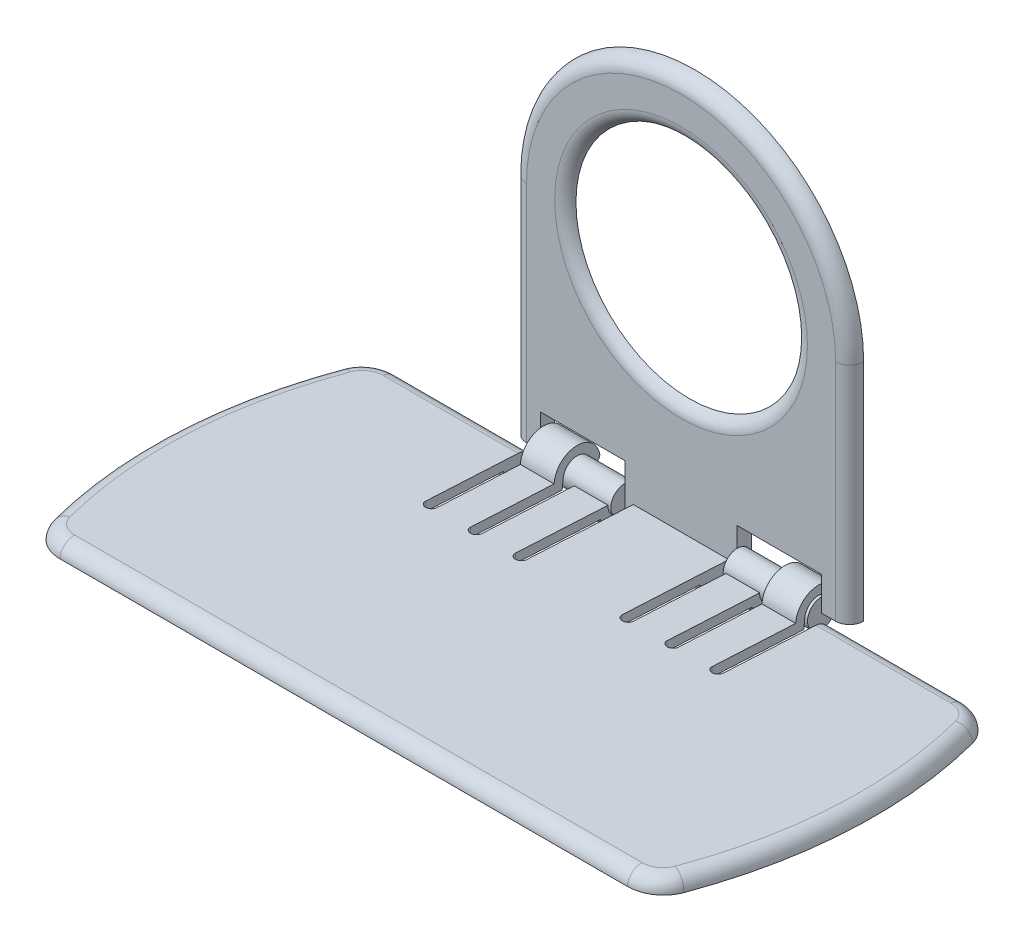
ISO-10303-21;
HEADER;
FILE_DESCRIPTION(('STEP AP214'),'2;1');
FILE_NAME('part.step','',(''),(''),'','','');
FILE_SCHEMA(('AUTOMOTIVE_DESIGN { 1 0 10303 214 1 1 1 1 }'));
ENDSEC;
DATA;
#1=APPLICATION_CONTEXT('core data for automotive mechanical design processes');
#2=APPLICATION_PROTOCOL_DEFINITION('international standard','automotive_design',2000,#1);
#3=PRODUCT_CONTEXT('',#1,'mechanical');
#4=PRODUCT('Part','Part','',(#3));
#5=PRODUCT_RELATED_PRODUCT_CATEGORY('part','',(#4));
#6=PRODUCT_DEFINITION_FORMATION('','',#4);
#7=PRODUCT_DEFINITION_CONTEXT('part definition',#1,'design');
#8=PRODUCT_DEFINITION('design','',#6,#7);
#9=PRODUCT_DEFINITION_SHAPE('','',#8);
#10=(LENGTH_UNIT() NAMED_UNIT(*) SI_UNIT(.MILLI.,.METRE.));
#11=(NAMED_UNIT(*) PLANE_ANGLE_UNIT() SI_UNIT($,.RADIAN.));
#12=(NAMED_UNIT(*) SI_UNIT($,.STERADIAN.) SOLID_ANGLE_UNIT());
#13=UNCERTAINTY_MEASURE_WITH_UNIT(LENGTH_MEASURE(1.E-05),#10,'distance_accuracy_value','');
#14=(GEOMETRIC_REPRESENTATION_CONTEXT(3) GLOBAL_UNCERTAINTY_ASSIGNED_CONTEXT((#13)) GLOBAL_UNIT_ASSIGNED_CONTEXT((#10,
#11,#12)) REPRESENTATION_CONTEXT('',''));
#15=CARTESIAN_POINT('',(0.,0.,0.));
#16=DIRECTION('',(0.,0.,1.));
#17=DIRECTION('',(1.,0.,0.));
#18=AXIS2_PLACEMENT_3D('',#15,#16,#17);
#19=CARTESIAN_POINT('',(0.,0.,-2.5));
#20=DIRECTION('',(0.,0.,-1.));
#21=DIRECTION('',(-1.,0.,0.));
#22=AXIS2_PLACEMENT_3D('',#19,#20,#21);
#23=PLANE('',#22);
#24=CARTESIAN_POINT('',(0.,0.,-2.5));
#25=DIRECTION('',(0.,0.,-1.));
#26=DIRECTION('',(-1.,0.,0.));
#27=AXIS2_PLACEMENT_3D('',#24,#25,#26);
#28=CIRCLE('',#27,25.);
#29=CARTESIAN_POINT('',(-25.,0.,-2.5));
#30=VERTEX_POINT('',#29);
#31=CARTESIAN_POINT('',(25.,0.,-2.5));
#32=VERTEX_POINT('',#31);
#33=EDGE_CURVE('P0_E30',#30,#32,#28,.T.);
#34=ORIENTED_EDGE('',*,*,#33,.F.);
#35=DIRECTION('',(0.,1.,0.));
#36=VECTOR('',#35,1.);
#37=CARTESIAN_POINT('',(-25.,-29.,-2.5));
#38=LINE('',#37,#36);
#39=CARTESIAN_POINT('',(-25.,-29.,-2.5));
#40=VERTEX_POINT('',#39);
#41=EDGE_CURVE('P0_E296',#40,#30,#38,.T.);
#42=ORIENTED_EDGE('',*,*,#41,.F.);
#43=DIRECTION('',(-1.,0.,0.));
#44=VECTOR('',#43,1.);
#45=CARTESIAN_POINT('',(-5.,-29.,-2.5));
#46=LINE('',#45,#44);
#47=CARTESIAN_POINT('',(-5.,-29.,-2.5));
#48=VERTEX_POINT('',#47);
#49=EDGE_CURVE('P0_E293',#48,#40,#46,.T.);
#50=ORIENTED_EDGE('',*,*,#49,.F.);
#51=DIRECTION('',(0.,1.,0.));
#52=VECTOR('',#51,1.);
#53=CARTESIAN_POINT('',(-5.,-36.25,-2.5));
#54=LINE('',#53,#52);
#55=CARTESIAN_POINT('',(-5.,-36.25,-2.5));
#56=VERTEX_POINT('',#55);
#57=EDGE_CURVE('P0_E290',#56,#48,#54,.T.);
#58=ORIENTED_EDGE('',*,*,#57,.F.);
#59=DIRECTION('',(-1.,0.,0.));
#60=VECTOR('',#59,1.);
#61=CARTESIAN_POINT('',(5.,-36.25,-2.5));
#62=LINE('',#61,#60);
#63=CARTESIAN_POINT('',(5.,-36.25,-2.5));
#64=VERTEX_POINT('',#63);
#65=EDGE_CURVE('P0_E287',#64,#56,#62,.T.);
#66=ORIENTED_EDGE('',*,*,#65,.F.);
#67=DIRECTION('',(0.,-1.,0.));
#68=VECTOR('',#67,1.);
#69=CARTESIAN_POINT('',(5.,-29.,-2.5));
#70=LINE('',#69,#68);
#71=CARTESIAN_POINT('',(5.,-29.,-2.5));
#72=VERTEX_POINT('',#71);
#73=EDGE_CURVE('P0_E284',#72,#64,#70,.T.);
#74=ORIENTED_EDGE('',*,*,#73,.F.);
#75=DIRECTION('',(-1.,0.,0.));
#76=VECTOR('',#75,1.);
#77=CARTESIAN_POINT('',(25.,-29.,-2.5));
#78=LINE('',#77,#76);
#79=CARTESIAN_POINT('',(25.,-29.,-2.5));
#80=VERTEX_POINT('',#79);
#81=EDGE_CURVE('P0_E281',#80,#72,#78,.T.);
#82=ORIENTED_EDGE('',*,*,#81,.F.);
#83=DIRECTION('',(0.,-1.,0.));
#84=VECTOR('',#83,1.);
#85=CARTESIAN_POINT('',(25.,0.,-2.5));
#86=LINE('',#85,#84);
#87=EDGE_CURVE('P0_E275',#32,#80,#86,.T.);
#88=ORIENTED_EDGE('',*,*,#87,.F.);
#89=EDGE_LOOP('',(#34,#42,#50,#58,#66,#74,#82,#88));
#90=FACE_BOUND('',#89,.T.);
#91=DIRECTION('',(0.,1.,0.));
#92=VECTOR('',#91,1.);
#93=CARTESIAN_POINT('',(10.,-34.,-2.5));
#94=LINE('',#93,#92);
#95=CARTESIAN_POINT('',(9.99999999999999,-40.,-2.5));
#96=VERTEX_POINT('',#95);
#97=CARTESIAN_POINT('',(10.,-34.,-2.5));
#98=VERTEX_POINT('',#97);
#99=EDGE_CURVE('P0_E176',#96,#98,#94,.T.);
#100=ORIENTED_EDGE('',*,*,#99,.F.);
#101=DIRECTION('',(1.,0.,0.));
#102=VECTOR('',#101,1.);
#103=CARTESIAN_POINT('',(-30.001,-40.,-2.5));
#104=LINE('',#103,#102);
#105=CARTESIAN_POINT('',(-10.,-40.,-2.5));
#106=VERTEX_POINT('',#105);
#107=EDGE_CURVE('P0_E38',#106,#96,#104,.T.);
#108=ORIENTED_EDGE('',*,*,#107,.F.);
#109=DIRECTION('',(0.,-1.,0.));
#110=VECTOR('',#109,1.);
#111=CARTESIAN_POINT('',(-10.,-34.,-2.5));
#112=LINE('',#111,#110);
#113=CARTESIAN_POINT('',(-10.,-34.,-2.5));
#114=VERTEX_POINT('',#113);
#115=EDGE_CURVE('P0_E185',#114,#106,#112,.T.);
#116=ORIENTED_EDGE('',*,*,#115,.F.);
#117=DIRECTION('',(1.,0.,0.));
#118=VECTOR('',#117,1.);
#119=CARTESIAN_POINT('',(-25.,-34.,-2.5));
#120=LINE('',#119,#118);
#121=CARTESIAN_POINT('',(-25.,-34.,-2.5));
#122=VERTEX_POINT('',#121);
#123=EDGE_CURVE('P0_E189',#122,#114,#120,.T.);
#124=ORIENTED_EDGE('',*,*,#123,.F.);
#125=DIRECTION('',(0.,1.,0.));
#126=VECTOR('',#125,1.);
#127=CARTESIAN_POINT('',(-25.,-34.,-2.5));
#128=LINE('',#127,#126);
#129=CARTESIAN_POINT('',(-25.,-40.,-2.5));
#130=VERTEX_POINT('',#129);
#131=EDGE_CURVE('P0_E353',#130,#122,#128,.T.);
#132=ORIENTED_EDGE('',*,*,#131,.F.);
#133=DIRECTION('',(1.,0.,0.));
#134=VECTOR('',#133,1.);
#135=CARTESIAN_POINT('',(-25.,-40.,-2.5));
#136=LINE('',#135,#134);
#137=CARTESIAN_POINT('',(-30.,-40.,-2.5));
#138=VERTEX_POINT('',#137);
#139=EDGE_CURVE('P0_E350',#138,#130,#136,.T.);
#140=ORIENTED_EDGE('',*,*,#139,.F.);
#141=DIRECTION('',(0.,-1.,0.));
#142=VECTOR('',#141,1.);
#143=CARTESIAN_POINT('',(-30.,0.,-2.5));
#144=LINE('',#143,#142);
#145=CARTESIAN_POINT('',(-30.,0.,-2.5));
#146=VERTEX_POINT('',#145);
#147=EDGE_CURVE('P0_E347',#146,#138,#144,.T.);
#148=ORIENTED_EDGE('',*,*,#147,.F.);
#149=CARTESIAN_POINT('',(0.,0.,-2.5));
#150=DIRECTION('',(0.,0.,1.));
#151=DIRECTION('',(-1.,0.,0.));
#152=AXIS2_PLACEMENT_3D('',#149,#150,#151);
#153=CIRCLE('',#152,30.);
#154=CARTESIAN_POINT('',(30.,0.,-2.5));
#155=VERTEX_POINT('',#154);
#156=EDGE_CURVE('P0_E226',#155,#146,#153,.T.);
#157=ORIENTED_EDGE('',*,*,#156,.F.);
#158=DIRECTION('',(0.,1.,0.));
#159=VECTOR('',#158,1.);
#160=CARTESIAN_POINT('',(30.,0.,-2.5));
#161=LINE('',#160,#159);
#162=CARTESIAN_POINT('',(30.,-40.,-2.5));
#163=VERTEX_POINT('',#162);
#164=EDGE_CURVE('P0_E197',#163,#155,#161,.T.);
#165=ORIENTED_EDGE('',*,*,#164,.F.);
#166=DIRECTION('',(1.,0.,0.));
#167=VECTOR('',#166,1.);
#168=CARTESIAN_POINT('',(25.,-40.,-2.5));
#169=LINE('',#168,#167);
#170=CARTESIAN_POINT('',(25.,-40.,-2.5));
#171=VERTEX_POINT('',#170);
#172=EDGE_CURVE('P0_E195',#171,#163,#169,.T.);
#173=ORIENTED_EDGE('',*,*,#172,.F.);
#174=DIRECTION('',(0.,-1.,0.));
#175=VECTOR('',#174,1.);
#176=CARTESIAN_POINT('',(25.,-34.,-2.5));
#177=LINE('',#176,#175);
#178=CARTESIAN_POINT('',(25.,-34.,-2.5));
#179=VERTEX_POINT('',#178);
#180=EDGE_CURVE('P0_E187',#179,#171,#177,.T.);
#181=ORIENTED_EDGE('',*,*,#180,.F.);
#182=DIRECTION('',(1.,0.,0.));
#183=VECTOR('',#182,1.);
#184=CARTESIAN_POINT('',(25.,-34.,-2.5));
#185=LINE('',#184,#183);
#186=EDGE_CURVE('P0_E184',#98,#179,#185,.T.);
#187=ORIENTED_EDGE('',*,*,#186,.F.);
#188=EDGE_LOOP('',(#100,#108,#116,#124,#132,#140,#148,#157,#165,#173,#181,#187));
#189=FACE_BOUND('',#188,.T.);
#190=ADVANCED_FACE('P0_F15',(#90,#189),#23,.T.);
#191=CARTESIAN_POINT('',(32.0710678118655,-40.,0.));
#192=DIRECTION('',(-1.,0.,0.));
#193=DIRECTION('',(0.,0.,1.));
#194=AXIS2_PLACEMENT_3D('',#191,#192,#193);
#195=CYLINDRICAL_SURFACE('',#194,2.5);
#196=CARTESIAN_POINT('',(25.,-40.,0.));
#197=DIRECTION('',(-1.,0.,0.));
#198=DIRECTION('',(0.,0.,1.));
#199=AXIS2_PLACEMENT_3D('',#196,#197,#198);
#200=CIRCLE('',#199,2.5);
#201=CARTESIAN_POINT('',(25.,-37.5,0.));
#202=VERTEX_POINT('',#201);
#203=EDGE_CURVE('P0_E341',#202,#171,#200,.T.);
#204=ORIENTED_EDGE('',*,*,#203,.T.);
#205=EDGE_CURVE('P0_E340',#171,#202,#200,.T.);
#206=ORIENTED_EDGE('',*,*,#205,.T.);
#207=EDGE_LOOP('',(#204,#206));
#208=FACE_BOUND('',#207,.T.);
#209=CARTESIAN_POINT('',(-25.,-40.,0.));
#210=DIRECTION('',(1.,0.,0.));
#211=DIRECTION('',(0.,0.,-1.));
#212=AXIS2_PLACEMENT_3D('',#209,#210,#211);
#213=CIRCLE('',#212,2.5);
#214=CARTESIAN_POINT('',(-25.,-37.5,0.));
#215=VERTEX_POINT('',#214);
#216=EDGE_CURVE('P0_E338',#130,#215,#213,.F.);
#217=ORIENTED_EDGE('',*,*,#216,.F.);
#218=EDGE_CURVE('P0_E259',#215,#130,#213,.F.);
#219=ORIENTED_EDGE('',*,*,#218,.F.);
#220=EDGE_LOOP('',(#217,#219));
#221=FACE_BOUND('',#220,.T.);
#222=CARTESIAN_POINT('',(10.,-40.,0.));
#223=DIRECTION('',(1.,0.,0.));
#224=DIRECTION('',(0.,0.,-1.));
#225=AXIS2_PLACEMENT_3D('',#222,#223,#224);
#226=CIRCLE('',#225,2.5);
#227=CARTESIAN_POINT('',(10.,-37.5,0.));
#228=VERTEX_POINT('',#227);
#229=EDGE_CURVE('P0_E167',#228,#96,#226,.F.);
#230=ORIENTED_EDGE('',*,*,#229,.F.);
#231=CARTESIAN_POINT('',(10.,-40.,0.));
#232=DIRECTION('',(-1.,0.,0.));
#233=DIRECTION('',(0.,-1.,0.));
#234=AXIS2_PLACEMENT_3D('',#231,#232,#233);
#235=CIRCLE('',#234,2.5);
#236=CARTESIAN_POINT('',(10.,-42.5,0.));
#237=VERTEX_POINT('',#236);
#238=EDGE_CURVE('P0_E10',#237,#228,#235,.T.);
#239=ORIENTED_EDGE('',*,*,#238,.F.);
#240=DIRECTION('',(1.,0.,0.));
#241=VECTOR('',#240,1.);
#242=CARTESIAN_POINT('',(10.,-42.5,0.));
#243=LINE('',#242,#241);
#244=CARTESIAN_POINT('',(-10.,-42.5,0.));
#245=VERTEX_POINT('',#244);
#246=EDGE_CURVE('P0_E270',#245,#237,#243,.T.);
#247=ORIENTED_EDGE('',*,*,#246,.F.);
#248=CARTESIAN_POINT('',(-10.,-40.,0.));
#249=DIRECTION('',(1.,0.,0.));
#250=DIRECTION('',(0.,0.,-1.));
#251=AXIS2_PLACEMENT_3D('',#248,#249,#250);
#252=CIRCLE('',#251,2.5);
#253=CARTESIAN_POINT('',(-10.,-37.5,0.));
#254=VERTEX_POINT('',#253);
#255=EDGE_CURVE('P0_E23',#254,#245,#252,.T.);
#256=ORIENTED_EDGE('',*,*,#255,.F.);
#257=CARTESIAN_POINT('',(-10.,-40.,0.));
#258=DIRECTION('',(-1.,0.,0.));
#259=DIRECTION('',(0.,0.,1.));
#260=AXIS2_PLACEMENT_3D('',#257,#258,#259);
#261=CIRCLE('',#260,2.5);
#262=EDGE_CURVE('P0_E169',#106,#254,#261,.F.);
#263=ORIENTED_EDGE('',*,*,#262,.F.);
#264=ORIENTED_EDGE('',*,*,#107,.T.);
#265=EDGE_LOOP('',(#230,#239,#247,#256,#263,#264));
#266=FACE_BOUND('',#265,.T.);
#267=ADVANCED_FACE('P0_F165',(#208,#221,#266),#195,.T.);
#268=CARTESIAN_POINT('',(0.,0.,-2.5));
#269=DIRECTION('',(0.,0.,-1.));
#270=DIRECTION('',(-1.,0.,0.));
#271=AXIS2_PLACEMENT_3D('',#268,#269,#270);
#272=TOROIDAL_SURFACE('',#271,22.5,2.5);
#273=CARTESIAN_POINT('',(0.,0.,0.));
#274=DIRECTION('',(0.,0.,-1.));
#275=DIRECTION('',(-1.,0.,0.));
#276=AXIS2_PLACEMENT_3D('',#273,#274,#275);
#277=CIRCLE('',#276,22.5);
#278=CARTESIAN_POINT('',(-22.5,0.,0.));
#279=VERTEX_POINT('',#278);
#280=EDGE_CURVE('P0_E247',#279,#279,#277,.T.);
#281=ORIENTED_EDGE('',*,*,#280,.F.);
#282=EDGE_LOOP('',(#281));
#283=FACE_BOUND('',#282,.T.);
#284=CARTESIAN_POINT('',(0.,0.,-1.5));
#285=DIRECTION('',(0.,0.,1.));
#286=DIRECTION('',(1.,0.,0.));
#287=AXIS2_PLACEMENT_3D('',#284,#285,#286);
#288=CIRCLE('',#287,20.2087121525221);
#289=CARTESIAN_POINT('',(20.2087121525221,0.,-1.5));
#290=VERTEX_POINT('',#289);
#291=EDGE_CURVE('P0_E257',#290,#290,#288,.F.);
#292=ORIENTED_EDGE('',*,*,#291,.T.);
#293=EDGE_LOOP('',(#292));
#294=FACE_BOUND('',#293,.T.);
#295=ADVANCED_FACE('P0_F17',(#283,#294),#272,.T.);
#296=CARTESIAN_POINT('',(25.,-34.,-2.5));
#297=DIRECTION('',(-1.,0.,0.));
#298=DIRECTION('',(0.,0.,1.));
#299=AXIS2_PLACEMENT_3D('',#296,#297,#298);
#300=PLANE('',#299);
#301=ORIENTED_EDGE('',*,*,#180,.T.);
#302=ORIENTED_EDGE('',*,*,#203,.F.);
#303=DIRECTION('',(0.,-1.,0.));
#304=VECTOR('',#303,1.);
#305=CARTESIAN_POINT('',(25.,-34.,0.));
#306=LINE('',#305,#304);
#307=CARTESIAN_POINT('',(25.,-34.,0.));
#308=VERTEX_POINT('',#307);
#309=EDGE_CURVE('P0_E220',#308,#202,#306,.T.);
#310=ORIENTED_EDGE('',*,*,#309,.F.);
#311=DIRECTION('',(0.,0.,1.));
#312=VECTOR('',#311,1.);
#313=CARTESIAN_POINT('',(25.,-34.,-2.5));
#314=LINE('',#313,#312);
#315=EDGE_CURVE('P0_E230',#179,#308,#314,.T.);
#316=ORIENTED_EDGE('',*,*,#315,.F.);
#317=EDGE_LOOP('',(#301,#302,#310,#316));
#318=FACE_BOUND('',#317,.T.);
#319=ADVANCED_FACE('P0_F401',(#318),#300,.T.);
#320=CARTESIAN_POINT('',(10.,-34.,-2.5));
#321=DIRECTION('',(1.,0.,0.));
#322=DIRECTION('',(0.,0.,-1.));
#323=AXIS2_PLACEMENT_3D('',#320,#321,#322);
#324=PLANE('',#323);
#325=DIRECTION('',(0.,1.,0.));
#326=VECTOR('',#325,1.);
#327=CARTESIAN_POINT('',(10.,-34.,0.));
#328=LINE('',#327,#326);
#329=CARTESIAN_POINT('',(10.,-34.,0.));
#330=VERTEX_POINT('',#329);
#331=EDGE_CURVE('P0_E178',#228,#330,#328,.T.);
#332=ORIENTED_EDGE('',*,*,#331,.F.);
#333=ORIENTED_EDGE('',*,*,#229,.T.);
#334=ORIENTED_EDGE('',*,*,#99,.T.);
#335=DIRECTION('',(0.,0.,1.));
#336=VECTOR('',#335,1.);
#337=CARTESIAN_POINT('',(10.,-34.,-2.5));
#338=LINE('',#337,#336);
#339=EDGE_CURVE('P0_E232',#98,#330,#338,.T.);
#340=ORIENTED_EDGE('',*,*,#339,.T.);
#341=EDGE_LOOP('',(#332,#333,#334,#340));
#342=FACE_BOUND('',#341,.T.);
#343=ADVANCED_FACE('P0_F174',(#342),#324,.T.);
#344=CARTESIAN_POINT('',(-10.,-34.,-2.5));
#345=DIRECTION('',(-1.,0.,0.));
#346=DIRECTION('',(0.,0.,1.));
#347=AXIS2_PLACEMENT_3D('',#344,#345,#346);
#348=PLANE('',#347);
#349=ORIENTED_EDGE('',*,*,#115,.T.);
#350=ORIENTED_EDGE('',*,*,#262,.T.);
#351=DIRECTION('',(0.,-1.,0.));
#352=VECTOR('',#351,1.);
#353=CARTESIAN_POINT('',(-10.,-34.,0.));
#354=LINE('',#353,#352);
#355=CARTESIAN_POINT('',(-10.,-34.,0.));
#356=VERTEX_POINT('',#355);
#357=EDGE_CURVE('P0_E212',#356,#254,#354,.T.);
#358=ORIENTED_EDGE('',*,*,#357,.F.);
#359=DIRECTION('',(0.,0.,1.));
#360=VECTOR('',#359,1.);
#361=CARTESIAN_POINT('',(-10.,-34.,-2.5));
#362=LINE('',#361,#360);
#363=EDGE_CURVE('P0_E234',#114,#356,#362,.T.);
#364=ORIENTED_EDGE('',*,*,#363,.F.);
#365=EDGE_LOOP('',(#349,#350,#358,#364));
#366=FACE_BOUND('',#365,.T.);
#367=ADVANCED_FACE('P0_F439',(#366),#348,.T.);
#368=CARTESIAN_POINT('',(-25.,-34.,-2.5));
#369=DIRECTION('',(1.,0.,0.));
#370=DIRECTION('',(0.,0.,-1.));
#371=AXIS2_PLACEMENT_3D('',#368,#369,#370);
#372=PLANE('',#371);
#373=DIRECTION('',(0.,1.,0.));
#374=VECTOR('',#373,1.);
#375=CARTESIAN_POINT('',(-25.,-34.,0.));
#376=LINE('',#375,#374);
#377=CARTESIAN_POINT('',(-25.,-34.,0.));
#378=VERTEX_POINT('',#377);
#379=EDGE_CURVE('P0_E204',#215,#378,#376,.T.);
#380=ORIENTED_EDGE('',*,*,#379,.F.);
#381=ORIENTED_EDGE('',*,*,#218,.T.);
#382=ORIENTED_EDGE('',*,*,#131,.T.);
#383=DIRECTION('',(0.,0.,1.));
#384=VECTOR('',#383,1.);
#385=CARTESIAN_POINT('',(-25.,-34.,-2.5));
#386=LINE('',#385,#384);
#387=EDGE_CURVE('P0_E236',#122,#378,#386,.T.);
#388=ORIENTED_EDGE('',*,*,#387,.T.);
#389=EDGE_LOOP('',(#380,#381,#382,#388));
#390=FACE_BOUND('',#389,.T.);
#391=ADVANCED_FACE('P0_F365',(#390),#372,.T.);
#392=CARTESIAN_POINT('',(0.,0.,0.));
#393=DIRECTION('',(0.,0.,-1.));
#394=DIRECTION('',(-1.,0.,0.));
#395=AXIS2_PLACEMENT_3D('',#392,#393,#394);
#396=PLANE('',#395);
#397=ORIENTED_EDGE('',*,*,#280,.T.);
#398=EDGE_LOOP('',(#397));
#399=FACE_BOUND('',#398,.T.);
#400=ORIENTED_EDGE('',*,*,#357,.T.);
#401=DIRECTION('',(0.,-1.,0.));
#402=VECTOR('',#401,1.);
#403=CARTESIAN_POINT('',(-10.,-37.5,0.));
#404=LINE('',#403,#402);
#405=EDGE_CURVE('P0_E265',#254,#245,#404,.T.);
#406=ORIENTED_EDGE('',*,*,#405,.T.);
#407=ORIENTED_EDGE('',*,*,#246,.T.);
#408=DIRECTION('',(0.,1.,0.));
#409=VECTOR('',#408,1.);
#410=CARTESIAN_POINT('',(10.,-37.5,0.));
#411=LINE('',#410,#409);
#412=EDGE_CURVE('P0_E170',#237,#228,#411,.T.);
#413=ORIENTED_EDGE('',*,*,#412,.T.);
#414=ORIENTED_EDGE('',*,*,#331,.T.);
#415=DIRECTION('',(1.,0.,0.));
#416=VECTOR('',#415,1.);
#417=CARTESIAN_POINT('',(25.,-34.,0.));
#418=LINE('',#417,#416);
#419=EDGE_CURVE('P0_E216',#330,#308,#418,.T.);
#420=ORIENTED_EDGE('',*,*,#419,.T.);
#421=ORIENTED_EDGE('',*,*,#309,.T.);
#422=CARTESIAN_POINT('',(25.,-40.,0.));
#423=VERTEX_POINT('',#422);
#424=EDGE_CURVE('P0_E219',#202,#423,#306,.T.);
#425=ORIENTED_EDGE('',*,*,#424,.T.);
#426=DIRECTION('',(1.,0.,0.));
#427=VECTOR('',#426,1.);
#428=CARTESIAN_POINT('',(25.,-40.,0.));
#429=LINE('',#428,#427);
#430=CARTESIAN_POINT('',(27.5,-40.,0.));
#431=VERTEX_POINT('',#430);
#432=EDGE_CURVE('P0_E223',#423,#431,#429,.T.);
#433=ORIENTED_EDGE('',*,*,#432,.T.);
#434=DIRECTION('',(0.,1.,0.));
#435=VECTOR('',#434,1.);
#436=CARTESIAN_POINT('',(27.5,0.,0.));
#437=LINE('',#436,#435);
#438=CARTESIAN_POINT('',(27.5,0.,0.));
#439=VERTEX_POINT('',#438);
#440=EDGE_CURVE('P0_E244',#431,#439,#437,.T.);
#441=ORIENTED_EDGE('',*,*,#440,.T.);
#442=CARTESIAN_POINT('',(0.,0.,0.));
#443=DIRECTION('',(0.,0.,-1.));
#444=DIRECTION('',(-1.,0.,0.));
#445=AXIS2_PLACEMENT_3D('',#442,#443,#444);
#446=CIRCLE('',#445,27.5);
#447=CARTESIAN_POINT('',(-27.5,0.,0.));
#448=VERTEX_POINT('',#447);
#449=EDGE_CURVE('P0_E242',#439,#448,#446,.F.);
#450=ORIENTED_EDGE('',*,*,#449,.T.);
#451=DIRECTION('',(0.,-1.,0.));
#452=VECTOR('',#451,1.);
#453=CARTESIAN_POINT('',(-27.5,-40.,0.));
#454=LINE('',#453,#452);
#455=CARTESIAN_POINT('',(-27.5,-40.,0.));
#456=VERTEX_POINT('',#455);
#457=EDGE_CURVE('P0_E229',#448,#456,#454,.T.);
#458=ORIENTED_EDGE('',*,*,#457,.T.);
#459=DIRECTION('',(1.,0.,0.));
#460=VECTOR('',#459,1.);
#461=CARTESIAN_POINT('',(-25.,-40.,0.));
#462=LINE('',#461,#460);
#463=CARTESIAN_POINT('',(-25.,-40.,0.));
#464=VERTEX_POINT('',#463);
#465=EDGE_CURVE('P0_E201',#456,#464,#462,.T.);
#466=ORIENTED_EDGE('',*,*,#465,.T.);
#467=EDGE_CURVE('P0_E206',#464,#215,#376,.T.);
#468=ORIENTED_EDGE('',*,*,#467,.T.);
#469=ORIENTED_EDGE('',*,*,#379,.T.);
#470=DIRECTION('',(1.,0.,0.));
#471=VECTOR('',#470,1.);
#472=CARTESIAN_POINT('',(-25.,-34.,0.));
#473=LINE('',#472,#471);
#474=EDGE_CURVE('P0_E209',#378,#356,#473,.T.);
#475=ORIENTED_EDGE('',*,*,#474,.T.);
#476=EDGE_LOOP('',(#400,#406,#407,#413,#414,#420,#421,#425,#433,#441,#450,#458,#466,#468,#469,#475));
#477=FACE_BOUND('',#476,.T.);
#478=ADVANCED_FACE('P0_F268',(#399,#477),#396,.F.);
#479=CARTESIAN_POINT('',(25.,-40.,-2.5));
#480=DIRECTION('',(0.,-1.,0.));
#481=DIRECTION('',(0.,0.,-1.));
#482=AXIS2_PLACEMENT_3D('',#479,#480,#481);
#483=PLANE('',#482);
#484=ORIENTED_EDGE('',*,*,#172,.T.);
#485=CARTESIAN_POINT('',(27.5,-40.,-2.5));
#486=DIRECTION('',(0.,-1.,0.));
#487=DIRECTION('',(0.,0.,-1.));
#488=AXIS2_PLACEMENT_3D('',#485,#486,#487);
#489=CIRCLE('',#488,2.5);
#490=EDGE_CURVE('P0_E250',#163,#431,#489,.T.);
#491=ORIENTED_EDGE('',*,*,#490,.T.);
#492=ORIENTED_EDGE('',*,*,#432,.F.);
#493=DIRECTION('',(0.,0.,1.));
#494=VECTOR('',#493,1.);
#495=CARTESIAN_POINT('',(25.,-40.,-2.5));
#496=LINE('',#495,#494);
#497=EDGE_CURVE('P0_E227',#171,#423,#496,.T.);
#498=ORIENTED_EDGE('',*,*,#497,.F.);
#499=EDGE_LOOP('',(#484,#491,#492,#498));
#500=FACE_BOUND('',#499,.T.);
#501=ADVANCED_FACE('P0_F391',(#500),#483,.T.);
#502=CARTESIAN_POINT('',(25.,-34.,-2.5));
#503=DIRECTION('',(0.,-1.,0.));
#504=DIRECTION('',(0.,0.,-1.));
#505=AXIS2_PLACEMENT_3D('',#502,#503,#504);
#506=PLANE('',#505);
#507=ORIENTED_EDGE('',*,*,#419,.F.);
#508=ORIENTED_EDGE('',*,*,#339,.F.);
#509=ORIENTED_EDGE('',*,*,#186,.T.);
#510=ORIENTED_EDGE('',*,*,#315,.T.);
#511=EDGE_LOOP('',(#507,#508,#509,#510));
#512=FACE_BOUND('',#511,.T.);
#513=ADVANCED_FACE('P0_F404',(#512),#506,.T.);
#514=CARTESIAN_POINT('',(-25.,-34.,-2.5));
#515=DIRECTION('',(0.,-1.,0.));
#516=DIRECTION('',(0.,0.,-1.));
#517=AXIS2_PLACEMENT_3D('',#514,#515,#516);
#518=PLANE('',#517);
#519=ORIENTED_EDGE('',*,*,#474,.F.);
#520=ORIENTED_EDGE('',*,*,#387,.F.);
#521=ORIENTED_EDGE('',*,*,#123,.T.);
#522=ORIENTED_EDGE('',*,*,#363,.T.);
#523=EDGE_LOOP('',(#519,#520,#521,#522));
#524=FACE_BOUND('',#523,.T.);
#525=ADVANCED_FACE('P0_F359',(#524),#518,.T.);
#526=CARTESIAN_POINT('',(-25.,-40.,-2.5));
#527=DIRECTION('',(0.,-1.,0.));
#528=DIRECTION('',(0.,0.,-1.));
#529=AXIS2_PLACEMENT_3D('',#526,#527,#528);
#530=PLANE('',#529);
#531=ORIENTED_EDGE('',*,*,#465,.F.);
#532=CARTESIAN_POINT('',(-27.5,-40.,-2.5));
#533=DIRECTION('',(0.,-1.,0.));
#534=DIRECTION('',(0.,0.,-1.));
#535=AXIS2_PLACEMENT_3D('',#532,#533,#534);
#536=CIRCLE('',#535,2.5);
#537=EDGE_CURVE('P0_E252',#456,#138,#536,.T.);
#538=ORIENTED_EDGE('',*,*,#537,.T.);
#539=ORIENTED_EDGE('',*,*,#139,.T.);
#540=DIRECTION('',(0.,0.,1.));
#541=VECTOR('',#540,1.);
#542=CARTESIAN_POINT('',(-25.,-40.,-2.5));
#543=LINE('',#542,#541);
#544=EDGE_CURVE('P0_E200',#130,#464,#543,.T.);
#545=ORIENTED_EDGE('',*,*,#544,.T.);
#546=EDGE_LOOP('',(#531,#538,#539,#545));
#547=FACE_BOUND('',#546,.T.);
#548=ADVANCED_FACE('P0_F373',(#547),#530,.T.);
#549=CARTESIAN_POINT('',(-27.5,0.,-2.5));
#550=DIRECTION('',(0.,1.,0.));
#551=DIRECTION('',(-1.,0.,0.));
#552=AXIS2_PLACEMENT_3D('',#549,#550,#551);
#553=CYLINDRICAL_SURFACE('',#552,2.5);
#554=ORIENTED_EDGE('',*,*,#537,.F.);
#555=ORIENTED_EDGE('',*,*,#457,.F.);
#556=CARTESIAN_POINT('',(-27.5,0.,-2.5));
#557=DIRECTION('',(0.,1.,0.));
#558=DIRECTION('',(-1.,0.,0.));
#559=AXIS2_PLACEMENT_3D('',#556,#557,#558);
#560=CIRCLE('',#559,2.5);
#561=EDGE_CURVE('P0_E205',#146,#448,#560,.T.);
#562=ORIENTED_EDGE('',*,*,#561,.F.);
#563=ORIENTED_EDGE('',*,*,#147,.T.);
#564=EDGE_LOOP('',(#554,#555,#562,#563));
#565=FACE_BOUND('',#564,.T.);
#566=ADVANCED_FACE('P0_F377',(#565),#553,.T.);
#567=CARTESIAN_POINT('',(0.,0.,-2.5));
#568=DIRECTION('',(0.,0.,-1.));
#569=DIRECTION('',(-1.,0.,0.));
#570=AXIS2_PLACEMENT_3D('',#567,#568,#569);
#571=TOROIDAL_SURFACE('',#570,27.5,2.5);
#572=ORIENTED_EDGE('',*,*,#561,.T.);
#573=ORIENTED_EDGE('',*,*,#449,.F.);
#574=CARTESIAN_POINT('',(27.5,0.,-2.5));
#575=DIRECTION('',(0.,-1.,0.));
#576=DIRECTION('',(0.,0.,-1.));
#577=AXIS2_PLACEMENT_3D('',#574,#575,#576);
#578=CIRCLE('',#577,2.5);
#579=EDGE_CURVE('P0_E179',#155,#439,#578,.T.);
#580=ORIENTED_EDGE('',*,*,#579,.F.);
#581=ORIENTED_EDGE('',*,*,#156,.T.);
#582=EDGE_LOOP('',(#572,#573,#580,#581));
#583=FACE_BOUND('',#582,.T.);
#584=ADVANCED_FACE('P0_F382',(#583),#571,.T.);
#585=CARTESIAN_POINT('',(27.5,0.,-2.5));
#586=DIRECTION('',(0.,-1.,0.));
#587=DIRECTION('',(1.,0.,0.));
#588=AXIS2_PLACEMENT_3D('',#585,#586,#587);
#589=CYLINDRICAL_SURFACE('',#588,2.5);
#590=ORIENTED_EDGE('',*,*,#490,.F.);
#591=ORIENTED_EDGE('',*,*,#164,.T.);
#592=ORIENTED_EDGE('',*,*,#579,.T.);
#593=ORIENTED_EDGE('',*,*,#440,.F.);
#594=EDGE_LOOP('',(#590,#591,#592,#593));
#595=FACE_BOUND('',#594,.T.);
#596=ADVANCED_FACE('P0_F387',(#595),#589,.T.);
#597=CARTESIAN_POINT('',(25.,-34.,-2.5));
#598=DIRECTION('',(-1.,0.,0.));
#599=DIRECTION('',(0.,0.,1.));
#600=AXIS2_PLACEMENT_3D('',#597,#598,#599);
#601=PLANE('',#600);
#602=ORIENTED_EDGE('',*,*,#497,.T.);
#603=ORIENTED_EDGE('',*,*,#424,.F.);
#604=ORIENTED_EDGE('',*,*,#205,.F.);
#605=EDGE_LOOP('',(#602,#603,#604));
#606=FACE_BOUND('',#605,.T.);
#607=ADVANCED_FACE('P0_F397',(#606),#601,.F.);
#608=CARTESIAN_POINT('',(-25.,-34.,-2.5));
#609=DIRECTION('',(1.,0.,0.));
#610=DIRECTION('',(0.,0.,-1.));
#611=AXIS2_PLACEMENT_3D('',#608,#609,#610);
#612=PLANE('',#611);
#613=ORIENTED_EDGE('',*,*,#544,.F.);
#614=ORIENTED_EDGE('',*,*,#216,.T.);
#615=ORIENTED_EDGE('',*,*,#467,.F.);
#616=EDGE_LOOP('',(#613,#614,#615));
#617=FACE_BOUND('',#616,.T.);
#618=ADVANCED_FACE('P0_F370',(#617),#612,.F.);
#619=CARTESIAN_POINT('',(0.,0.,-2.5));
#620=DIRECTION('',(0.,0.,-1.));
#621=DIRECTION('',(-1.,0.,0.));
#622=AXIS2_PLACEMENT_3D('',#619,#620,#621);
#623=CONICAL_SURFACE('',#622,25.,0.05235987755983);
#624=ORIENTED_EDGE('',*,*,#33,.T.);
#625=DIRECTION('',(0.0523359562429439,0.,-0.998629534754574));
#626=VECTOR('',#625,1.);
#627=CARTESIAN_POINT('',(25.,0.,-2.5));
#628=LINE('',#627,#626);
#629=CARTESIAN_POINT('',(24.947592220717,0.,-1.5));
#630=VERTEX_POINT('',#629);
#631=EDGE_CURVE('P0_E302',#630,#32,#628,.T.);
#632=ORIENTED_EDGE('',*,*,#631,.F.);
#633=CARTESIAN_POINT('',(0.,0.,-1.5));
#634=DIRECTION('',(0.,0.,-1.));
#635=DIRECTION('',(-1.,0.,0.));
#636=AXIS2_PLACEMENT_3D('',#633,#634,#635);
#637=CIRCLE('',#636,24.947592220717);
#638=CARTESIAN_POINT('',(-24.947592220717,0.,-1.5));
#639=VERTEX_POINT('',#638);
#640=EDGE_CURVE('P0_E299',#639,#630,#637,.T.);
#641=ORIENTED_EDGE('',*,*,#640,.F.);
#642=DIRECTION('',(-0.0523359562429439,0.,-0.998629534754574));
#643=VECTOR('',#642,1.);
#644=CARTESIAN_POINT('',(-25.,0.,-2.5));
#645=LINE('',#644,#643);
#646=EDGE_CURVE('P0_E260',#639,#30,#645,.T.);
#647=ORIENTED_EDGE('',*,*,#646,.T.);
#648=EDGE_LOOP('',(#624,#632,#641,#647));
#649=FACE_BOUND('',#648,.T.);
#650=ADVANCED_FACE('P0_F482',(#649),#623,.F.);
#651=CARTESIAN_POINT('',(-25.,-29.,-2.5));
#652=DIRECTION('',(-0.998629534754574,0.,0.0523359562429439));
#653=DIRECTION('',(0.052335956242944,0.,0.998629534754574));
#654=AXIS2_PLACEMENT_3D('',#651,#652,#653);
#655=PLANE('',#654);
#656=ORIENTED_EDGE('',*,*,#41,.T.);
#657=ORIENTED_EDGE('',*,*,#646,.F.);
#658=DIRECTION('',(0.,1.,0.));
#659=VECTOR('',#658,1.);
#660=CARTESIAN_POINT('',(-24.947592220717,0.,-1.5));
#661=LINE('',#660,#659);
#662=CARTESIAN_POINT('',(-24.947592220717,-28.947592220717,-1.5));
#663=VERTEX_POINT('',#662);
#664=EDGE_CURVE('P0_E305',#663,#639,#661,.T.);
#665=ORIENTED_EDGE('',*,*,#664,.F.);
#666=DIRECTION('',(-0.052264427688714,-0.052264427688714,-0.997264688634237));
#667=VECTOR('',#666,1.);
#668=CARTESIAN_POINT('',(-24.9453685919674,-28.9453685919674,-1.45757063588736));
#669=LINE('',#668,#667);
#670=EDGE_CURVE('P0_E301',#663,#40,#669,.T.);
#671=ORIENTED_EDGE('',*,*,#670,.T.);
#672=EDGE_LOOP('',(#656,#657,#665,#671));
#673=FACE_BOUND('',#672,.T.);
#674=ADVANCED_FACE('P0_F490',(#673),#655,.F.);
#675=CARTESIAN_POINT('',(-5.,-29.,-2.5));
#676=DIRECTION('',(0.,-0.998629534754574,0.0523359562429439));
#677=DIRECTION('',(0.,-0.052335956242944,-0.998629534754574));
#678=AXIS2_PLACEMENT_3D('',#675,#676,#677);
#679=PLANE('',#678);
#680=ORIENTED_EDGE('',*,*,#49,.T.);
#681=ORIENTED_EDGE('',*,*,#670,.F.);
#682=DIRECTION('',(-1.,0.,0.));
#683=VECTOR('',#682,1.);
#684=CARTESIAN_POINT('',(0.,-28.947592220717,-1.5));
#685=LINE('',#684,#683);
#686=CARTESIAN_POINT('',(-4.94759222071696,-28.947592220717,-1.5));
#687=VERTEX_POINT('',#686);
#688=EDGE_CURVE('P0_E321',#687,#663,#685,.T.);
#689=ORIENTED_EDGE('',*,*,#688,.F.);
#690=DIRECTION('',(-0.052264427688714,-0.052264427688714,-0.997264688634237));
#691=VECTOR('',#690,1.);
#692=CARTESIAN_POINT('',(-5.,-29.,-2.5));
#693=LINE('',#692,#691);
#694=EDGE_CURVE('P0_E313',#687,#48,#693,.T.);
#695=ORIENTED_EDGE('',*,*,#694,.T.);
#696=EDGE_LOOP('',(#680,#681,#689,#695));
#697=FACE_BOUND('',#696,.T.);
#698=ADVANCED_FACE('P0_F498',(#697),#679,.F.);
#699=CARTESIAN_POINT('',(-5.,-36.25,-2.5));
#700=DIRECTION('',(-0.998629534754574,0.,0.0523359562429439));
#701=DIRECTION('',(0.052335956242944,0.,0.998629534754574));
#702=AXIS2_PLACEMENT_3D('',#699,#700,#701);
#703=PLANE('',#702);
#704=ORIENTED_EDGE('',*,*,#57,.T.);
#705=ORIENTED_EDGE('',*,*,#694,.F.);
#706=DIRECTION('',(0.,1.,0.));
#707=VECTOR('',#706,1.);
#708=CARTESIAN_POINT('',(-4.94759222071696,0.,-1.5));
#709=LINE('',#708,#707);
#710=CARTESIAN_POINT('',(-4.94759222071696,-36.197592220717,-1.5));
#711=VERTEX_POINT('',#710);
#712=EDGE_CURVE('P0_E324',#711,#687,#709,.T.);
#713=ORIENTED_EDGE('',*,*,#712,.F.);
#714=DIRECTION('',(-0.052264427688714,-0.052264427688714,-0.997264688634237));
#715=VECTOR('',#714,1.);
#716=CARTESIAN_POINT('',(-4.97268429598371,-36.2226842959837,-1.97878531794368));
#717=LINE('',#716,#715);
#718=EDGE_CURVE('P0_E311',#711,#56,#717,.T.);
#719=ORIENTED_EDGE('',*,*,#718,.T.);
#720=EDGE_LOOP('',(#704,#705,#713,#719));
#721=FACE_BOUND('',#720,.T.);
#722=ADVANCED_FACE('P0_F507',(#721),#703,.F.);
#723=CARTESIAN_POINT('',(5.,-36.25,-2.5));
#724=DIRECTION('',(0.,-0.998629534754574,0.0523359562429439));
#725=DIRECTION('',(0.,-0.052335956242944,-0.998629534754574));
#726=AXIS2_PLACEMENT_3D('',#723,#724,#725);
#727=PLANE('',#726);
#728=ORIENTED_EDGE('',*,*,#65,.T.);
#729=ORIENTED_EDGE('',*,*,#718,.F.);
#730=DIRECTION('',(-1.,0.,0.));
#731=VECTOR('',#730,1.);
#732=CARTESIAN_POINT('',(0.,-36.1975922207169,-1.5));
#733=LINE('',#732,#731);
#734=CARTESIAN_POINT('',(4.94759222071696,-36.197592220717,-1.5));
#735=VERTEX_POINT('',#734);
#736=EDGE_CURVE('P0_E327',#735,#711,#733,.T.);
#737=ORIENTED_EDGE('',*,*,#736,.F.);
#738=DIRECTION('',(0.052264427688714,-0.052264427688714,-0.997264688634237));
#739=VECTOR('',#738,1.);
#740=CARTESIAN_POINT('',(4.98019611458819,-36.2301961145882,-2.12211935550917));
#741=LINE('',#740,#739);
#742=EDGE_CURVE('P0_E309',#735,#64,#741,.T.);
#743=ORIENTED_EDGE('',*,*,#742,.T.);
#744=EDGE_LOOP('',(#728,#729,#737,#743));
#745=FACE_BOUND('',#744,.T.);
#746=ADVANCED_FACE('P0_F516',(#745),#727,.F.);
#747=CARTESIAN_POINT('',(5.,-29.,-2.5));
#748=DIRECTION('',(0.998629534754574,0.,0.0523359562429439));
#749=DIRECTION('',(0.052335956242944,0.,-0.998629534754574));
#750=AXIS2_PLACEMENT_3D('',#747,#748,#749);
#751=PLANE('',#750);
#752=ORIENTED_EDGE('',*,*,#73,.T.);
#753=ORIENTED_EDGE('',*,*,#742,.F.);
#754=DIRECTION('',(0.,-1.,0.));
#755=VECTOR('',#754,1.);
#756=CARTESIAN_POINT('',(4.94759222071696,0.,-1.5));
#757=LINE('',#756,#755);
#758=CARTESIAN_POINT('',(4.94759222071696,-28.947592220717,-1.5));
#759=VERTEX_POINT('',#758);
#760=EDGE_CURVE('P0_E330',#759,#735,#757,.T.);
#761=ORIENTED_EDGE('',*,*,#760,.F.);
#762=DIRECTION('',(0.052264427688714,-0.052264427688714,-0.997264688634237));
#763=VECTOR('',#762,1.);
#764=CARTESIAN_POINT('',(5.,-29.,-2.5));
#765=LINE('',#764,#763);
#766=EDGE_CURVE('P0_E307',#759,#72,#765,.T.);
#767=ORIENTED_EDGE('',*,*,#766,.T.);
#768=EDGE_LOOP('',(#752,#753,#761,#767));
#769=FACE_BOUND('',#768,.T.);
#770=ADVANCED_FACE('P0_F525',(#769),#751,.F.);
#771=CARTESIAN_POINT('',(25.,-29.,-2.5));
#772=DIRECTION('',(0.,-0.998629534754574,0.0523359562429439));
#773=DIRECTION('',(0.,-0.052335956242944,-0.998629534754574));
#774=AXIS2_PLACEMENT_3D('',#771,#772,#773);
#775=PLANE('',#774);
#776=ORIENTED_EDGE('',*,*,#81,.T.);
#777=ORIENTED_EDGE('',*,*,#766,.F.);
#778=DIRECTION('',(-1.,0.,0.));
#779=VECTOR('',#778,1.);
#780=CARTESIAN_POINT('',(0.,-28.947592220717,-1.5));
#781=LINE('',#780,#779);
#782=CARTESIAN_POINT('',(24.947592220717,-28.947592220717,-1.5));
#783=VERTEX_POINT('',#782);
#784=EDGE_CURVE('P0_E333',#783,#759,#781,.T.);
#785=ORIENTED_EDGE('',*,*,#784,.F.);
#786=DIRECTION('',(0.052264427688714,-0.052264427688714,-0.997264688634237));
#787=VECTOR('',#786,1.);
#788=CARTESIAN_POINT('',(24.9207844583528,-28.9207844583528,-0.988477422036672));
#789=LINE('',#788,#787);
#790=EDGE_CURVE('P0_E304',#783,#80,#789,.T.);
#791=ORIENTED_EDGE('',*,*,#790,.T.);
#792=EDGE_LOOP('',(#776,#777,#785,#791));
#793=FACE_BOUND('',#792,.T.);
#794=ADVANCED_FACE('P0_F534',(#793),#775,.F.);
#795=CARTESIAN_POINT('',(25.,0.,-2.5));
#796=DIRECTION('',(0.998629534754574,0.,0.0523359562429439));
#797=DIRECTION('',(0.052335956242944,0.,-0.998629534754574));
#798=AXIS2_PLACEMENT_3D('',#795,#796,#797);
#799=PLANE('',#798);
#800=ORIENTED_EDGE('',*,*,#87,.T.);
#801=ORIENTED_EDGE('',*,*,#790,.F.);
#802=DIRECTION('',(0.,-1.,0.));
#803=VECTOR('',#802,1.);
#804=CARTESIAN_POINT('',(24.947592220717,0.,-1.5));
#805=LINE('',#804,#803);
#806=EDGE_CURVE('P0_E318',#630,#783,#805,.T.);
#807=ORIENTED_EDGE('',*,*,#806,.F.);
#808=ORIENTED_EDGE('',*,*,#631,.T.);
#809=EDGE_LOOP('',(#800,#801,#807,#808));
#810=FACE_BOUND('',#809,.T.);
#811=ADVANCED_FACE('P0_F416',(#810),#799,.F.);
#812=CARTESIAN_POINT('',(0.,0.,-1.5));
#813=DIRECTION('',(0.,0.,-1.));
#814=DIRECTION('',(-1.,0.,0.));
#815=AXIS2_PLACEMENT_3D('',#812,#813,#814);
#816=PLANE('',#815);
#817=ORIENTED_EDGE('',*,*,#291,.F.);
#818=EDGE_LOOP('',(#817));
#819=FACE_BOUND('',#818,.T.);
#820=ORIENTED_EDGE('',*,*,#640,.T.);
#821=ORIENTED_EDGE('',*,*,#806,.T.);
#822=ORIENTED_EDGE('',*,*,#784,.T.);
#823=ORIENTED_EDGE('',*,*,#760,.T.);
#824=ORIENTED_EDGE('',*,*,#736,.T.);
#825=ORIENTED_EDGE('',*,*,#712,.T.);
#826=ORIENTED_EDGE('',*,*,#688,.T.);
#827=ORIENTED_EDGE('',*,*,#664,.T.);
#828=EDGE_LOOP('',(#820,#821,#822,#823,#824,#825,#826,#827));
#829=FACE_BOUND('',#828,.T.);
#830=ADVANCED_FACE('P0_F408',(#819,#829),#816,.T.);
#831=CARTESIAN_POINT('',(10.,-37.5,2.5));
#832=DIRECTION('',(-1.,0.,0.));
#833=DIRECTION('',(0.,-1.,0.));
#834=AXIS2_PLACEMENT_3D('',#831,#832,#833);
#835=PLANE('',#834);
#836=ORIENTED_EDGE('',*,*,#238,.T.);
#837=ORIENTED_EDGE('',*,*,#412,.F.);
#838=EDGE_LOOP('',(#836,#837));
#839=FACE_BOUND('',#838,.T.);
#840=ADVANCED_FACE('P0_F406',(#839),#835,.T.);
#841=CARTESIAN_POINT('',(-10.,-37.5,2.5));
#842=DIRECTION('',(1.,0.,0.));
#843=DIRECTION('',(0.,0.,-1.));
#844=AXIS2_PLACEMENT_3D('',#841,#842,#843);
#845=PLANE('',#844);
#846=ORIENTED_EDGE('',*,*,#405,.F.);
#847=ORIENTED_EDGE('',*,*,#255,.T.);
#848=EDGE_LOOP('',(#846,#847));
#849=FACE_BOUND('',#848,.T.);
#850=ADVANCED_FACE('P0_F264',(#849),#845,.T.);
#851=CLOSED_SHELL('',(#190,#267,#295,#319,#343,#367,#391,#478,#501,#513,#525,#548,#566,#584,
#596,#607,#618,#650,#674,#698,#722,#746,#770,#794,#811,#830,#840,#850));
#852=MANIFOLD_SOLID_BREP('P0_B1',#851);
#853=CARTESIAN_POINT('',(-50.4984471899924,-38.7716656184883,54.0097324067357));
#854=DIRECTION('',(0.,-0.998629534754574,0.0523359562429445));
#855=DIRECTION('',(0.,-0.0523359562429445,-0.998629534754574));
#856=AXIS2_PLACEMENT_3D('',#853,#854,#855);
#857=PLANE('',#856);
#858=CARTESIAN_POINT('',(17.5,-40.6034240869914,19.0576986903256));
#859=DIRECTION('',(0.,-0.998629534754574,0.0523359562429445));
#860=DIRECTION('',(0.,-0.0523359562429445,-0.998629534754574));
#861=AXIS2_PLACEMENT_3D('',#858,#859,#860);
#862=CIRCLE('',#861,1.);
#863=CARTESIAN_POINT('',(16.5,-40.6034240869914,19.0576986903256));
#864=VERTEX_POINT('',#863);
#865=CARTESIAN_POINT('',(17.5,-40.5510881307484,20.0563282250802));
#866=VERTEX_POINT('',#865);
#867=EDGE_CURVE('P1_E842',#864,#866,#862,.F.);
#868=ORIENTED_EDGE('',*,*,#867,.T.);
#869=CARTESIAN_POINT('',(17.5,-40.6034240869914,19.0576986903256));
#870=DIRECTION('',(0.,-0.998629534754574,0.0523359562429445));
#871=DIRECTION('',(0.,-0.0523359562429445,-0.998629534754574));
#872=AXIS2_PLACEMENT_3D('',#869,#870,#871);
#873=CIRCLE('',#872,1.);
#874=CARTESIAN_POINT('',(18.5,-40.6034240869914,19.0576986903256));
#875=VERTEX_POINT('',#874);
#876=EDGE_CURVE('P1_E854',#866,#875,#873,.F.);
#877=ORIENTED_EDGE('',*,*,#876,.T.);
#878=DIRECTION('',(0.,-0.0523359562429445,-0.998629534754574));
#879=VECTOR('',#878,1.);
#880=CARTESIAN_POINT('',(18.5,-40.5510881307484,20.0563282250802));
#881=LINE('',#880,#879);
#882=CARTESIAN_POINT('',(18.5,-41.4625788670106,2.66404889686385));
#883=VERTEX_POINT('',#882);
#884=EDGE_CURVE('P1_E461',#875,#883,#881,.T.);
#885=ORIENTED_EDGE('',*,*,#884,.T.);
#886=DIRECTION('',(-1.,0.,0.));
#887=VECTOR('',#886,1.);
#888=CARTESIAN_POINT('',(60.001,-41.4625788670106,2.66404889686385));
#889=LINE('',#888,#887);
#890=CARTESIAN_POINT('',(24.5,-41.4625788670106,2.66404889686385));
#891=VERTEX_POINT('',#890);
#892=EDGE_CURVE('P1_E452',#891,#883,#889,.T.);
#893=ORIENTED_EDGE('',*,*,#892,.F.);
#894=DIRECTION('',(0.,-0.0523359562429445,-0.998629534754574));
#895=VECTOR('',#894,1.);
#896=CARTESIAN_POINT('',(24.5,-40.5510881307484,20.0563282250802));
#897=LINE('',#896,#895);
#898=CARTESIAN_POINT('',(24.5,-40.6034240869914,19.0576986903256));
#899=VERTEX_POINT('',#898);
#900=EDGE_CURVE('P1_E472',#899,#891,#897,.T.);
#901=ORIENTED_EDGE('',*,*,#900,.F.);
#902=CARTESIAN_POINT('',(25.5,-40.6034240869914,19.0576986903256));
#903=DIRECTION('',(0.,-0.998629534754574,0.0523359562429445));
#904=DIRECTION('',(0.,-0.0523359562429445,-0.998629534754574));
#905=AXIS2_PLACEMENT_3D('',#902,#903,#904);
#906=CIRCLE('',#905,1.);
#907=CARTESIAN_POINT('',(25.5,-40.5510881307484,20.0563282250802));
#908=VERTEX_POINT('',#907);
#909=EDGE_CURVE('P1_E846',#899,#908,#906,.F.);
#910=ORIENTED_EDGE('',*,*,#909,.T.);
#911=CARTESIAN_POINT('',(25.5,-40.6034240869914,19.0576986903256));
#912=DIRECTION('',(0.,-0.998629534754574,0.0523359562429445));
#913=DIRECTION('',(0.,-0.0523359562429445,-0.998629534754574));
#914=AXIS2_PLACEMENT_3D('',#911,#912,#913);
#915=CIRCLE('',#914,1.);
#916=CARTESIAN_POINT('',(26.5,-40.6034240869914,19.0576986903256));
#917=VERTEX_POINT('',#916);
#918=EDGE_CURVE('P1_E858',#908,#917,#915,.F.);
#919=ORIENTED_EDGE('',*,*,#918,.T.);
#920=DIRECTION('',(0.,-0.0523359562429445,-0.998629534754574));
#921=VECTOR('',#920,1.);
#922=CARTESIAN_POINT('',(26.5,-38.7716656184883,54.0097324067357));
#923=LINE('',#922,#921);
#924=CARTESIAN_POINT('',(26.5,-41.3344826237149,5.10827082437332));
#925=VERTEX_POINT('',#924);
#926=EDGE_CURVE('P1_E819',#917,#925,#923,.T.);
#927=ORIENTED_EDGE('',*,*,#926,.T.);
#928=DIRECTION('',(1.,0.,0.));
#929=VECTOR('',#928,1.);
#930=CARTESIAN_POINT('',(-50.4984471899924,-41.3344826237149,5.10827082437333));
#931=LINE('',#930,#929);
#932=CARTESIAN_POINT('',(50.4984471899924,-41.3344826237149,5.10827082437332));
#933=VERTEX_POINT('',#932);
#934=EDGE_CURVE('P1_E662',#925,#933,#931,.T.);
#935=ORIENTED_EDGE('',*,*,#934,.T.);
#936=CARTESIAN_POINT('',(50.4984471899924,-41.2837915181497,6.07551473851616));
#937=DIRECTION('',(0.,-0.998629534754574,0.0523359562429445));
#938=DIRECTION('',(0.,-0.0523359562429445,-0.998629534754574));
#939=AXIS2_PLACEMENT_3D('',#936,#937,#938);
#940=CIRCLE('',#939,0.968571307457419);
#941=CARTESIAN_POINT('',(51.4266434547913,-41.2982746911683,5.79915933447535));
#942=VERTEX_POINT('',#941);
#943=EDGE_CURVE('P1_E655',#933,#942,#940,.T.);
#944=ORIENTED_EDGE('',*,*,#943,.T.);
#945=CARTESIAN_POINT('',(-30.,-40.027728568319,30.0426235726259));
#946=DIRECTION('',(0.,-0.998629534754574,0.0523359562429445));
#947=DIRECTION('',(0.,-0.0523359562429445,-0.998629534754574));
#948=AXIS2_PLACEMENT_3D('',#945,#946,#947);
#949=CIRCLE('',#948,84.9685713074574);
#950=CARTESIAN_POINT('',(51.4266434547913,-38.7571824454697,54.2860878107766));
#951=VERTEX_POINT('',#950);
#952=EDGE_CURVE('P1_E652',#942,#951,#949,.T.);
#953=ORIENTED_EDGE('',*,*,#952,.T.);
#954=CARTESIAN_POINT('',(50.4984471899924,-38.7716656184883,54.0097324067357));
#955=DIRECTION('',(0.,-0.998629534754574,0.0523359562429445));
#956=DIRECTION('',(0.,-0.0523359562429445,-0.998629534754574));
#957=AXIS2_PLACEMENT_3D('',#954,#955,#956);
#958=CIRCLE('',#957,0.968571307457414);
#959=CARTESIAN_POINT('',(50.4984471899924,-38.7209745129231,54.9769763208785));
#960=VERTEX_POINT('',#959);
#961=EDGE_CURVE('P1_E649',#951,#960,#958,.T.);
#962=ORIENTED_EDGE('',*,*,#961,.T.);
#963=DIRECTION('',(-1.,0.,0.));
#964=VECTOR('',#963,1.);
#965=CARTESIAN_POINT('',(-50.4984471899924,-38.720974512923,54.9769763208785));
#966=LINE('',#965,#964);
#967=CARTESIAN_POINT('',(-50.4984471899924,-38.720974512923,54.9769763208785));
#968=VERTEX_POINT('',#967);
#969=EDGE_CURVE('P1_E632',#960,#968,#966,.T.);
#970=ORIENTED_EDGE('',*,*,#969,.T.);
#971=CARTESIAN_POINT('',(-50.4984471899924,-38.7716656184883,54.0097324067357));
#972=DIRECTION('',(0.,-0.998629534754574,0.0523359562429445));
#973=DIRECTION('',(0.,-0.0523359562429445,-0.998629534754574));
#974=AXIS2_PLACEMENT_3D('',#971,#972,#973);
#975=CIRCLE('',#974,0.968571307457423);
#976=CARTESIAN_POINT('',(-51.4266434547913,-38.7571824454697,54.2860878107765));
#977=VERTEX_POINT('',#976);
#978=EDGE_CURVE('P1_E623',#968,#977,#975,.T.);
#979=ORIENTED_EDGE('',*,*,#978,.T.);
#980=CARTESIAN_POINT('',(30.,-40.027728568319,30.0426235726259));
#981=DIRECTION('',(0.,-0.998629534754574,0.0523359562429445));
#982=DIRECTION('',(0.,-0.0523359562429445,-0.998629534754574));
#983=AXIS2_PLACEMENT_3D('',#980,#981,#982);
#984=CIRCLE('',#983,84.9685713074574);
#985=CARTESIAN_POINT('',(-51.4266434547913,-41.2982746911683,5.7991593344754));
#986=VERTEX_POINT('',#985);
#987=EDGE_CURVE('P1_E646',#977,#986,#984,.T.);
#988=ORIENTED_EDGE('',*,*,#987,.T.);
#989=CARTESIAN_POINT('',(-50.4984471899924,-41.2837915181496,6.07551473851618));
#990=DIRECTION('',(0.,-0.998629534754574,0.0523359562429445));
#991=DIRECTION('',(0.,-0.0523359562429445,-0.998629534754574));
#992=AXIS2_PLACEMENT_3D('',#989,#990,#991);
#993=CIRCLE('',#992,0.968571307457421);
#994=CARTESIAN_POINT('',(-50.4984471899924,-41.3344826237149,5.10827082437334));
#995=VERTEX_POINT('',#994);
#996=EDGE_CURVE('P1_E663',#986,#995,#993,.T.);
#997=ORIENTED_EDGE('',*,*,#996,.T.);
#998=CARTESIAN_POINT('',(-26.5,-41.3344826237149,5.10827082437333));
#999=VERTEX_POINT('',#998);
#1000=EDGE_CURVE('P1_E658',#995,#999,#931,.T.);
#1001=ORIENTED_EDGE('',*,*,#1000,.T.);
#1002=DIRECTION('',(0.,-0.0523359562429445,-0.998629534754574));
#1003=VECTOR('',#1002,1.);
#1004=CARTESIAN_POINT('',(-26.5,-38.7716656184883,54.0097324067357));
#1005=LINE('',#1004,#1003);
#1006=CARTESIAN_POINT('',(-26.5,-40.6034240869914,19.0576986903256));
#1007=VERTEX_POINT('',#1006);
#1008=EDGE_CURVE('P1_E736',#1007,#999,#1005,.T.);
#1009=ORIENTED_EDGE('',*,*,#1008,.F.);
#1010=CARTESIAN_POINT('',(-25.5,-40.6034240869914,19.0576986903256));
#1011=DIRECTION('',(0.,-0.998629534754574,0.0523359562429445));
#1012=DIRECTION('',(0.,-0.0523359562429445,-0.998629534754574));
#1013=AXIS2_PLACEMENT_3D('',#1010,#1011,#1012);
#1014=CIRCLE('',#1013,1.);
#1015=CARTESIAN_POINT('',(-25.5,-40.5510881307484,20.0563282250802));
#1016=VERTEX_POINT('',#1015);
#1017=EDGE_CURVE('P1_E775',#1007,#1016,#1014,.F.);
#1018=ORIENTED_EDGE('',*,*,#1017,.T.);
#1019=CARTESIAN_POINT('',(-25.5,-40.6034240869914,19.0576986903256));
#1020=DIRECTION('',(0.,-0.998629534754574,0.0523359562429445));
#1021=DIRECTION('',(0.,-0.0523359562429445,-0.998629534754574));
#1022=AXIS2_PLACEMENT_3D('',#1019,#1020,#1021);
#1023=CIRCLE('',#1022,1.);
#1024=CARTESIAN_POINT('',(-24.5,-40.6034240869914,19.0576986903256));
#1025=VERTEX_POINT('',#1024);
#1026=EDGE_CURVE('P1_E763',#1016,#1025,#1023,.F.);
#1027=ORIENTED_EDGE('',*,*,#1026,.T.);
#1028=DIRECTION('',(0.,-0.0523359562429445,-0.998629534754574));
#1029=VECTOR('',#1028,1.);
#1030=CARTESIAN_POINT('',(-24.5,-40.5510881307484,20.0563282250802));
#1031=LINE('',#1030,#1029);
#1032=CARTESIAN_POINT('',(-24.5,-41.4625788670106,2.66404889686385));
#1033=VERTEX_POINT('',#1032);
#1034=EDGE_CURVE('P1_E537',#1025,#1033,#1031,.T.);
#1035=ORIENTED_EDGE('',*,*,#1034,.T.);
#1036=DIRECTION('',(1.,0.,0.));
#1037=VECTOR('',#1036,1.);
#1038=CARTESIAN_POINT('',(-60.001,-41.4625788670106,2.66404889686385));
#1039=LINE('',#1038,#1037);
#1040=CARTESIAN_POINT('',(-18.5,-41.4625788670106,2.66404889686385));
#1041=VERTEX_POINT('',#1040);
#1042=EDGE_CURVE('P1_E527',#1033,#1041,#1039,.T.);
#1043=ORIENTED_EDGE('',*,*,#1042,.T.);
#1044=DIRECTION('',(0.,-0.0523359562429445,-0.998629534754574));
#1045=VECTOR('',#1044,1.);
#1046=CARTESIAN_POINT('',(-18.5,-40.5510881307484,20.0563282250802));
#1047=LINE('',#1046,#1045);
#1048=CARTESIAN_POINT('',(-18.5,-40.6034240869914,19.0576986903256));
#1049=VERTEX_POINT('',#1048);
#1050=EDGE_CURVE('P1_E542',#1049,#1041,#1047,.T.);
#1051=ORIENTED_EDGE('',*,*,#1050,.F.);
#1052=CARTESIAN_POINT('',(-17.5,-40.6034240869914,19.0576986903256));
#1053=DIRECTION('',(0.,-0.998629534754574,0.0523359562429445));
#1054=DIRECTION('',(0.,-0.0523359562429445,-0.998629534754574));
#1055=AXIS2_PLACEMENT_3D('',#1052,#1053,#1054);
#1056=CIRCLE('',#1055,1.);
#1057=CARTESIAN_POINT('',(-17.5,-40.5510881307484,20.0563282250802));
#1058=VERTEX_POINT('',#1057);
#1059=EDGE_CURVE('P1_E771',#1049,#1058,#1056,.F.);
#1060=ORIENTED_EDGE('',*,*,#1059,.T.);
#1061=CARTESIAN_POINT('',(-17.5,-40.6034240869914,19.0576986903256));
#1062=DIRECTION('',(0.,-0.998629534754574,0.0523359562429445));
#1063=DIRECTION('',(0.,-0.0523359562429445,-0.998629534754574));
#1064=AXIS2_PLACEMENT_3D('',#1061,#1062,#1063);
#1065=CIRCLE('',#1064,1.);
#1066=CARTESIAN_POINT('',(-16.5,-40.6034240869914,19.0576986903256));
#1067=VERTEX_POINT('',#1066);
#1068=EDGE_CURVE('P1_E759',#1058,#1067,#1065,.F.);
#1069=ORIENTED_EDGE('',*,*,#1068,.T.);
#1070=DIRECTION('',(0.,-0.0523359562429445,-0.998629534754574));
#1071=VECTOR('',#1070,1.);
#1072=CARTESIAN_POINT('',(-16.5,-40.5510881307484,20.0563282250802));
#1073=LINE('',#1072,#1071);
#1074=CARTESIAN_POINT('',(-16.5,-41.4002433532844,3.85348135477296));
#1075=VERTEX_POINT('',#1074);
#1076=EDGE_CURVE('P1_E560',#1067,#1075,#1073,.T.);
#1077=ORIENTED_EDGE('',*,*,#1076,.T.);
#1078=DIRECTION('',(-1.,0.,0.));
#1079=VECTOR('',#1078,1.);
#1080=CARTESIAN_POINT('',(-10.5,-41.4002433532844,3.85348135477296));
#1081=LINE('',#1080,#1079);
#1082=CARTESIAN_POINT('',(-10.5,-41.4002433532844,3.85348135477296));
#1083=VERTEX_POINT('',#1082);
#1084=EDGE_CURVE('P1_E567',#1083,#1075,#1081,.T.);
#1085=ORIENTED_EDGE('',*,*,#1084,.F.);
#1086=DIRECTION('',(0.,-0.0523359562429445,-0.998629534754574));
#1087=VECTOR('',#1086,1.);
#1088=CARTESIAN_POINT('',(-10.5,-40.5510881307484,20.0563282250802));
#1089=LINE('',#1088,#1087);
#1090=CARTESIAN_POINT('',(-10.5,-40.6034240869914,19.0576986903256));
#1091=VERTEX_POINT('',#1090);
#1092=EDGE_CURVE('P1_E565',#1091,#1083,#1089,.T.);
#1093=ORIENTED_EDGE('',*,*,#1092,.F.);
#1094=CARTESIAN_POINT('',(-9.5,-40.6034240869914,19.0576986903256));
#1095=DIRECTION('',(0.,-0.998629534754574,0.0523359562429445));
#1096=DIRECTION('',(0.,-0.0523359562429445,-0.998629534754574));
#1097=AXIS2_PLACEMENT_3D('',#1094,#1095,#1096);
#1098=CIRCLE('',#1097,1.);
#1099=CARTESIAN_POINT('',(-9.5,-40.5510881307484,20.0563282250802));
#1100=VERTEX_POINT('',#1099);
#1101=EDGE_CURVE('P1_E767',#1091,#1100,#1098,.F.);
#1102=ORIENTED_EDGE('',*,*,#1101,.T.);
#1103=CARTESIAN_POINT('',(-9.5,-40.6034240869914,19.0576986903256));
#1104=DIRECTION('',(0.,-0.998629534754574,0.0523359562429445));
#1105=DIRECTION('',(0.,-0.0523359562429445,-0.998629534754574));
#1106=AXIS2_PLACEMENT_3D('',#1103,#1104,#1105);
#1107=CIRCLE('',#1106,1.);
#1108=CARTESIAN_POINT('',(-8.49999999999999,-40.6034240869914,19.0576986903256));
#1109=VERTEX_POINT('',#1108);
#1110=EDGE_CURVE('P1_E755',#1100,#1109,#1107,.F.);
#1111=ORIENTED_EDGE('',*,*,#1110,.T.);
#1112=DIRECTION('',(0.,0.0523359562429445,0.998629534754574));
#1113=VECTOR('',#1112,1.);
#1114=CARTESIAN_POINT('',(-8.49999999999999,-38.7716656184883,54.0097324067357));
#1115=LINE('',#1114,#1113);
#1116=CARTESIAN_POINT('',(-8.5,-41.3344826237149,5.10827082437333));
#1117=VERTEX_POINT('',#1116);
#1118=EDGE_CURVE('P1_E713',#1117,#1109,#1115,.T.);
#1119=ORIENTED_EDGE('',*,*,#1118,.F.);
#1120=CARTESIAN_POINT('',(8.5,-41.3344826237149,5.10827082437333));
#1121=VERTEX_POINT('',#1120);
#1122=EDGE_CURVE('P1_E661',#1117,#1121,#931,.T.);
#1123=ORIENTED_EDGE('',*,*,#1122,.T.);
#1124=DIRECTION('',(0.,0.0523359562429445,0.998629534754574));
#1125=VECTOR('',#1124,1.);
#1126=CARTESIAN_POINT('',(8.49999999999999,-38.7716656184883,54.0097324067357));
#1127=LINE('',#1126,#1125);
#1128=CARTESIAN_POINT('',(8.49999999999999,-40.6034240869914,19.0576986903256));
#1129=VERTEX_POINT('',#1128);
#1130=EDGE_CURVE('P1_E812',#1121,#1129,#1127,.T.);
#1131=ORIENTED_EDGE('',*,*,#1130,.T.);
#1132=CARTESIAN_POINT('',(9.5,-40.6034240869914,19.0576986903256));
#1133=DIRECTION('',(0.,-0.998629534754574,0.0523359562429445));
#1134=DIRECTION('',(0.,-0.0523359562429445,-0.998629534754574));
#1135=AXIS2_PLACEMENT_3D('',#1132,#1133,#1134);
#1136=CIRCLE('',#1135,1.);
#1137=CARTESIAN_POINT('',(9.5,-40.5510881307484,20.0563282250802));
#1138=VERTEX_POINT('',#1137);
#1139=EDGE_CURVE('P1_E838',#1129,#1138,#1136,.F.);
#1140=ORIENTED_EDGE('',*,*,#1139,.T.);
#1141=CARTESIAN_POINT('',(9.5,-40.6034240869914,19.0576986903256));
#1142=DIRECTION('',(0.,-0.998629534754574,0.0523359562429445));
#1143=DIRECTION('',(0.,-0.0523359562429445,-0.998629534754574));
#1144=AXIS2_PLACEMENT_3D('',#1141,#1142,#1143);
#1145=CIRCLE('',#1144,1.);
#1146=CARTESIAN_POINT('',(10.5,-40.6034240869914,19.0576986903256));
#1147=VERTEX_POINT('',#1146);
#1148=EDGE_CURVE('P1_E850',#1138,#1147,#1145,.F.);
#1149=ORIENTED_EDGE('',*,*,#1148,.T.);
#1150=DIRECTION('',(0.,-0.0523359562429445,-0.998629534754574));
#1151=VECTOR('',#1150,1.);
#1152=CARTESIAN_POINT('',(10.5,-40.5510881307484,20.0563282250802));
#1153=LINE('',#1152,#1151);
#1154=CARTESIAN_POINT('',(10.5,-41.4002433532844,3.85348135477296));
#1155=VERTEX_POINT('',#1154);
#1156=EDGE_CURVE('P1_E483',#1147,#1155,#1153,.T.);
#1157=ORIENTED_EDGE('',*,*,#1156,.T.);
#1158=DIRECTION('',(1.,0.,0.));
#1159=VECTOR('',#1158,1.);
#1160=CARTESIAN_POINT('',(10.5,-41.4002433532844,3.85348135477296));
#1161=LINE('',#1160,#1159);
#1162=CARTESIAN_POINT('',(16.5,-41.4002433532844,3.85348135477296));
#1163=VERTEX_POINT('',#1162);
#1164=EDGE_CURVE('P1_E501',#1155,#1163,#1161,.T.);
#1165=ORIENTED_EDGE('',*,*,#1164,.T.);
#1166=DIRECTION('',(0.,-0.0523359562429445,-0.998629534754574));
#1167=VECTOR('',#1166,1.);
#1168=CARTESIAN_POINT('',(16.5,-40.5510881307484,20.0563282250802));
#1169=LINE('',#1168,#1167);
#1170=EDGE_CURVE('P1_E493',#864,#1163,#1169,.T.);
#1171=ORIENTED_EDGE('',*,*,#1170,.F.);
#1172=EDGE_LOOP('',(#868,#877,#885,#893,#901,#910,#919,#927,#935,#944,#953,#962,#970,#979,#988,
#997,#1001,#1009,#1018,#1027,#1035,#1043,#1051,#1060,#1069,#1077,#1085,#1093,#1102,#1111,#1119,
#1123,#1131,#1140,#1149,#1157,#1165,#1171));
#1173=FACE_BOUND('',#1172,.T.);
#1174=ADVANCED_FACE('P1_F15',(#1173),#857,.T.);
#1175=CARTESIAN_POINT('',(18.5,-40.,0.));
#1176=DIRECTION('',(1.,0.,0.));
#1177=DIRECTION('',(0.,-0.0523359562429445,-0.998629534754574));
#1178=AXIS2_PLACEMENT_3D('',#1175,#1176,#1177);
#1179=CYLINDRICAL_SURFACE('',#1178,2.5);
#1180=CARTESIAN_POINT('',(18.5,-40.,0.));
#1181=DIRECTION('',(1.,0.,0.));
#1182=DIRECTION('',(0.,-0.0523359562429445,-0.998629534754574));
#1183=AXIS2_PLACEMENT_3D('',#1180,#1181,#1182);
#1184=CIRCLE('',#1183,2.5);
#1185=CARTESIAN_POINT('',(18.5,-39.8691601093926,2.49657383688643));
#1186=VERTEX_POINT('',#1185);
#1187=CARTESIAN_POINT('',(18.5,-39.5217069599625,-2.45382064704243));
#1188=VERTEX_POINT('',#1187);
#1189=EDGE_CURVE('P1_E458',#1186,#1188,#1184,.F.);
#1190=ORIENTED_EDGE('',*,*,#1189,.T.);
#1191=DIRECTION('',(1.,0.,0.));
#1192=VECTOR('',#1191,1.);
#1193=CARTESIAN_POINT('',(18.5,-39.5217069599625,-2.45382064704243));
#1194=LINE('',#1193,#1192);
#1195=CARTESIAN_POINT('',(24.5,-39.5217069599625,-2.45382064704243));
#1196=VERTEX_POINT('',#1195);
#1197=EDGE_CURVE('P1_E860',#1188,#1196,#1194,.T.);
#1198=ORIENTED_EDGE('',*,*,#1197,.T.);
#1199=CARTESIAN_POINT('',(24.5,-40.,0.));
#1200=DIRECTION('',(1.,0.,0.));
#1201=DIRECTION('',(0.,-0.0523359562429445,-0.998629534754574));
#1202=AXIS2_PLACEMENT_3D('',#1199,#1200,#1201);
#1203=CIRCLE('',#1202,2.5);
#1204=CARTESIAN_POINT('',(24.5,-39.8691601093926,2.49657383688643));
#1205=VERTEX_POINT('',#1204);
#1206=EDGE_CURVE('P1_E454',#1205,#1196,#1203,.F.);
#1207=ORIENTED_EDGE('',*,*,#1206,.F.);
#1208=DIRECTION('',(1.,0.,0.));
#1209=VECTOR('',#1208,1.);
#1210=CARTESIAN_POINT('',(18.5,-39.8691601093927,2.49657383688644));
#1211=LINE('',#1210,#1209);
#1212=EDGE_CURVE('P1_E448',#1186,#1205,#1211,.T.);
#1213=ORIENTED_EDGE('',*,*,#1212,.F.);
#1214=EDGE_LOOP('',(#1190,#1198,#1207,#1213));
#1215=FACE_BOUND('',#1214,.T.);
#1216=ADVANCED_FACE('P1_F1012',(#1215),#1179,.F.);
#1217=CARTESIAN_POINT('',(18.5,-40.,0.));
#1218=DIRECTION('',(-1.,0.,0.));
#1219=DIRECTION('',(0.,-0.0523359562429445,-0.998629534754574));
#1220=AXIS2_PLACEMENT_3D('',#1217,#1218,#1219);
#1221=PLANE('',#1220);
#1222=CARTESIAN_POINT('',(18.5,-39.3686531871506,-3.23904325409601));
#1223=DIRECTION('',(-1.,0.,0.));
#1224=DIRECTION('',(0.,0.0523359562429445,0.998629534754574));
#1225=AXIS2_PLACEMENT_3D('',#1222,#1223,#1224);
#1226=CIRCLE('',#1225,0.8);
#1227=CARTESIAN_POINT('',(18.5,-39.2155994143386,-4.02426586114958));
#1228=VERTEX_POINT('',#1227);
#1229=CARTESIAN_POINT('',(18.5,-40.1675568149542,-3.19717448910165));
#1230=VERTEX_POINT('',#1229);
#1231=EDGE_CURVE('P1_E875',#1228,#1230,#1226,.T.);
#1232=ORIENTED_EDGE('',*,*,#1231,.T.);
#1233=CARTESIAN_POINT('',(18.5,-39.3686531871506,-3.23904325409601));
#1234=DIRECTION('',(-1.,0.,0.));
#1235=DIRECTION('',(0.,0.0523359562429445,0.998629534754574));
#1236=AXIS2_PLACEMENT_3D('',#1233,#1234,#1235);
#1237=CIRCLE('',#1236,0.8);
#1238=EDGE_CURVE('P1_E877',#1230,#1188,#1237,.T.);
#1239=ORIENTED_EDGE('',*,*,#1238,.T.);
#1240=ORIENTED_EDGE('',*,*,#1189,.F.);
#1241=DIRECTION('',(0.,-0.994521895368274,0.104528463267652));
#1242=VECTOR('',#1241,1.);
#1243=CARTESIAN_POINT('',(18.5,-39.8691601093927,2.49657383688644));
#1244=LINE('',#1243,#1242);
#1245=EDGE_CURVE('P1_E445',#1186,#883,#1244,.T.);
#1246=ORIENTED_EDGE('',*,*,#1245,.T.);
#1247=ORIENTED_EDGE('',*,*,#884,.F.);
#1248=DIRECTION('',(0.,0.998629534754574,-0.0523359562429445));
#1249=VECTOR('',#1248,1.);
#1250=CARTESIAN_POINT('',(18.5,-39.0056168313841,18.9739611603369));
#1251=LINE('',#1250,#1249);
#1252=CARTESIAN_POINT('',(18.5,-39.0056168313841,18.9739611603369));
#1253=VERTEX_POINT('',#1252);
#1254=EDGE_CURVE('P1_E832',#875,#1253,#1251,.T.);
#1255=ORIENTED_EDGE('',*,*,#1254,.T.);
#1256=DIRECTION('',(0.,-0.0523359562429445,-0.998629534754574));
#1257=VECTOR('',#1256,1.);
#1258=CARTESIAN_POINT('',(18.5,-38.9532808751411,19.9725906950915));
#1259=LINE('',#1258,#1257);
#1260=CARTESIAN_POINT('',(18.5,-39.7854225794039,4.09438109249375));
#1261=VERTEX_POINT('',#1260);
#1262=EDGE_CURVE('P1_E464',#1253,#1261,#1259,.T.);
#1263=ORIENTED_EDGE('',*,*,#1262,.T.);
#1264=CARTESIAN_POINT('',(18.5,-40.,0.));
#1265=DIRECTION('',(1.,0.,0.));
#1266=DIRECTION('',(0.,-0.0523359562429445,-0.998629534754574));
#1267=AXIS2_PLACEMENT_3D('',#1264,#1265,#1266);
#1268=CIRCLE('',#1267,4.1);
#1269=EDGE_CURVE('P1_E466',#1261,#1228,#1268,.F.);
#1270=ORIENTED_EDGE('',*,*,#1269,.T.);
#1271=EDGE_LOOP('',(#1232,#1239,#1240,#1246,#1247,#1255,#1263,#1270));
#1272=FACE_BOUND('',#1271,.T.);
#1273=ADVANCED_FACE('P1_F1017',(#1272),#1221,.T.);
#1274=CARTESIAN_POINT('',(24.5,-40.,0.));
#1275=DIRECTION('',(-1.,0.,0.));
#1276=DIRECTION('',(0.,-0.0523359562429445,-0.998629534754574));
#1277=AXIS2_PLACEMENT_3D('',#1274,#1275,#1276);
#1278=PLANE('',#1277);
#1279=ORIENTED_EDGE('',*,*,#1206,.T.);
#1280=CARTESIAN_POINT('',(24.5,-39.3686531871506,-3.23904325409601));
#1281=DIRECTION('',(-1.,0.,0.));
#1282=DIRECTION('',(0.,0.0523359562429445,0.998629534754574));
#1283=AXIS2_PLACEMENT_3D('',#1280,#1281,#1282);
#1284=CIRCLE('',#1283,0.8);
#1285=CARTESIAN_POINT('',(24.5,-40.1675568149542,-3.19717448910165));
#1286=VERTEX_POINT('',#1285);
#1287=EDGE_CURVE('P1_E873',#1196,#1286,#1284,.F.);
#1288=ORIENTED_EDGE('',*,*,#1287,.T.);
#1289=CARTESIAN_POINT('',(24.5,-39.3686531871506,-3.23904325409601));
#1290=DIRECTION('',(-1.,0.,0.));
#1291=DIRECTION('',(0.,0.0523359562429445,0.998629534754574));
#1292=AXIS2_PLACEMENT_3D('',#1289,#1290,#1291);
#1293=CIRCLE('',#1292,0.8);
#1294=CARTESIAN_POINT('',(24.5,-39.2155994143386,-4.02426586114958));
#1295=VERTEX_POINT('',#1294);
#1296=EDGE_CURVE('P1_E871',#1286,#1295,#1293,.F.);
#1297=ORIENTED_EDGE('',*,*,#1296,.T.);
#1298=CARTESIAN_POINT('',(24.5,-40.,0.));
#1299=DIRECTION('',(1.,0.,0.));
#1300=DIRECTION('',(0.,-0.0523359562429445,-0.998629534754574));
#1301=AXIS2_PLACEMENT_3D('',#1298,#1299,#1300);
#1302=CIRCLE('',#1301,4.1);
#1303=CARTESIAN_POINT('',(24.5,-39.7854225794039,4.09438109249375));
#1304=VERTEX_POINT('',#1303);
#1305=EDGE_CURVE('P1_E462',#1304,#1295,#1302,.F.);
#1306=ORIENTED_EDGE('',*,*,#1305,.F.);
#1307=DIRECTION('',(0.,-0.0523359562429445,-0.998629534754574));
#1308=VECTOR('',#1307,1.);
#1309=CARTESIAN_POINT('',(24.5,-38.9532808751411,19.9725906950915));
#1310=LINE('',#1309,#1308);
#1311=CARTESIAN_POINT('',(24.5,-39.0056168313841,18.9739611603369));
#1312=VERTEX_POINT('',#1311);
#1313=EDGE_CURVE('P1_E474',#1312,#1304,#1310,.T.);
#1314=ORIENTED_EDGE('',*,*,#1313,.F.);
#1315=DIRECTION('',(0.,0.998629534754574,-0.0523359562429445));
#1316=VECTOR('',#1315,1.);
#1317=CARTESIAN_POINT('',(24.5,-39.0056168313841,18.9739611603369));
#1318=LINE('',#1317,#1316);
#1319=EDGE_CURVE('P1_E827',#1312,#899,#1318,.F.);
#1320=ORIENTED_EDGE('',*,*,#1319,.T.);
#1321=ORIENTED_EDGE('',*,*,#900,.T.);
#1322=DIRECTION('',(0.,0.994521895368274,-0.104528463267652));
#1323=VECTOR('',#1322,1.);
#1324=CARTESIAN_POINT('',(24.5,-39.8691601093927,2.49657383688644));
#1325=LINE('',#1324,#1323);
#1326=EDGE_CURVE('P1_E449',#891,#1205,#1325,.T.);
#1327=ORIENTED_EDGE('',*,*,#1326,.T.);
#1328=EDGE_LOOP('',(#1279,#1288,#1297,#1306,#1314,#1320,#1321,#1327));
#1329=FACE_BOUND('',#1328,.T.);
#1330=ADVANCED_FACE('P1_F902',(#1329),#1278,.F.);
#1331=CARTESIAN_POINT('',(-50.4984471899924,-39.6704321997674,54.0568347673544));
#1332=DIRECTION('',(0.,-0.998629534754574,0.0523359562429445));
#1333=DIRECTION('',(0.,-0.0523359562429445,-0.998629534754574));
#1334=AXIS2_PLACEMENT_3D('',#1331,#1332,#1333);
#1335=PLANE('',#1334);
#1336=DIRECTION('',(1.,0.,0.));
#1337=VECTOR('',#1336,1.);
#1338=CARTESIAN_POINT('',(-50.4984471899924,-42.2348940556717,5.12398756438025));
#1339=LINE('',#1338,#1337);
#1340=CARTESIAN_POINT('',(26.5,-42.2348940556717,5.12398756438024));
#1341=VERTEX_POINT('',#1340);
#1342=CARTESIAN_POINT('',(50.4984471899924,-42.2348940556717,5.12398756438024));
#1343=VERTEX_POINT('',#1342);
#1344=EDGE_CURVE('P1_E606',#1341,#1343,#1339,.T.);
#1345=ORIENTED_EDGE('',*,*,#1344,.F.);
#1346=DIRECTION('',(0.,-0.0523359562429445,-0.998629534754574));
#1347=VECTOR('',#1346,1.);
#1348=CARTESIAN_POINT('',(26.5,-39.6704321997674,54.0568347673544));
#1349=LINE('',#1348,#1347);
#1350=CARTESIAN_POINT('',(26.5,-42.4965738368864,0.130839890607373));
#1351=VERTEX_POINT('',#1350);
#1352=EDGE_CURVE('P1_E512',#1341,#1351,#1349,.T.);
#1353=ORIENTED_EDGE('',*,*,#1352,.T.);
#1354=DIRECTION('',(-1.,0.,0.));
#1355=VECTOR('',#1354,1.);
#1356=CARTESIAN_POINT('',(50.4984471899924,-42.4965738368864,0.130839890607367));
#1357=LINE('',#1356,#1355);
#1358=CARTESIAN_POINT('',(50.4984471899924,-42.4965738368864,0.130839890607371));
#1359=VERTEX_POINT('',#1358);
#1360=EDGE_CURVE('P1_E685',#1359,#1351,#1357,.T.);
#1361=ORIENTED_EDGE('',*,*,#1360,.F.);
#1362=CARTESIAN_POINT('',(50.4984471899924,-42.1825580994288,6.12261709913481));
#1363=DIRECTION('',(0.,0.998629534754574,-0.0523359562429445));
#1364=DIRECTION('',(0.,-0.0523359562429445,-0.998629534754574));
#1365=AXIS2_PLACEMENT_3D('',#1362,#1363,#1364);
#1366=CIRCLE('',#1365,6.);
#1367=CARTESIAN_POINT('',(56.2483362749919,-42.2722768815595,4.41068075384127));
#1368=VERTEX_POINT('',#1367);
#1369=EDGE_CURVE('P1_E681',#1368,#1359,#1366,.T.);
#1370=ORIENTED_EDGE('',*,*,#1369,.F.);
#1371=CARTESIAN_POINT('',(-30.,-40.9264951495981,30.0897259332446));
#1372=DIRECTION('',(0.,0.998629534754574,-0.0523359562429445));
#1373=DIRECTION('',(0.,0.0523359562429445,0.998629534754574));
#1374=AXIS2_PLACEMENT_3D('',#1371,#1372,#1373);
#1375=CIRCLE('',#1374,90.);
#1376=CARTESIAN_POINT('',(56.2483362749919,-39.5807134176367,55.7687711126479));
#1377=VERTEX_POINT('',#1376);
#1378=EDGE_CURVE('P1_E678',#1377,#1368,#1375,.T.);
#1379=ORIENTED_EDGE('',*,*,#1378,.F.);
#1380=CARTESIAN_POINT('',(50.4984471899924,-39.6704321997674,54.0568347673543));
#1381=DIRECTION('',(0.,0.998629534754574,-0.0523359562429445));
#1382=DIRECTION('',(0.,0.0523359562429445,0.998629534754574));
#1383=AXIS2_PLACEMENT_3D('',#1380,#1381,#1382);
#1384=CIRCLE('',#1383,6.);
#1385=CARTESIAN_POINT('',(50.4984471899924,-39.3564164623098,60.0486119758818));
#1386=VERTEX_POINT('',#1385);
#1387=EDGE_CURVE('P1_E675',#1386,#1377,#1384,.T.);
#1388=ORIENTED_EDGE('',*,*,#1387,.F.);
#1389=DIRECTION('',(1.,0.,0.));
#1390=VECTOR('',#1389,1.);
#1391=CARTESIAN_POINT('',(50.4984471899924,-39.3564164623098,60.0486119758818));
#1392=LINE('',#1391,#1390);
#1393=CARTESIAN_POINT('',(-50.4984471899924,-39.3564164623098,60.0486119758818));
#1394=VERTEX_POINT('',#1393);
#1395=EDGE_CURVE('P1_E671',#1394,#1386,#1392,.T.);
#1396=ORIENTED_EDGE('',*,*,#1395,.F.);
#1397=CARTESIAN_POINT('',(-50.4984471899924,-39.6704321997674,54.0568347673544));
#1398=DIRECTION('',(0.,0.998629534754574,-0.0523359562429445));
#1399=DIRECTION('',(0.,-0.0523359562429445,-0.998629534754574));
#1400=AXIS2_PLACEMENT_3D('',#1397,#1398,#1399);
#1401=CIRCLE('',#1400,6.);
#1402=CARTESIAN_POINT('',(-56.2483362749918,-39.5807134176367,55.7687711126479));
#1403=VERTEX_POINT('',#1402);
#1404=EDGE_CURVE('P1_E668',#1403,#1394,#1401,.T.);
#1405=ORIENTED_EDGE('',*,*,#1404,.F.);
#1406=CARTESIAN_POINT('',(30.,-40.9264951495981,30.0897259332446));
#1407=DIRECTION('',(0.,0.998629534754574,-0.0523359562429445));
#1408=DIRECTION('',(0.,-0.0523359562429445,-0.998629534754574));
#1409=AXIS2_PLACEMENT_3D('',#1406,#1407,#1408);
#1410=CIRCLE('',#1409,90.);
#1411=CARTESIAN_POINT('',(-56.2483362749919,-42.2722768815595,4.41068075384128));
#1412=VERTEX_POINT('',#1411);
#1413=EDGE_CURVE('P1_E691',#1412,#1403,#1410,.T.);
#1414=ORIENTED_EDGE('',*,*,#1413,.F.);
#1415=CARTESIAN_POINT('',(-50.4984471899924,-42.1825580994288,6.12261709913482));
#1416=DIRECTION('',(0.,0.998629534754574,-0.0523359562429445));
#1417=DIRECTION('',(0.,0.0523359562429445,0.998629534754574));
#1418=AXIS2_PLACEMENT_3D('',#1415,#1416,#1417);
#1419=CIRCLE('',#1418,6.);
#1420=CARTESIAN_POINT('',(-50.4984471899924,-42.4965738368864,0.130839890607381));
#1421=VERTEX_POINT('',#1420);
#1422=EDGE_CURVE('P1_E688',#1421,#1412,#1419,.T.);
#1423=ORIENTED_EDGE('',*,*,#1422,.F.);
#1424=CARTESIAN_POINT('',(-26.5,-42.4965738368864,0.130839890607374));
#1425=VERTEX_POINT('',#1424);
#1426=EDGE_CURVE('P1_E684',#1425,#1421,#1357,.T.);
#1427=ORIENTED_EDGE('',*,*,#1426,.F.);
#1428=DIRECTION('',(0.,0.0523359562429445,0.998629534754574));
#1429=VECTOR('',#1428,1.);
#1430=CARTESIAN_POINT('',(-26.5,-42.4965738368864,0.130839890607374));
#1431=LINE('',#1430,#1429);
#1432=CARTESIAN_POINT('',(-26.5,-42.2348940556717,5.12398756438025));
#1433=VERTEX_POINT('',#1432);
#1434=EDGE_CURVE('P1_E582',#1425,#1433,#1431,.T.);
#1435=ORIENTED_EDGE('',*,*,#1434,.T.);
#1436=CARTESIAN_POINT('',(-50.4984471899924,-42.2348940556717,5.12398756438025));
#1437=VERTEX_POINT('',#1436);
#1438=EDGE_CURVE('P1_E607',#1437,#1433,#1339,.T.);
#1439=ORIENTED_EDGE('',*,*,#1438,.F.);
#1440=CARTESIAN_POINT('',(-50.4984471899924,-42.1825580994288,6.12261709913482));
#1441=DIRECTION('',(0.,-0.998629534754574,0.0523359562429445));
#1442=DIRECTION('',(0.,-0.0523359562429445,-0.998629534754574));
#1443=AXIS2_PLACEMENT_3D('',#1440,#1441,#1442);
#1444=CIRCLE('',#1443,0.999999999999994);
#1445=CARTESIAN_POINT('',(-51.4567620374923,-42.1975112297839,5.83729437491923));
#1446=VERTEX_POINT('',#1445);
#1447=EDGE_CURVE('P1_E603',#1446,#1437,#1444,.T.);
#1448=ORIENTED_EDGE('',*,*,#1447,.F.);
#1449=CARTESIAN_POINT('',(30.,-40.9264951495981,30.0897259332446));
#1450=DIRECTION('',(0.,-0.998629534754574,0.0523359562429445));
#1451=DIRECTION('',(0.,-0.0523359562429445,-0.998629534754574));
#1452=AXIS2_PLACEMENT_3D('',#1449,#1450,#1451);
#1453=CIRCLE('',#1452,85.);
#1454=CARTESIAN_POINT('',(-51.4567620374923,-39.6554790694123,54.34215749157));
#1455=VERTEX_POINT('',#1454);
#1456=EDGE_CURVE('P1_E600',#1455,#1446,#1453,.T.);
#1457=ORIENTED_EDGE('',*,*,#1456,.F.);
#1458=CARTESIAN_POINT('',(-50.4984471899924,-39.6704321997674,54.0568347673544));
#1459=DIRECTION('',(0.,-0.998629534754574,0.0523359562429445));
#1460=DIRECTION('',(0.,-0.0523359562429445,-0.998629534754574));
#1461=AXIS2_PLACEMENT_3D('',#1458,#1459,#1460);
#1462=CIRCLE('',#1461,0.999999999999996);
#1463=CARTESIAN_POINT('',(-50.4984471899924,-39.6180962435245,55.0554643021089));
#1464=VERTEX_POINT('',#1463);
#1465=EDGE_CURVE('P1_E598',#1464,#1455,#1462,.T.);
#1466=ORIENTED_EDGE('',*,*,#1465,.F.);
#1467=DIRECTION('',(-1.,0.,0.));
#1468=VECTOR('',#1467,1.);
#1469=CARTESIAN_POINT('',(50.4984471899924,-39.6180962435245,55.0554643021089));
#1470=LINE('',#1469,#1468);
#1471=CARTESIAN_POINT('',(50.4984471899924,-39.6180962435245,55.0554643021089));
#1472=VERTEX_POINT('',#1471);
#1473=EDGE_CURVE('P1_E620',#1472,#1464,#1470,.T.);
#1474=ORIENTED_EDGE('',*,*,#1473,.F.);
#1475=CARTESIAN_POINT('',(50.4984471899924,-39.6704321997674,54.0568347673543));
#1476=DIRECTION('',(0.,-0.998629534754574,0.0523359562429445));
#1477=DIRECTION('',(0.,-0.0523359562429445,-0.998629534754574));
#1478=AXIS2_PLACEMENT_3D('',#1475,#1476,#1477);
#1479=CIRCLE('',#1478,0.999999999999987);
#1480=CARTESIAN_POINT('',(51.4567620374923,-39.6554790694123,54.34215749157));
#1481=VERTEX_POINT('',#1480);
#1482=EDGE_CURVE('P1_E617',#1481,#1472,#1479,.T.);
#1483=ORIENTED_EDGE('',*,*,#1482,.F.);
#1484=CARTESIAN_POINT('',(-30.,-40.9264951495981,30.0897259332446));
#1485=DIRECTION('',(0.,-0.998629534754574,0.0523359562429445));
#1486=DIRECTION('',(0.,-0.0523359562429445,-0.998629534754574));
#1487=AXIS2_PLACEMENT_3D('',#1484,#1485,#1486);
#1488=CIRCLE('',#1487,85.);
#1489=CARTESIAN_POINT('',(51.4567620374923,-42.1975112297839,5.83729437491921));
#1490=VERTEX_POINT('',#1489);
#1491=EDGE_CURVE('P1_E614',#1490,#1481,#1488,.T.);
#1492=ORIENTED_EDGE('',*,*,#1491,.F.);
#1493=CARTESIAN_POINT('',(50.4984471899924,-42.1825580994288,6.12261709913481));
#1494=DIRECTION('',(0.,-0.998629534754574,0.0523359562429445));
#1495=DIRECTION('',(0.,-0.0523359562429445,-0.998629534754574));
#1496=AXIS2_PLACEMENT_3D('',#1493,#1494,#1495);
#1497=CIRCLE('',#1496,0.999999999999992);
#1498=EDGE_CURVE('P1_E610',#1343,#1490,#1497,.T.);
#1499=ORIENTED_EDGE('',*,*,#1498,.F.);
#1500=EDGE_LOOP('',(#1345,#1353,#1361,#1370,#1379,#1388,#1396,#1405,#1414,#1423,#1427,#1435,
#1439,#1448,#1457,#1466,#1474,#1483,#1492,#1499));
#1501=FACE_BOUND('',#1500,.T.);
#1502=ADVANCED_FACE('P1_F936',(#1501),#1335,.T.);
#1503=DIRECTION('',(1.,0.,0.));
#1504=VECTOR('',#1503,1.);
#1505=CARTESIAN_POINT('',(-12.1293612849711,-42.5034308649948,0.));
#1506=LINE('',#1505,#1504);
#1507=CARTESIAN_POINT('',(-8.5,-42.5034308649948,0.));
#1508=VERTEX_POINT('',#1507);
#1509=CARTESIAN_POINT('',(8.5,-42.5034308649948,0.));
#1510=VERTEX_POINT('',#1509);
#1511=EDGE_CURVE('P1_E415',#1508,#1510,#1506,.T.);
#1512=ORIENTED_EDGE('',*,*,#1511,.T.);
#1513=DIRECTION('',(0.,0.0523359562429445,0.998629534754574));
#1514=VECTOR('',#1513,1.);
#1515=CARTESIAN_POINT('',(8.49999999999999,-39.6704321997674,54.0568347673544));
#1516=LINE('',#1515,#1514);
#1517=CARTESIAN_POINT('',(8.5,-42.2348940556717,5.12398756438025));
#1518=VERTEX_POINT('',#1517);
#1519=EDGE_CURVE('P1_E419',#1510,#1518,#1516,.T.);
#1520=ORIENTED_EDGE('',*,*,#1519,.T.);
#1521=CARTESIAN_POINT('',(-8.5,-42.2348940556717,5.12398756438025));
#1522=VERTEX_POINT('',#1521);
#1523=EDGE_CURVE('P1_E611',#1522,#1518,#1339,.T.);
#1524=ORIENTED_EDGE('',*,*,#1523,.F.);
#1525=DIRECTION('',(0.,-0.0523359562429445,-0.998629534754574));
#1526=VECTOR('',#1525,1.);
#1527=CARTESIAN_POINT('',(-8.5,-42.4965738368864,0.130839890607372));
#1528=LINE('',#1527,#1526);
#1529=EDGE_CURVE('P1_E421',#1522,#1508,#1528,.T.);
#1530=ORIENTED_EDGE('',*,*,#1529,.T.);
#1531=EDGE_LOOP('',(#1512,#1520,#1524,#1530));
#1532=FACE_BOUND('',#1531,.T.);
#1533=ADVANCED_FACE('P1_F417',(#1532),#1335,.T.);
#1534=CARTESIAN_POINT('',(-50.4984471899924,-37.173858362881,53.925994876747));
#1535=DIRECTION('',(0.,-0.998629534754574,0.0523359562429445));
#1536=DIRECTION('',(0.,-0.0523359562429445,-0.998629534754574));
#1537=AXIS2_PLACEMENT_3D('',#1534,#1535,#1536);
#1538=PLANE('',#1537);
#1539=DIRECTION('',(0.,0.0523359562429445,0.998629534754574));
#1540=VECTOR('',#1539,1.);
#1541=CARTESIAN_POINT('',(26.5,-40.,0.));
#1542=LINE('',#1541,#1540);
#1543=CARTESIAN_POINT('',(26.5,-39.8691601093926,2.49657383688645));
#1544=VERTEX_POINT('',#1543);
#1545=CARTESIAN_POINT('',(26.5,-39.0056168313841,18.9739611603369));
#1546=VERTEX_POINT('',#1545);
#1547=EDGE_CURVE('P1_E504',#1544,#1546,#1542,.T.);
#1548=ORIENTED_EDGE('',*,*,#1547,.T.);
#1549=CARTESIAN_POINT('',(25.5,-39.0056168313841,18.9739611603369));
#1550=DIRECTION('',(0.,-0.998629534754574,0.0523359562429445));
#1551=DIRECTION('',(0.,-0.0523359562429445,-0.998629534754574));
#1552=AXIS2_PLACEMENT_3D('',#1549,#1550,#1551);
#1553=CIRCLE('',#1552,1.);
#1554=CARTESIAN_POINT('',(25.5,-38.9532808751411,19.9725906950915));
#1555=VERTEX_POINT('',#1554);
#1556=EDGE_CURVE('P1_E856',#1546,#1555,#1553,.T.);
#1557=ORIENTED_EDGE('',*,*,#1556,.T.);
#1558=CARTESIAN_POINT('',(25.5,-39.0056168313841,18.9739611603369));
#1559=DIRECTION('',(0.,-0.998629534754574,0.0523359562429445));
#1560=DIRECTION('',(0.,-0.0523359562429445,-0.998629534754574));
#1561=AXIS2_PLACEMENT_3D('',#1558,#1559,#1560);
#1562=CIRCLE('',#1561,1.);
#1563=EDGE_CURVE('P1_E844',#1555,#1312,#1562,.T.);
#1564=ORIENTED_EDGE('',*,*,#1563,.T.);
#1565=ORIENTED_EDGE('',*,*,#1313,.T.);
#1566=DIRECTION('',(1.,0.,0.));
#1567=VECTOR('',#1566,1.);
#1568=CARTESIAN_POINT('',(18.5,-39.7854225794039,4.09438109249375));
#1569=LINE('',#1568,#1567);
#1570=EDGE_CURVE('P1_E469',#1261,#1304,#1569,.T.);
#1571=ORIENTED_EDGE('',*,*,#1570,.F.);
#1572=ORIENTED_EDGE('',*,*,#1262,.F.);
#1573=CARTESIAN_POINT('',(17.5,-39.0056168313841,18.9739611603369));
#1574=DIRECTION('',(0.,-0.998629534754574,0.0523359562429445));
#1575=DIRECTION('',(0.,-0.0523359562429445,-0.998629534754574));
#1576=AXIS2_PLACEMENT_3D('',#1573,#1574,#1575);
#1577=CIRCLE('',#1576,1.);
#1578=CARTESIAN_POINT('',(17.5,-38.9532808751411,19.9725906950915));
#1579=VERTEX_POINT('',#1578);
#1580=EDGE_CURVE('P1_E852',#1253,#1579,#1577,.T.);
#1581=ORIENTED_EDGE('',*,*,#1580,.T.);
#1582=CARTESIAN_POINT('',(17.5,-39.0056168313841,18.9739611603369));
#1583=DIRECTION('',(0.,-0.998629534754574,0.0523359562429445));
#1584=DIRECTION('',(0.,-0.0523359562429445,-0.998629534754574));
#1585=AXIS2_PLACEMENT_3D('',#1582,#1583,#1584);
#1586=CIRCLE('',#1585,1.);
#1587=CARTESIAN_POINT('',(16.5,-39.0056168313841,18.9739611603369));
#1588=VERTEX_POINT('',#1587);
#1589=EDGE_CURVE('P1_E840',#1579,#1588,#1586,.T.);
#1590=ORIENTED_EDGE('',*,*,#1589,.T.);
#1591=DIRECTION('',(0.,-0.0523359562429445,-0.998629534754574));
#1592=VECTOR('',#1591,1.);
#1593=CARTESIAN_POINT('',(16.5,-38.9532808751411,19.9725906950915));
#1594=LINE('',#1593,#1592);
#1595=CARTESIAN_POINT('',(16.5,-39.8691601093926,2.49657383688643));
#1596=VERTEX_POINT('',#1595);
#1597=EDGE_CURVE('P1_E495',#1588,#1596,#1594,.T.);
#1598=ORIENTED_EDGE('',*,*,#1597,.T.);
#1599=DIRECTION('',(1.,0.,0.));
#1600=VECTOR('',#1599,1.);
#1601=CARTESIAN_POINT('',(10.5,-39.8691601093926,2.49657383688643));
#1602=LINE('',#1601,#1600);
#1603=CARTESIAN_POINT('',(10.5,-39.8691601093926,2.49657383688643));
#1604=VERTEX_POINT('',#1603);
#1605=EDGE_CURVE('P1_E490',#1604,#1596,#1602,.T.);
#1606=ORIENTED_EDGE('',*,*,#1605,.F.);
#1607=DIRECTION('',(0.,-0.0523359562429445,-0.998629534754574));
#1608=VECTOR('',#1607,1.);
#1609=CARTESIAN_POINT('',(10.5,-38.9532808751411,19.9725906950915));
#1610=LINE('',#1609,#1608);
#1611=CARTESIAN_POINT('',(10.5,-39.0056168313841,18.9739611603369));
#1612=VERTEX_POINT('',#1611);
#1613=EDGE_CURVE('P1_E486',#1612,#1604,#1610,.T.);
#1614=ORIENTED_EDGE('',*,*,#1613,.F.);
#1615=CARTESIAN_POINT('',(9.5,-39.0056168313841,18.9739611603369));
#1616=DIRECTION('',(0.,-0.998629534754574,0.0523359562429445));
#1617=DIRECTION('',(0.,-0.0523359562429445,-0.998629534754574));
#1618=AXIS2_PLACEMENT_3D('',#1615,#1616,#1617);
#1619=CIRCLE('',#1618,1.);
#1620=CARTESIAN_POINT('',(9.5,-38.9532808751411,19.9725906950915));
#1621=VERTEX_POINT('',#1620);
#1622=EDGE_CURVE('P1_E848',#1612,#1621,#1619,.T.);
#1623=ORIENTED_EDGE('',*,*,#1622,.T.);
#1624=CARTESIAN_POINT('',(9.5,-39.0056168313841,18.9739611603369));
#1625=DIRECTION('',(0.,-0.998629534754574,0.0523359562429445));
#1626=DIRECTION('',(0.,-0.0523359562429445,-0.998629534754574));
#1627=AXIS2_PLACEMENT_3D('',#1624,#1625,#1626);
#1628=CIRCLE('',#1627,1.);
#1629=CARTESIAN_POINT('',(8.5,-39.0056168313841,18.9739611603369));
#1630=VERTEX_POINT('',#1629);
#1631=EDGE_CURVE('P1_E836',#1621,#1630,#1628,.T.);
#1632=ORIENTED_EDGE('',*,*,#1631,.T.);
#1633=DIRECTION('',(0.,-0.0523359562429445,-0.998629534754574));
#1634=VECTOR('',#1633,1.);
#1635=CARTESIAN_POINT('',(8.5,-40.,0.));
#1636=LINE('',#1635,#1634);
#1637=CARTESIAN_POINT('',(8.5,-40.,0.));
#1638=VERTEX_POINT('',#1637);
#1639=EDGE_CURVE('P1_E507',#1630,#1638,#1636,.T.);
#1640=ORIENTED_EDGE('',*,*,#1639,.T.);
#1641=DIRECTION('',(1.,0.,0.));
#1642=VECTOR('',#1641,1.);
#1643=CARTESIAN_POINT('',(-12.1293612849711,-40.,0.));
#1644=LINE('',#1643,#1642);
#1645=CARTESIAN_POINT('',(-8.5,-40.,0.));
#1646=VERTEX_POINT('',#1645);
#1647=EDGE_CURVE('P1_E426',#1646,#1638,#1644,.T.);
#1648=ORIENTED_EDGE('',*,*,#1647,.F.);
#1649=DIRECTION('',(0.,-0.0523359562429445,-0.998629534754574));
#1650=VECTOR('',#1649,1.);
#1651=CARTESIAN_POINT('',(-8.5,-40.,0.));
#1652=LINE('',#1651,#1650);
#1653=CARTESIAN_POINT('',(-8.5,-39.0056168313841,18.9739611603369));
#1654=VERTEX_POINT('',#1653);
#1655=EDGE_CURVE('P1_E585',#1654,#1646,#1652,.T.);
#1656=ORIENTED_EDGE('',*,*,#1655,.F.);
#1657=CARTESIAN_POINT('',(-9.5,-39.0056168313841,18.9739611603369));
#1658=DIRECTION('',(0.,-0.998629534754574,0.0523359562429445));
#1659=DIRECTION('',(0.,-0.0523359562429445,-0.998629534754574));
#1660=AXIS2_PLACEMENT_3D('',#1657,#1658,#1659);
#1661=CIRCLE('',#1660,1.);
#1662=CARTESIAN_POINT('',(-9.5,-38.9532808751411,19.9725906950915));
#1663=VERTEX_POINT('',#1662);
#1664=EDGE_CURVE('P1_E753',#1654,#1663,#1661,.T.);
#1665=ORIENTED_EDGE('',*,*,#1664,.T.);
#1666=CARTESIAN_POINT('',(-9.5,-39.0056168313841,18.9739611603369));
#1667=DIRECTION('',(0.,-0.998629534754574,0.0523359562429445));
#1668=DIRECTION('',(0.,-0.0523359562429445,-0.998629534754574));
#1669=AXIS2_PLACEMENT_3D('',#1666,#1667,#1668);
#1670=CIRCLE('',#1669,1.);
#1671=CARTESIAN_POINT('',(-10.5,-39.0056168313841,18.9739611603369));
#1672=VERTEX_POINT('',#1671);
#1673=EDGE_CURVE('P1_E765',#1663,#1672,#1670,.T.);
#1674=ORIENTED_EDGE('',*,*,#1673,.T.);
#1675=DIRECTION('',(0.,-0.0523359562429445,-0.998629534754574));
#1676=VECTOR('',#1675,1.);
#1677=CARTESIAN_POINT('',(-10.5,-38.9532808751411,19.9725906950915));
#1678=LINE('',#1677,#1676);
#1679=CARTESIAN_POINT('',(-10.5,-39.8691601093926,2.49657383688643));
#1680=VERTEX_POINT('',#1679);
#1681=EDGE_CURVE('P1_E563',#1672,#1680,#1678,.T.);
#1682=ORIENTED_EDGE('',*,*,#1681,.T.);
#1683=DIRECTION('',(-1.,0.,0.));
#1684=VECTOR('',#1683,1.);
#1685=CARTESIAN_POINT('',(-10.5,-39.8691601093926,2.49657383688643));
#1686=LINE('',#1685,#1684);
#1687=CARTESIAN_POINT('',(-16.5,-39.8691601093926,2.49657383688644));
#1688=VERTEX_POINT('',#1687);
#1689=EDGE_CURVE('P1_E578',#1680,#1688,#1686,.T.);
#1690=ORIENTED_EDGE('',*,*,#1689,.T.);
#1691=DIRECTION('',(0.,-0.0523359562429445,-0.998629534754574));
#1692=VECTOR('',#1691,1.);
#1693=CARTESIAN_POINT('',(-16.5,-38.9532808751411,19.9725906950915));
#1694=LINE('',#1693,#1692);
#1695=CARTESIAN_POINT('',(-16.5,-39.0056168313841,18.9739611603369));
#1696=VERTEX_POINT('',#1695);
#1697=EDGE_CURVE('P1_E573',#1696,#1688,#1694,.T.);
#1698=ORIENTED_EDGE('',*,*,#1697,.F.);
#1699=CARTESIAN_POINT('',(-17.5,-39.0056168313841,18.9739611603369));
#1700=DIRECTION('',(0.,-0.998629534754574,0.0523359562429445));
#1701=DIRECTION('',(0.,-0.0523359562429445,-0.998629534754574));
#1702=AXIS2_PLACEMENT_3D('',#1699,#1700,#1701);
#1703=CIRCLE('',#1702,1.);
#1704=CARTESIAN_POINT('',(-17.5,-38.9532808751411,19.9725906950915));
#1705=VERTEX_POINT('',#1704);
#1706=EDGE_CURVE('P1_E757',#1696,#1705,#1703,.T.);
#1707=ORIENTED_EDGE('',*,*,#1706,.T.);
#1708=CARTESIAN_POINT('',(-17.5,-39.0056168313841,18.9739611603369));
#1709=DIRECTION('',(0.,-0.998629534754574,0.0523359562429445));
#1710=DIRECTION('',(0.,-0.0523359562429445,-0.998629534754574));
#1711=AXIS2_PLACEMENT_3D('',#1708,#1709,#1710);
#1712=CIRCLE('',#1711,1.);
#1713=CARTESIAN_POINT('',(-18.5,-39.0056168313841,18.9739611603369));
#1714=VERTEX_POINT('',#1713);
#1715=EDGE_CURVE('P1_E769',#1705,#1714,#1712,.T.);
#1716=ORIENTED_EDGE('',*,*,#1715,.T.);
#1717=DIRECTION('',(0.,-0.0523359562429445,-0.998629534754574));
#1718=VECTOR('',#1717,1.);
#1719=CARTESIAN_POINT('',(-18.5,-38.9532808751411,19.9725906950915));
#1720=LINE('',#1719,#1718);
#1721=CARTESIAN_POINT('',(-18.5,-39.7854225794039,4.09438109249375));
#1722=VERTEX_POINT('',#1721);
#1723=EDGE_CURVE('P1_E540',#1714,#1722,#1720,.T.);
#1724=ORIENTED_EDGE('',*,*,#1723,.T.);
#1725=DIRECTION('',(-1.,0.,0.));
#1726=VECTOR('',#1725,1.);
#1727=CARTESIAN_POINT('',(-18.5,-39.7854225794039,4.09438109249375));
#1728=LINE('',#1727,#1726);
#1729=CARTESIAN_POINT('',(-24.5,-39.7854225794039,4.09438109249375));
#1730=VERTEX_POINT('',#1729);
#1731=EDGE_CURVE('P1_E544',#1722,#1730,#1728,.T.);
#1732=ORIENTED_EDGE('',*,*,#1731,.T.);
#1733=DIRECTION('',(0.,-0.0523359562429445,-0.998629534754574));
#1734=VECTOR('',#1733,1.);
#1735=CARTESIAN_POINT('',(-24.5,-38.9532808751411,19.9725906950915));
#1736=LINE('',#1735,#1734);
#1737=CARTESIAN_POINT('',(-24.5,-39.0056168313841,18.9739611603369));
#1738=VERTEX_POINT('',#1737);
#1739=EDGE_CURVE('P1_E550',#1738,#1730,#1736,.T.);
#1740=ORIENTED_EDGE('',*,*,#1739,.F.);
#1741=CARTESIAN_POINT('',(-25.5,-39.0056168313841,18.9739611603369));
#1742=DIRECTION('',(0.,-0.998629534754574,0.0523359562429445));
#1743=DIRECTION('',(0.,-0.0523359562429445,-0.998629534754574));
#1744=AXIS2_PLACEMENT_3D('',#1741,#1742,#1743);
#1745=CIRCLE('',#1744,1.);
#1746=CARTESIAN_POINT('',(-25.5,-38.9532808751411,19.9725906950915));
#1747=VERTEX_POINT('',#1746);
#1748=EDGE_CURVE('P1_E761',#1738,#1747,#1745,.T.);
#1749=ORIENTED_EDGE('',*,*,#1748,.T.);
#1750=CARTESIAN_POINT('',(-25.5,-39.0056168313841,18.9739611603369));
#1751=DIRECTION('',(0.,-0.998629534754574,0.0523359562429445));
#1752=DIRECTION('',(0.,-0.0523359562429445,-0.998629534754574));
#1753=AXIS2_PLACEMENT_3D('',#1750,#1751,#1752);
#1754=CIRCLE('',#1753,1.);
#1755=CARTESIAN_POINT('',(-26.5,-39.0056168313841,18.9739611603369));
#1756=VERTEX_POINT('',#1755);
#1757=EDGE_CURVE('P1_E773',#1747,#1756,#1754,.T.);
#1758=ORIENTED_EDGE('',*,*,#1757,.T.);
#1759=DIRECTION('',(0.,0.0523359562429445,0.998629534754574));
#1760=VECTOR('',#1759,1.);
#1761=CARTESIAN_POINT('',(-26.5,-40.,0.));
#1762=LINE('',#1761,#1760);
#1763=CARTESIAN_POINT('',(-26.5,-39.8691601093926,2.49657383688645));
#1764=VERTEX_POINT('',#1763);
#1765=EDGE_CURVE('P1_E581',#1764,#1756,#1762,.T.);
#1766=ORIENTED_EDGE('',*,*,#1765,.F.);
#1767=DIRECTION('',(-1.,0.,0.));
#1768=VECTOR('',#1767,1.);
#1769=CARTESIAN_POINT('',(-50.4984471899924,-39.8691601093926,2.49657383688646));
#1770=LINE('',#1769,#1768);
#1771=CARTESIAN_POINT('',(-50.4984471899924,-39.8691601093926,2.49657383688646));
#1772=VERTEX_POINT('',#1771);
#1773=EDGE_CURVE('P1_E704',#1764,#1772,#1770,.T.);
#1774=ORIENTED_EDGE('',*,*,#1773,.T.);
#1775=CARTESIAN_POINT('',(-50.4984471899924,-39.6859842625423,5.99177720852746));
#1776=DIRECTION('',(0.,-0.998629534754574,0.0523359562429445));
#1777=DIRECTION('',(0.,-0.0523359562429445,-0.998629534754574));
#1778=AXIS2_PLACEMENT_3D('',#1775,#1776,#1777);
#1779=CIRCLE('',#1778,3.5);
#1780=CARTESIAN_POINT('',(-53.8525491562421,-39.7383202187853,4.9931476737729));
#1781=VERTEX_POINT('',#1780);
#1782=EDGE_CURVE('P1_E708',#1772,#1781,#1779,.F.);
#1783=ORIENTED_EDGE('',*,*,#1782,.T.);
#1784=CARTESIAN_POINT('',(30.,-38.4299213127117,29.9588860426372));
#1785=DIRECTION('',(0.,-0.998629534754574,0.0523359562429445));
#1786=DIRECTION('',(0.,-0.0523359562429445,-0.998629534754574));
#1787=AXIS2_PLACEMENT_3D('',#1784,#1785,#1786);
#1788=CIRCLE('',#1787,87.5);
#1789=CARTESIAN_POINT('',(-53.8525491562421,-37.1215224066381,54.9246244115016));
#1790=VERTEX_POINT('',#1789);
#1791=EDGE_CURVE('P1_E710',#1781,#1790,#1788,.F.);
#1792=ORIENTED_EDGE('',*,*,#1791,.T.);
#1793=CARTESIAN_POINT('',(-50.4984471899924,-37.173858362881,53.925994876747));
#1794=DIRECTION('',(0.,-0.998629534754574,0.0523359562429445));
#1795=DIRECTION('',(0.,-0.0523359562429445,-0.998629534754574));
#1796=AXIS2_PLACEMENT_3D('',#1793,#1794,#1795);
#1797=CIRCLE('',#1796,3.5);
#1798=CARTESIAN_POINT('',(-50.4984471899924,-36.9906825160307,57.421198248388));
#1799=VERTEX_POINT('',#1798);
#1800=EDGE_CURVE('P1_E694',#1790,#1799,#1797,.F.);
#1801=ORIENTED_EDGE('',*,*,#1800,.T.);
#1802=DIRECTION('',(1.,0.,0.));
#1803=VECTOR('',#1802,1.);
#1804=CARTESIAN_POINT('',(50.4984471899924,-36.9906825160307,57.421198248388));
#1805=LINE('',#1804,#1803);
#1806=CARTESIAN_POINT('',(50.4984471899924,-36.9906825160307,57.421198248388));
#1807=VERTEX_POINT('',#1806);
#1808=EDGE_CURVE('P1_E696',#1799,#1807,#1805,.T.);
#1809=ORIENTED_EDGE('',*,*,#1808,.T.);
#1810=CARTESIAN_POINT('',(50.4984471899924,-37.173858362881,53.925994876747));
#1811=DIRECTION('',(0.,-0.998629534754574,0.0523359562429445));
#1812=DIRECTION('',(0.,-0.0523359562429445,-0.998629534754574));
#1813=AXIS2_PLACEMENT_3D('',#1810,#1811,#1812);
#1814=CIRCLE('',#1813,3.5);
#1815=CARTESIAN_POINT('',(53.8525491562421,-37.1215224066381,54.9246244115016));
#1816=VERTEX_POINT('',#1815);
#1817=EDGE_CURVE('P1_E698',#1807,#1816,#1814,.F.);
#1818=ORIENTED_EDGE('',*,*,#1817,.T.);
#1819=CARTESIAN_POINT('',(-30.,-38.4299213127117,29.9588860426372));
#1820=DIRECTION('',(0.,-0.998629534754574,0.0523359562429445));
#1821=DIRECTION('',(0.,-0.0523359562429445,-0.998629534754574));
#1822=AXIS2_PLACEMENT_3D('',#1819,#1820,#1821);
#1823=CIRCLE('',#1822,87.5);
#1824=CARTESIAN_POINT('',(53.8525491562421,-39.7383202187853,4.99314767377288));
#1825=VERTEX_POINT('',#1824);
#1826=EDGE_CURVE('P1_E700',#1816,#1825,#1823,.F.);
#1827=ORIENTED_EDGE('',*,*,#1826,.T.);
#1828=CARTESIAN_POINT('',(50.4984471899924,-39.6859842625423,5.99177720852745));
#1829=DIRECTION('',(0.,-0.998629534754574,0.0523359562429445));
#1830=DIRECTION('',(0.,-0.0523359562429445,-0.998629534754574));
#1831=AXIS2_PLACEMENT_3D('',#1828,#1829,#1830);
#1832=CIRCLE('',#1831,3.5);
#1833=CARTESIAN_POINT('',(50.4984471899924,-39.8691601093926,2.49657383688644));
#1834=VERTEX_POINT('',#1833);
#1835=EDGE_CURVE('P1_E702',#1825,#1834,#1832,.F.);
#1836=ORIENTED_EDGE('',*,*,#1835,.T.);
#1837=EDGE_CURVE('P1_E705',#1834,#1544,#1770,.T.);
#1838=ORIENTED_EDGE('',*,*,#1837,.T.);
#1839=EDGE_LOOP('',(#1548,#1557,#1564,#1565,#1571,#1572,#1581,#1590,#1598,#1606,#1614,#1623,
#1632,#1640,#1648,#1656,#1665,#1674,#1682,#1690,#1698,#1707,#1716,#1724,#1732,#1740,#1749,#1758,
#1766,#1774,#1783,#1792,#1801,#1809,#1818,#1827,#1836,#1838));
#1840=FACE_BOUND('',#1839,.T.);
#1841=ADVANCED_FACE('P1_F910',(#1840),#1538,.F.);
#1842=CARTESIAN_POINT('',(-50.4984471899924,-42.3657339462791,2.62741372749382));
#1843=DIRECTION('',(1.,0.,0.));
#1844=DIRECTION('',(0.,-0.0523359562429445,-0.998629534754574));
#1845=AXIS2_PLACEMENT_3D('',#1842,#1843,#1844);
#1846=CYLINDRICAL_SURFACE('',#1845,2.5);
#1847=ORIENTED_EDGE('',*,*,#1360,.T.);
#1848=CARTESIAN_POINT('',(26.5,-42.3657339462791,2.62741372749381));
#1849=DIRECTION('',(-1.,0.,0.));
#1850=DIRECTION('',(0.,0.0523359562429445,0.998629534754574));
#1851=AXIS2_PLACEMENT_3D('',#1848,#1849,#1850);
#1852=CIRCLE('',#1851,2.5);
#1853=EDGE_CURVE('P1_E427',#1351,#1544,#1852,.F.);
#1854=ORIENTED_EDGE('',*,*,#1853,.T.);
#1855=ORIENTED_EDGE('',*,*,#1837,.F.);
#1856=CARTESIAN_POINT('',(50.4984471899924,-42.3657339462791,2.62741372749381));
#1857=DIRECTION('',(-1.,0.,0.));
#1858=DIRECTION('',(0.,0.0523359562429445,0.998629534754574));
#1859=AXIS2_PLACEMENT_3D('',#1856,#1857,#1858);
#1860=CIRCLE('',#1859,2.5);
#1861=EDGE_CURVE('P1_E726',#1834,#1359,#1860,.T.);
#1862=ORIENTED_EDGE('',*,*,#1861,.T.);
#1863=EDGE_LOOP('',(#1847,#1854,#1855,#1862));
#1864=FACE_BOUND('',#1863,.T.);
#1865=ADVANCED_FACE('P1_F932',(#1864),#1846,.T.);
#1866=CARTESIAN_POINT('',(-50.4984471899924,-42.2348940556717,5.12398756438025));
#1867=DIRECTION('',(0.,-0.0174524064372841,-0.999847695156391));
#1868=DIRECTION('',(0.,0.999847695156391,-0.0174524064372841));
#1869=AXIS2_PLACEMENT_3D('',#1866,#1867,#1868);
#1870=PLANE('',#1869);
#1871=DIRECTION('',(0.,0.999847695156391,-0.0174524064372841));
#1872=VECTOR('',#1871,1.);
#1873=CARTESIAN_POINT('',(26.5,-42.2348940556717,5.12398756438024));
#1874=LINE('',#1873,#1872);
#1875=EDGE_CURVE('P1_E436',#1341,#925,#1874,.T.);
#1876=ORIENTED_EDGE('',*,*,#1875,.F.);
#1877=ORIENTED_EDGE('',*,*,#1344,.T.);
#1878=DIRECTION('',(0.,-0.999847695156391,0.0174524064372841));
#1879=VECTOR('',#1878,1.);
#1880=CARTESIAN_POINT('',(50.4984471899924,-42.2348940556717,5.12398756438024));
#1881=LINE('',#1880,#1879);
#1882=EDGE_CURVE('P1_E636',#933,#1343,#1881,.T.);
#1883=ORIENTED_EDGE('',*,*,#1882,.F.);
#1884=ORIENTED_EDGE('',*,*,#934,.F.);
#1885=EDGE_LOOP('',(#1876,#1877,#1883,#1884));
#1886=FACE_BOUND('',#1885,.T.);
#1887=ADVANCED_FACE('P1_F1039',(#1886),#1870,.F.);
#1888=DIRECTION('',(0.,-0.999847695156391,0.0174524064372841));
#1889=VECTOR('',#1888,1.);
#1890=CARTESIAN_POINT('',(8.5,-42.2348940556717,5.12398756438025));
#1891=LINE('',#1890,#1889);
#1892=EDGE_CURVE('P1_E435',#1121,#1518,#1891,.T.);
#1893=ORIENTED_EDGE('',*,*,#1892,.F.);
#1894=ORIENTED_EDGE('',*,*,#1122,.F.);
#1895=DIRECTION('',(0.,-0.999847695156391,0.0174524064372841));
#1896=VECTOR('',#1895,1.);
#1897=CARTESIAN_POINT('',(-8.5,-42.2348940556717,5.12398756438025));
#1898=LINE('',#1897,#1896);
#1899=EDGE_CURVE('P1_E587',#1117,#1522,#1898,.T.);
#1900=ORIENTED_EDGE('',*,*,#1899,.T.);
#1901=ORIENTED_EDGE('',*,*,#1523,.T.);
#1902=EDGE_LOOP('',(#1893,#1894,#1900,#1901));
#1903=FACE_BOUND('',#1902,.T.);
#1904=ADVANCED_FACE('P1_F942',(#1903),#1870,.F.);
#1905=CARTESIAN_POINT('',(-26.5,-42.3657339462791,2.62741372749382));
#1906=DIRECTION('',(-1.,0.,0.));
#1907=DIRECTION('',(0.,0.0523359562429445,0.998629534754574));
#1908=AXIS2_PLACEMENT_3D('',#1905,#1906,#1907);
#1909=CIRCLE('',#1908,2.5);
#1910=EDGE_CURVE('P1_E596',#1425,#1764,#1909,.F.);
#1911=ORIENTED_EDGE('',*,*,#1910,.F.);
#1912=ORIENTED_EDGE('',*,*,#1426,.T.);
#1913=CARTESIAN_POINT('',(-50.4984471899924,-42.3657339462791,2.62741372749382));
#1914=DIRECTION('',(-1.,0.,0.));
#1915=DIRECTION('',(0.,0.0523359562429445,0.998629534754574));
#1916=AXIS2_PLACEMENT_3D('',#1913,#1914,#1915);
#1917=CIRCLE('',#1916,2.5);
#1918=EDGE_CURVE('P1_E720',#1772,#1421,#1917,.T.);
#1919=ORIENTED_EDGE('',*,*,#1918,.F.);
#1920=ORIENTED_EDGE('',*,*,#1773,.F.);
#1921=EDGE_LOOP('',(#1911,#1912,#1919,#1920));
#1922=FACE_BOUND('',#1921,.T.);
#1923=ADVANCED_FACE('P1_F1079',(#1922),#1846,.T.);
#1924=ORIENTED_EDGE('',*,*,#1438,.T.);
#1925=DIRECTION('',(0.,0.999847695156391,-0.0174524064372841));
#1926=VECTOR('',#1925,1.);
#1927=CARTESIAN_POINT('',(-26.5,-42.2348940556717,5.12398756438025));
#1928=LINE('',#1927,#1926);
#1929=EDGE_CURVE('P1_E593',#1433,#999,#1928,.T.);
#1930=ORIENTED_EDGE('',*,*,#1929,.T.);
#1931=ORIENTED_EDGE('',*,*,#1000,.F.);
#1932=DIRECTION('',(0.,-0.999847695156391,0.0174524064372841));
#1933=VECTOR('',#1932,1.);
#1934=CARTESIAN_POINT('',(-50.4984471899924,-42.2348940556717,5.12398756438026));
#1935=LINE('',#1934,#1933);
#1936=EDGE_CURVE('P1_E634',#995,#1437,#1935,.T.);
#1937=ORIENTED_EDGE('',*,*,#1936,.T.);
#1938=EDGE_LOOP('',(#1924,#1930,#1931,#1937));
#1939=FACE_BOUND('',#1938,.T.);
#1940=ADVANCED_FACE('P1_F1042',(#1939),#1870,.F.);
#1941=CARTESIAN_POINT('',(-30.,-40.9264951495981,30.0897259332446));
#1942=DIRECTION('',(0.,-0.998629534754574,0.0523359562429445));
#1943=DIRECTION('',(0.,-0.0523359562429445,-0.998629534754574));
#1944=AXIS2_PLACEMENT_3D('',#1941,#1942,#1943);
#1945=TOROIDAL_SURFACE('',#1944,87.5,2.5);
#1946=CARTESIAN_POINT('',(53.8525491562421,-39.6180962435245,55.0554643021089));
#1947=DIRECTION('',(-0.285714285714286,0.0501543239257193,0.957001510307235));
#1948=DIRECTION('',(0.95831484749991,0.014953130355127,0.285322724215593));
#1949=AXIS2_PLACEMENT_3D('',#1946,#1947,#1948);
#1950=CIRCLE('',#1949,2.5);
#1951=EDGE_CURVE('P1_E729',#1377,#1816,#1950,.T.);
#1952=ORIENTED_EDGE('',*,*,#1951,.F.);
#1953=ORIENTED_EDGE('',*,*,#1378,.T.);
#1954=CARTESIAN_POINT('',(53.8525491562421,-42.2348940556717,5.12398756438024));
#1955=DIRECTION('',(-0.285714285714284,-0.0501543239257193,-0.957001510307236));
#1956=DIRECTION('',(-0.95831484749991,0.014953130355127,0.285322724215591));
#1957=AXIS2_PLACEMENT_3D('',#1954,#1955,#1956);
#1958=CIRCLE('',#1957,2.5);
#1959=EDGE_CURVE('P1_E672',#1825,#1368,#1958,.T.);
#1960=ORIENTED_EDGE('',*,*,#1959,.F.);
#1961=ORIENTED_EDGE('',*,*,#1826,.F.);
#1962=EDGE_LOOP('',(#1952,#1953,#1960,#1961));
#1963=FACE_BOUND('',#1962,.T.);
#1964=ADVANCED_FACE('P1_F1086',(#1963),#1945,.T.);
#1965=CARTESIAN_POINT('',(50.4984471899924,-42.1825580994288,6.12261709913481));
#1966=DIRECTION('',(0.,-0.998629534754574,0.0523359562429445));
#1967=DIRECTION('',(0.,-0.0523359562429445,-0.998629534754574));
#1968=AXIS2_PLACEMENT_3D('',#1965,#1966,#1967);
#1969=TOROIDAL_SURFACE('',#1968,3.5,2.5);
#1970=ORIENTED_EDGE('',*,*,#1959,.T.);
#1971=ORIENTED_EDGE('',*,*,#1369,.T.);
#1972=ORIENTED_EDGE('',*,*,#1861,.F.);
#1973=ORIENTED_EDGE('',*,*,#1835,.F.);
#1974=EDGE_LOOP('',(#1970,#1971,#1972,#1973));
#1975=FACE_BOUND('',#1974,.T.);
#1976=ADVANCED_FACE('P1_F1082',(#1975),#1969,.T.);
#1977=CARTESIAN_POINT('',(50.4984471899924,-39.6704321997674,54.0568347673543));
#1978=DIRECTION('',(0.,-0.998629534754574,0.0523359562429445));
#1979=DIRECTION('',(0.,-0.0523359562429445,-0.998629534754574));
#1980=AXIS2_PLACEMENT_3D('',#1977,#1978,#1979);
#1981=TOROIDAL_SURFACE('',#1980,3.5,2.5);
#1982=ORIENTED_EDGE('',*,*,#1951,.T.);
#1983=ORIENTED_EDGE('',*,*,#1817,.F.);
#1984=CARTESIAN_POINT('',(50.4984471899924,-39.4872563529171,57.5520381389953));
#1985=DIRECTION('',(-1.,0.,0.));
#1986=DIRECTION('',(0.,0.0523359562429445,0.998629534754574));
#1987=AXIS2_PLACEMENT_3D('',#1984,#1985,#1986);
#1988=CIRCLE('',#1987,2.5);
#1989=EDGE_CURVE('P1_E723',#1386,#1807,#1988,.T.);
#1990=ORIENTED_EDGE('',*,*,#1989,.F.);
#1991=ORIENTED_EDGE('',*,*,#1387,.T.);
#1992=EDGE_LOOP('',(#1982,#1983,#1990,#1991));
#1993=FACE_BOUND('',#1992,.T.);
#1994=ADVANCED_FACE('P1_F1075',(#1993),#1981,.T.);
#1995=CARTESIAN_POINT('',(-50.4984471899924,-39.4872563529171,57.5520381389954));
#1996=DIRECTION('',(-1.,0.,0.));
#1997=DIRECTION('',(0.,0.0523359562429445,0.998629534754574));
#1998=AXIS2_PLACEMENT_3D('',#1995,#1996,#1997);
#1999=CYLINDRICAL_SURFACE('',#1998,2.5);
#2000=ORIENTED_EDGE('',*,*,#1989,.T.);
#2001=ORIENTED_EDGE('',*,*,#1808,.F.);
#2002=CARTESIAN_POINT('',(-50.4984471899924,-39.4872563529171,57.5520381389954));
#2003=DIRECTION('',(-1.,0.,0.));
#2004=DIRECTION('',(0.,0.0523359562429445,0.998629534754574));
#2005=AXIS2_PLACEMENT_3D('',#2002,#2003,#2004);
#2006=CIRCLE('',#2005,2.5);
#2007=EDGE_CURVE('P1_E717',#1394,#1799,#2006,.T.);
#2008=ORIENTED_EDGE('',*,*,#2007,.F.);
#2009=ORIENTED_EDGE('',*,*,#1395,.T.);
#2010=EDGE_LOOP('',(#2000,#2001,#2008,#2009));
#2011=FACE_BOUND('',#2010,.T.);
#2012=ADVANCED_FACE('P1_F1071',(#2011),#1999,.T.);
#2013=CARTESIAN_POINT('',(-50.4984471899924,-42.1825580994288,6.12261709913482));
#2014=DIRECTION('',(0.,-0.998629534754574,0.0523359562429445));
#2015=DIRECTION('',(0.,-0.0523359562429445,-0.998629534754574));
#2016=AXIS2_PLACEMENT_3D('',#2013,#2014,#2015);
#2017=TOROIDAL_SURFACE('',#2016,3.5,2.5);
#2018=ORIENTED_EDGE('',*,*,#1918,.T.);
#2019=ORIENTED_EDGE('',*,*,#1422,.T.);
#2020=CARTESIAN_POINT('',(-53.8525491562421,-42.2348940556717,5.12398756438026));
#2021=DIRECTION('',(-0.285714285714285,0.0501543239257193,0.957001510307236));
#2022=DIRECTION('',(0.95831484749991,0.0149531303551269,0.285322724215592));
#2023=AXIS2_PLACEMENT_3D('',#2020,#2021,#2022);
#2024=CIRCLE('',#2023,2.5);
#2025=EDGE_CURVE('P1_E715',#1781,#1412,#2024,.T.);
#2026=ORIENTED_EDGE('',*,*,#2025,.F.);
#2027=ORIENTED_EDGE('',*,*,#1782,.F.);
#2028=EDGE_LOOP('',(#2018,#2019,#2026,#2027));
#2029=FACE_BOUND('',#2028,.T.);
#2030=ADVANCED_FACE('P1_F1067',(#2029),#2017,.T.);
#2031=CARTESIAN_POINT('',(-50.4984471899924,-39.6704321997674,54.0568347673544));
#2032=DIRECTION('',(0.,-0.998629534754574,0.0523359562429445));
#2033=DIRECTION('',(0.,-0.0523359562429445,-0.998629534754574));
#2034=AXIS2_PLACEMENT_3D('',#2031,#2032,#2033);
#2035=TOROIDAL_SURFACE('',#2034,3.5,2.5);
#2036=ORIENTED_EDGE('',*,*,#2007,.T.);
#2037=ORIENTED_EDGE('',*,*,#1800,.F.);
#2038=CARTESIAN_POINT('',(-53.8525491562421,-39.6180962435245,55.0554643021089));
#2039=DIRECTION('',(-0.285714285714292,-0.0501543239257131,-0.957001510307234));
#2040=DIRECTION('',(-0.958314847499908,0.0149531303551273,0.285322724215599));
#2041=AXIS2_PLACEMENT_3D('',#2038,#2039,#2040);
#2042=CIRCLE('',#2041,2.5);
#2043=EDGE_CURVE('P1_E626',#1403,#1790,#2042,.T.);
#2044=ORIENTED_EDGE('',*,*,#2043,.F.);
#2045=ORIENTED_EDGE('',*,*,#1404,.T.);
#2046=EDGE_LOOP('',(#2036,#2037,#2044,#2045));
#2047=FACE_BOUND('',#2046,.T.);
#2048=ADVANCED_FACE('P1_F1063',(#2047),#2035,.T.);
#2049=CARTESIAN_POINT('',(30.,-40.9264951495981,30.0897259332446));
#2050=DIRECTION('',(0.,-0.998629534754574,0.0523359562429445));
#2051=DIRECTION('',(0.,-0.0523359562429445,-0.998629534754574));
#2052=AXIS2_PLACEMENT_3D('',#2049,#2050,#2051);
#2053=TOROIDAL_SURFACE('',#2052,87.5,2.5);
#2054=ORIENTED_EDGE('',*,*,#2025,.T.);
#2055=ORIENTED_EDGE('',*,*,#1413,.T.);
#2056=ORIENTED_EDGE('',*,*,#2043,.T.);
#2057=ORIENTED_EDGE('',*,*,#1791,.F.);
#2058=EDGE_LOOP('',(#2054,#2055,#2056,#2057));
#2059=FACE_BOUND('',#2058,.T.);
#2060=ADVANCED_FACE('P1_F1028',(#2059),#2053,.T.);
#2061=CARTESIAN_POINT('',(-50.4984471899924,-39.6704321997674,54.0568347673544));
#2062=DIRECTION('',(0.,-0.998629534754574,0.0523359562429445));
#2063=DIRECTION('',(0.,-0.0523359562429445,-0.998629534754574));
#2064=AXIS2_PLACEMENT_3D('',#2061,#2062,#2063);
#2065=CONICAL_SURFACE('',#2064,0.999999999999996,0.0349065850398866);
#2066=ORIENTED_EDGE('',*,*,#1465,.T.);
#2067=DIRECTION('',(-0.0334447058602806,-0.997499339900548,0.0622616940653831));
#2068=VECTOR('',#2067,1.);
#2069=CARTESIAN_POINT('',(-51.4567620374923,-39.6554790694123,54.34215749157));
#2070=LINE('',#2069,#2068);
#2071=EDGE_CURVE('P1_E628',#977,#1455,#2070,.T.);
#2072=ORIENTED_EDGE('',*,*,#2071,.F.);
#2073=ORIENTED_EDGE('',*,*,#978,.F.);
#2074=DIRECTION('',(0.,-0.996194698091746,0.0871557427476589));
#2075=VECTOR('',#2074,1.);
#2076=CARTESIAN_POINT('',(-50.4984471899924,-39.6180962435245,55.0554643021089));
#2077=LINE('',#2076,#2075);
#2078=EDGE_CURVE('P1_E624',#968,#1464,#2077,.T.);
#2079=ORIENTED_EDGE('',*,*,#2078,.T.);
#2080=EDGE_LOOP('',(#2066,#2072,#2073,#2079));
#2081=FACE_BOUND('',#2080,.T.);
#2082=ADVANCED_FACE('P1_F1024',(#2081),#2065,.F.);
#2083=CARTESIAN_POINT('',(50.4984471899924,-39.6180962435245,55.0554643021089));
#2084=DIRECTION('',(0.,0.0871557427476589,0.996194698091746));
#2085=DIRECTION('',(0.,-0.996194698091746,0.0871557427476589));
#2086=AXIS2_PLACEMENT_3D('',#2083,#2084,#2085);
#2087=PLANE('',#2086);
#2088=ORIENTED_EDGE('',*,*,#1473,.T.);
#2089=ORIENTED_EDGE('',*,*,#2078,.F.);
#2090=ORIENTED_EDGE('',*,*,#969,.F.);
#2091=DIRECTION('',(0.,-0.996194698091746,0.0871557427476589));
#2092=VECTOR('',#2091,1.);
#2093=CARTESIAN_POINT('',(50.4984471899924,-39.6180962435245,55.0554643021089));
#2094=LINE('',#2093,#2092);
#2095=EDGE_CURVE('P1_E627',#960,#1472,#2094,.T.);
#2096=ORIENTED_EDGE('',*,*,#2095,.T.);
#2097=EDGE_LOOP('',(#2088,#2089,#2090,#2096));
#2098=FACE_BOUND('',#2097,.T.);
#2099=ADVANCED_FACE('P1_F1027',(#2098),#2087,.F.);
#2100=CARTESIAN_POINT('',(50.4984471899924,-39.6704321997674,54.0568347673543));
#2101=DIRECTION('',(0.,-0.998629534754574,0.0523359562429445));
#2102=DIRECTION('',(0.,-0.0523359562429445,-0.998629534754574));
#2103=AXIS2_PLACEMENT_3D('',#2100,#2101,#2102);
#2104=CONICAL_SURFACE('',#2103,0.999999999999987,0.0349065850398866);
#2105=ORIENTED_EDGE('',*,*,#1482,.T.);
#2106=ORIENTED_EDGE('',*,*,#2095,.F.);
#2107=ORIENTED_EDGE('',*,*,#961,.F.);
#2108=DIRECTION('',(0.0334447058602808,-0.997499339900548,0.0622616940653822));
#2109=VECTOR('',#2108,1.);
#2110=CARTESIAN_POINT('',(51.4567620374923,-39.6554790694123,54.34215749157));
#2111=LINE('',#2110,#2109);
#2112=EDGE_CURVE('P1_E641',#951,#1481,#2111,.T.);
#2113=ORIENTED_EDGE('',*,*,#2112,.T.);
#2114=EDGE_LOOP('',(#2105,#2106,#2107,#2113));
#2115=FACE_BOUND('',#2114,.T.);
#2116=ADVANCED_FACE('P1_F1049',(#2115),#2104,.F.);
#2117=CARTESIAN_POINT('',(-30.,-40.9264951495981,30.0897259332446));
#2118=DIRECTION('',(0.,-0.998629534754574,0.0523359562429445));
#2119=DIRECTION('',(0.,-0.0523359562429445,-0.998629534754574));
#2120=AXIS2_PLACEMENT_3D('',#2117,#2118,#2119);
#2121=CONICAL_SURFACE('',#2120,85.,0.0349065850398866);
#2122=ORIENTED_EDGE('',*,*,#1491,.T.);
#2123=ORIENTED_EDGE('',*,*,#2112,.F.);
#2124=ORIENTED_EDGE('',*,*,#952,.F.);
#2125=DIRECTION('',(0.0334447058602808,-0.998543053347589,0.0423464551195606));
#2126=VECTOR('',#2125,1.);
#2127=CARTESIAN_POINT('',(51.4567620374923,-42.1975112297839,5.83729437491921));
#2128=LINE('',#2127,#2126);
#2129=EDGE_CURVE('P1_E639',#942,#1490,#2128,.T.);
#2130=ORIENTED_EDGE('',*,*,#2129,.T.);
#2131=EDGE_LOOP('',(#2122,#2123,#2124,#2130));
#2132=FACE_BOUND('',#2131,.T.);
#2133=ADVANCED_FACE('P1_F1045',(#2132),#2121,.F.);
#2134=CARTESIAN_POINT('',(50.4984471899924,-42.1825580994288,6.12261709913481));
#2135=DIRECTION('',(0.,-0.998629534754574,0.0523359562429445));
#2136=DIRECTION('',(0.,-0.0523359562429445,-0.998629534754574));
#2137=AXIS2_PLACEMENT_3D('',#2134,#2135,#2136);
#2138=CONICAL_SURFACE('',#2137,0.999999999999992,0.0349065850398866);
#2139=ORIENTED_EDGE('',*,*,#1498,.T.);
#2140=ORIENTED_EDGE('',*,*,#2129,.F.);
#2141=ORIENTED_EDGE('',*,*,#943,.F.);
#2142=ORIENTED_EDGE('',*,*,#1882,.T.);
#2143=EDGE_LOOP('',(#2139,#2140,#2141,#2142));
#2144=FACE_BOUND('',#2143,.T.);
#2145=ADVANCED_FACE('P1_F1037',(#2144),#2138,.F.);
#2146=CARTESIAN_POINT('',(-50.4984471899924,-42.1825580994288,6.12261709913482));
#2147=DIRECTION('',(0.,-0.998629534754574,0.0523359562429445));
#2148=DIRECTION('',(0.,-0.0523359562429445,-0.998629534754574));
#2149=AXIS2_PLACEMENT_3D('',#2146,#2147,#2148);
#2150=CONICAL_SURFACE('',#2149,0.999999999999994,0.0349065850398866);
#2151=ORIENTED_EDGE('',*,*,#1447,.T.);
#2152=ORIENTED_EDGE('',*,*,#1936,.F.);
#2153=ORIENTED_EDGE('',*,*,#996,.F.);
#2154=DIRECTION('',(-0.0334447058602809,-0.998543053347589,0.0423464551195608));
#2155=VECTOR('',#2154,1.);
#2156=CARTESIAN_POINT('',(-51.4567620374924,-42.1975112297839,5.83729437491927));
#2157=LINE('',#2156,#2155);
#2158=EDGE_CURVE('P1_E631',#986,#1446,#2157,.T.);
#2159=ORIENTED_EDGE('',*,*,#2158,.T.);
#2160=EDGE_LOOP('',(#2151,#2152,#2153,#2159));
#2161=FACE_BOUND('',#2160,.T.);
#2162=ADVANCED_FACE('P1_F1033',(#2161),#2150,.F.);
#2163=CARTESIAN_POINT('',(30.,-40.9264951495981,30.0897259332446));
#2164=DIRECTION('',(0.,-0.998629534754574,0.0523359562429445));
#2165=DIRECTION('',(0.,-0.0523359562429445,-0.998629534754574));
#2166=AXIS2_PLACEMENT_3D('',#2163,#2164,#2165);
#2167=CONICAL_SURFACE('',#2166,85.,0.0349065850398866);
#2168=ORIENTED_EDGE('',*,*,#1456,.T.);
#2169=ORIENTED_EDGE('',*,*,#2158,.F.);
#2170=ORIENTED_EDGE('',*,*,#987,.F.);
#2171=ORIENTED_EDGE('',*,*,#2071,.T.);
#2172=EDGE_LOOP('',(#2168,#2169,#2170,#2171));
#2173=FACE_BOUND('',#2172,.T.);
#2174=ADVANCED_FACE('P1_F1030',(#2173),#2167,.F.);
#2175=CARTESIAN_POINT('',(-26.5,-42.4965738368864,0.130839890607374));
#2176=DIRECTION('',(-1.,0.,0.));
#2177=DIRECTION('',(0.,0.0523359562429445,0.998629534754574));
#2178=AXIS2_PLACEMENT_3D('',#2175,#2176,#2177);
#2179=PLANE('',#2178);
#2180=ORIENTED_EDGE('',*,*,#1765,.T.);
#2181=DIRECTION('',(0.,0.998629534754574,-0.0523359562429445));
#2182=VECTOR('',#2181,1.);
#2183=CARTESIAN_POINT('',(-26.5,-40.6034240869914,19.0576986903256));
#2184=LINE('',#2183,#2182);
#2185=EDGE_CURVE('P1_E751',#1756,#1007,#2184,.F.);
#2186=ORIENTED_EDGE('',*,*,#2185,.T.);
#2187=ORIENTED_EDGE('',*,*,#1008,.T.);
#2188=ORIENTED_EDGE('',*,*,#1929,.F.);
#2189=ORIENTED_EDGE('',*,*,#1434,.F.);
#2190=ORIENTED_EDGE('',*,*,#1910,.T.);
#2191=EDGE_LOOP('',(#2180,#2186,#2187,#2188,#2189,#2190));
#2192=FACE_BOUND('',#2191,.T.);
#2193=ADVANCED_FACE('P1_F1022',(#2192),#2179,.F.);
#2194=CARTESIAN_POINT('',(-8.5,-42.4965738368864,0.130839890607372));
#2195=DIRECTION('',(1.,0.,0.));
#2196=DIRECTION('',(0.,-0.0523359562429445,-0.998629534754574));
#2197=AXIS2_PLACEMENT_3D('',#2194,#2195,#2196);
#2198=PLANE('',#2197);
#2199=ORIENTED_EDGE('',*,*,#1118,.T.);
#2200=DIRECTION('',(0.,0.998629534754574,-0.0523359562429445));
#2201=VECTOR('',#2200,1.);
#2202=CARTESIAN_POINT('',(-8.5,-39.0056168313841,18.9739611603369));
#2203=LINE('',#2202,#2201);
#2204=EDGE_CURVE('P1_E738',#1109,#1654,#2203,.T.);
#2205=ORIENTED_EDGE('',*,*,#2204,.T.);
#2206=ORIENTED_EDGE('',*,*,#1655,.T.);
#2207=DIRECTION('',(0.,-1.,0.));
#2208=VECTOR('',#2207,1.);
#2209=CARTESIAN_POINT('',(-8.5,-40.,0.));
#2210=LINE('',#2209,#2208);
#2211=EDGE_CURVE('P1_E517',#1646,#1508,#2210,.T.);
#2212=ORIENTED_EDGE('',*,*,#2211,.T.);
#2213=ORIENTED_EDGE('',*,*,#1529,.F.);
#2214=ORIENTED_EDGE('',*,*,#1899,.F.);
#2215=EDGE_LOOP('',(#2199,#2205,#2206,#2212,#2213,#2214));
#2216=FACE_BOUND('',#2215,.T.);
#2217=ADVANCED_FACE('P1_F947',(#2216),#2198,.F.);
#2218=CARTESIAN_POINT('',(-10.5,-40.,0.));
#2219=DIRECTION('',(-1.,0.,0.));
#2220=DIRECTION('',(0.,0.0523359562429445,0.998629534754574));
#2221=AXIS2_PLACEMENT_3D('',#2218,#2219,#2220);
#2222=CYLINDRICAL_SURFACE('',#2221,4.1);
#2223=CARTESIAN_POINT('',(-16.5,-40.,0.));
#2224=DIRECTION('',(1.,0.,0.));
#2225=DIRECTION('',(0.,-0.0523359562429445,-0.998629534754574));
#2226=AXIS2_PLACEMENT_3D('',#2223,#2224,#2225);
#2227=CIRCLE('',#2226,4.1);
#2228=CARTESIAN_POINT('',(-16.5,-41.2007538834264,-3.92022832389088));
#2229=VERTEX_POINT('',#2228);
#2230=EDGE_CURVE('P1_E555',#1075,#2229,#2227,.T.);
#2231=ORIENTED_EDGE('',*,*,#2230,.T.);
#2232=DIRECTION('',(-1.,0.,0.));
#2233=VECTOR('',#2232,1.);
#2234=CARTESIAN_POINT('',(-10.5,-41.2007538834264,-3.92022832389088));
#2235=LINE('',#2234,#2233);
#2236=CARTESIAN_POINT('',(-10.5,-41.2007538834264,-3.92022832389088));
#2237=VERTEX_POINT('',#2236);
#2238=EDGE_CURVE('P1_E810',#2229,#2237,#2235,.F.);
#2239=ORIENTED_EDGE('',*,*,#2238,.T.);
#2240=CARTESIAN_POINT('',(-10.5,-40.,0.));
#2241=DIRECTION('',(1.,0.,0.));
#2242=DIRECTION('',(0.,-0.0523359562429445,-0.998629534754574));
#2243=AXIS2_PLACEMENT_3D('',#2240,#2241,#2242);
#2244=CIRCLE('',#2243,4.1);
#2245=EDGE_CURVE('P1_E556',#1083,#2237,#2244,.T.);
#2246=ORIENTED_EDGE('',*,*,#2245,.F.);
#2247=ORIENTED_EDGE('',*,*,#1084,.T.);
#2248=EDGE_LOOP('',(#2231,#2239,#2246,#2247));
#2249=FACE_BOUND('',#2248,.T.);
#2250=ADVANCED_FACE('P1_F1192',(#2249),#2222,.T.);
#2251=CARTESIAN_POINT('',(-10.5,-40.,0.));
#2252=DIRECTION('',(-1.,0.,0.));
#2253=DIRECTION('',(0.,0.0523359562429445,0.998629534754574));
#2254=AXIS2_PLACEMENT_3D('',#2251,#2252,#2253);
#2255=CYLINDRICAL_SURFACE('',#2254,2.5);
#2256=CARTESIAN_POINT('',(-10.5,-40.,0.));
#2257=DIRECTION('',(1.,0.,0.));
#2258=DIRECTION('',(0.,-0.0523359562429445,-0.998629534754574));
#2259=AXIS2_PLACEMENT_3D('',#2256,#2257,#2258);
#2260=CIRCLE('',#2259,2.5);
#2261=CARTESIAN_POINT('',(-10.5,-40.7321670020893,-2.39038312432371));
#2262=VERTEX_POINT('',#2261);
#2263=EDGE_CURVE('P1_E559',#1680,#2262,#2260,.T.);
#2264=ORIENTED_EDGE('',*,*,#2263,.T.);
#2265=DIRECTION('',(-1.,0.,0.));
#2266=VECTOR('',#2265,1.);
#2267=CARTESIAN_POINT('',(-10.5,-40.7321670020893,-2.39038312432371));
#2268=LINE('',#2267,#2266);
#2269=CARTESIAN_POINT('',(-16.5,-40.7321670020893,-2.39038312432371));
#2270=VERTEX_POINT('',#2269);
#2271=EDGE_CURVE('P1_E799',#2262,#2270,#2268,.T.);
#2272=ORIENTED_EDGE('',*,*,#2271,.T.);
#2273=CARTESIAN_POINT('',(-16.5,-40.,0.));
#2274=DIRECTION('',(1.,0.,0.));
#2275=DIRECTION('',(0.,-0.0523359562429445,-0.998629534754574));
#2276=AXIS2_PLACEMENT_3D('',#2273,#2274,#2275);
#2277=CIRCLE('',#2276,2.5);
#2278=EDGE_CURVE('P1_E570',#1688,#2270,#2277,.T.);
#2279=ORIENTED_EDGE('',*,*,#2278,.F.);
#2280=ORIENTED_EDGE('',*,*,#1689,.F.);
#2281=EDGE_LOOP('',(#2264,#2272,#2279,#2280));
#2282=FACE_BOUND('',#2281,.T.);
#2283=ADVANCED_FACE('P1_F1185',(#2282),#2255,.F.);
#2284=CARTESIAN_POINT('',(-10.5,-40.,0.));
#2285=DIRECTION('',(1.,0.,0.));
#2286=DIRECTION('',(0.,-0.0523359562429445,-0.998629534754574));
#2287=AXIS2_PLACEMENT_3D('',#2284,#2285,#2286);
#2288=PLANE('',#2287);
#2289=CARTESIAN_POINT('',(-10.5,-40.9664604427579,-3.1553057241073));
#2290=DIRECTION('',(1.,0.,0.));
#2291=DIRECTION('',(0.,-0.0523359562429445,-0.998629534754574));
#2292=AXIS2_PLACEMENT_3D('',#2289,#2290,#2291);
#2293=CIRCLE('',#2292,0.8);
#2294=CARTESIAN_POINT('',(-10.5,-40.1675568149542,-3.19717448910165));
#2295=VERTEX_POINT('',#2294);
#2296=EDGE_CURVE('P1_E806',#2237,#2295,#2293,.T.);
#2297=ORIENTED_EDGE('',*,*,#2296,.T.);
#2298=CARTESIAN_POINT('',(-10.5,-40.9664604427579,-3.1553057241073));
#2299=DIRECTION('',(1.,0.,0.));
#2300=DIRECTION('',(0.,-0.0523359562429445,-0.998629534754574));
#2301=AXIS2_PLACEMENT_3D('',#2298,#2299,#2300);
#2302=CIRCLE('',#2301,0.8);
#2303=EDGE_CURVE('P1_E808',#2295,#2262,#2302,.T.);
#2304=ORIENTED_EDGE('',*,*,#2303,.T.);
#2305=ORIENTED_EDGE('',*,*,#2263,.F.);
#2306=ORIENTED_EDGE('',*,*,#1681,.F.);
#2307=DIRECTION('',(0.,0.998629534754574,-0.0523359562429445));
#2308=VECTOR('',#2307,1.);
#2309=CARTESIAN_POINT('',(-10.5,-39.0056168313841,18.9739611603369));
#2310=LINE('',#2309,#2308);
#2311=EDGE_CURVE('P1_E747',#1672,#1091,#2310,.F.);
#2312=ORIENTED_EDGE('',*,*,#2311,.T.);
#2313=ORIENTED_EDGE('',*,*,#1092,.T.);
#2314=ORIENTED_EDGE('',*,*,#2245,.T.);
#2315=EDGE_LOOP('',(#2297,#2304,#2305,#2306,#2312,#2313,#2314));
#2316=FACE_BOUND('',#2315,.T.);
#2317=ADVANCED_FACE('P1_F1182',(#2316),#2288,.T.);
#2318=CARTESIAN_POINT('',(-16.5,-40.,0.));
#2319=DIRECTION('',(1.,0.,0.));
#2320=DIRECTION('',(0.,-0.0523359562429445,-0.998629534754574));
#2321=AXIS2_PLACEMENT_3D('',#2318,#2319,#2320);
#2322=PLANE('',#2321);
#2323=ORIENTED_EDGE('',*,*,#2278,.T.);
#2324=CARTESIAN_POINT('',(-16.5,-40.9664604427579,-3.1553057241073));
#2325=DIRECTION('',(1.,0.,0.));
#2326=DIRECTION('',(0.,-0.0523359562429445,-0.998629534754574));
#2327=AXIS2_PLACEMENT_3D('',#2324,#2325,#2326);
#2328=CIRCLE('',#2327,0.8);
#2329=CARTESIAN_POINT('',(-16.5,-40.1675568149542,-3.19717448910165));
#2330=VERTEX_POINT('',#2329);
#2331=EDGE_CURVE('P1_E804',#2270,#2330,#2328,.F.);
#2332=ORIENTED_EDGE('',*,*,#2331,.T.);
#2333=CARTESIAN_POINT('',(-16.5,-40.9664604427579,-3.1553057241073));
#2334=DIRECTION('',(1.,0.,0.));
#2335=DIRECTION('',(0.,-0.0523359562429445,-0.998629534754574));
#2336=AXIS2_PLACEMENT_3D('',#2333,#2334,#2335);
#2337=CIRCLE('',#2336,0.8);
#2338=EDGE_CURVE('P1_E802',#2330,#2229,#2337,.F.);
#2339=ORIENTED_EDGE('',*,*,#2338,.T.);
#2340=ORIENTED_EDGE('',*,*,#2230,.F.);
#2341=ORIENTED_EDGE('',*,*,#1076,.F.);
#2342=DIRECTION('',(0.,0.998629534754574,-0.0523359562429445));
#2343=VECTOR('',#2342,1.);
#2344=CARTESIAN_POINT('',(-16.5,-39.0056168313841,18.9739611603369));
#2345=LINE('',#2344,#2343);
#2346=EDGE_CURVE('P1_E741',#1067,#1696,#2345,.T.);
#2347=ORIENTED_EDGE('',*,*,#2346,.T.);
#2348=ORIENTED_EDGE('',*,*,#1697,.T.);
#2349=EDGE_LOOP('',(#2323,#2332,#2339,#2340,#2341,#2347,#2348));
#2350=FACE_BOUND('',#2349,.T.);
#2351=ADVANCED_FACE('P1_F1180',(#2350),#2322,.F.);
#2352=CARTESIAN_POINT('',(-18.5,-40.,0.));
#2353=DIRECTION('',(-1.,0.,0.));
#2354=DIRECTION('',(0.,0.0523359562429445,0.998629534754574));
#2355=AXIS2_PLACEMENT_3D('',#2352,#2353,#2354);
#2356=CYLINDRICAL_SURFACE('',#2355,2.5);
#2357=CARTESIAN_POINT('',(-24.5,-40.,0.));
#2358=DIRECTION('',(1.,0.,0.));
#2359=DIRECTION('',(0.,-0.0523359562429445,-0.998629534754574));
#2360=AXIS2_PLACEMENT_3D('',#2357,#2358,#2359);
#2361=CIRCLE('',#2360,2.5);
#2362=CARTESIAN_POINT('',(-24.5,-39.8691601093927,2.49657383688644));
#2363=VERTEX_POINT('',#2362);
#2364=CARTESIAN_POINT('',(-24.5,-39.5217069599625,-2.45382064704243));
#2365=VERTEX_POINT('',#2364);
#2366=EDGE_CURVE('P1_E532',#2363,#2365,#2361,.F.);
#2367=ORIENTED_EDGE('',*,*,#2366,.T.);
#2368=DIRECTION('',(-1.,0.,0.));
#2369=VECTOR('',#2368,1.);
#2370=CARTESIAN_POINT('',(-18.5,-39.5217069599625,-2.45382064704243));
#2371=LINE('',#2370,#2369);
#2372=CARTESIAN_POINT('',(-18.5,-39.5217069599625,-2.45382064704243));
#2373=VERTEX_POINT('',#2372);
#2374=EDGE_CURVE('P1_E790',#2365,#2373,#2371,.F.);
#2375=ORIENTED_EDGE('',*,*,#2374,.T.);
#2376=CARTESIAN_POINT('',(-18.5,-40.,0.));
#2377=DIRECTION('',(1.,0.,0.));
#2378=DIRECTION('',(0.,-0.0523359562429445,-0.998629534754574));
#2379=AXIS2_PLACEMENT_3D('',#2376,#2377,#2378);
#2380=CIRCLE('',#2379,2.5);
#2381=CARTESIAN_POINT('',(-18.5,-39.8691601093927,2.49657383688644));
#2382=VERTEX_POINT('',#2381);
#2383=EDGE_CURVE('P1_E533',#2382,#2373,#2380,.F.);
#2384=ORIENTED_EDGE('',*,*,#2383,.F.);
#2385=DIRECTION('',(-1.,0.,0.));
#2386=VECTOR('',#2385,1.);
#2387=CARTESIAN_POINT('',(-18.5,-39.8691601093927,2.49657383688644));
#2388=LINE('',#2387,#2386);
#2389=EDGE_CURVE('P1_E524',#2363,#2382,#2388,.F.);
#2390=ORIENTED_EDGE('',*,*,#2389,.F.);
#2391=EDGE_LOOP('',(#2367,#2375,#2384,#2390));
#2392=FACE_BOUND('',#2391,.T.);
#2393=ADVANCED_FACE('P1_F1176',(#2392),#2356,.F.);
#2394=CARTESIAN_POINT('',(-18.5,-40.,0.));
#2395=DIRECTION('',(-1.,0.,0.));
#2396=DIRECTION('',(0.,0.0523359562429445,0.998629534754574));
#2397=AXIS2_PLACEMENT_3D('',#2394,#2395,#2396);
#2398=CYLINDRICAL_SURFACE('',#2397,4.1);
#2399=CARTESIAN_POINT('',(-18.5,-40.,0.));
#2400=DIRECTION('',(1.,0.,0.));
#2401=DIRECTION('',(0.,-0.0523359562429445,-0.998629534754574));
#2402=AXIS2_PLACEMENT_3D('',#2399,#2400,#2401);
#2403=CIRCLE('',#2402,4.1);
#2404=CARTESIAN_POINT('',(-18.5,-39.2155994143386,-4.02426586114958));
#2405=VERTEX_POINT('',#2404);
#2406=EDGE_CURVE('P1_E536',#1722,#2405,#2403,.F.);
#2407=ORIENTED_EDGE('',*,*,#2406,.T.);
#2408=DIRECTION('',(-1.,0.,0.));
#2409=VECTOR('',#2408,1.);
#2410=CARTESIAN_POINT('',(-18.5,-39.2155994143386,-4.02426586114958));
#2411=LINE('',#2410,#2409);
#2412=CARTESIAN_POINT('',(-24.5,-39.2155994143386,-4.02426586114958));
#2413=VERTEX_POINT('',#2412);
#2414=EDGE_CURVE('P1_E797',#2405,#2413,#2411,.T.);
#2415=ORIENTED_EDGE('',*,*,#2414,.T.);
#2416=CARTESIAN_POINT('',(-24.5,-40.,0.));
#2417=DIRECTION('',(1.,0.,0.));
#2418=DIRECTION('',(0.,-0.0523359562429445,-0.998629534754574));
#2419=AXIS2_PLACEMENT_3D('',#2416,#2417,#2418);
#2420=CIRCLE('',#2419,4.1);
#2421=EDGE_CURVE('P1_E547',#1730,#2413,#2420,.F.);
#2422=ORIENTED_EDGE('',*,*,#2421,.F.);
#2423=ORIENTED_EDGE('',*,*,#1731,.F.);
#2424=EDGE_LOOP('',(#2407,#2415,#2422,#2423));
#2425=FACE_BOUND('',#2424,.T.);
#2426=ADVANCED_FACE('P1_F1169',(#2425),#2398,.T.);
#2427=CARTESIAN_POINT('',(-18.5,-40.,0.));
#2428=DIRECTION('',(1.,0.,0.));
#2429=DIRECTION('',(0.,-0.0523359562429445,-0.998629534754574));
#2430=AXIS2_PLACEMENT_3D('',#2427,#2428,#2429);
#2431=PLANE('',#2430);
#2432=ORIENTED_EDGE('',*,*,#2383,.T.);
#2433=CARTESIAN_POINT('',(-18.5,-39.3686531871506,-3.23904325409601));
#2434=DIRECTION('',(1.,0.,0.));
#2435=DIRECTION('',(0.,-0.0523359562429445,-0.998629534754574));
#2436=AXIS2_PLACEMENT_3D('',#2433,#2434,#2435);
#2437=CIRCLE('',#2436,0.8);
#2438=CARTESIAN_POINT('',(-18.5,-40.1675568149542,-3.19717448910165));
#2439=VERTEX_POINT('',#2438);
#2440=EDGE_CURVE('P1_E795',#2373,#2439,#2437,.T.);
#2441=ORIENTED_EDGE('',*,*,#2440,.T.);
#2442=CARTESIAN_POINT('',(-18.5,-39.3686531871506,-3.23904325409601));
#2443=DIRECTION('',(1.,0.,0.));
#2444=DIRECTION('',(0.,-0.0523359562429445,-0.998629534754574));
#2445=AXIS2_PLACEMENT_3D('',#2442,#2443,#2444);
#2446=CIRCLE('',#2445,0.8);
#2447=EDGE_CURVE('P1_E793',#2439,#2405,#2446,.T.);
#2448=ORIENTED_EDGE('',*,*,#2447,.T.);
#2449=ORIENTED_EDGE('',*,*,#2406,.F.);
#2450=ORIENTED_EDGE('',*,*,#1723,.F.);
#2451=DIRECTION('',(0.,0.998629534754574,-0.0523359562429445));
#2452=VECTOR('',#2451,1.);
#2453=CARTESIAN_POINT('',(-18.5,-39.0056168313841,18.9739611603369));
#2454=LINE('',#2453,#2452);
#2455=EDGE_CURVE('P1_E749',#1714,#1049,#2454,.F.);
#2456=ORIENTED_EDGE('',*,*,#2455,.T.);
#2457=ORIENTED_EDGE('',*,*,#1050,.T.);
#2458=DIRECTION('',(0.,-0.994521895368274,0.104528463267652));
#2459=VECTOR('',#2458,1.);
#2460=CARTESIAN_POINT('',(-18.5,-39.8691601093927,2.49657383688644));
#2461=LINE('',#2460,#2459);
#2462=EDGE_CURVE('P1_E523',#2382,#1041,#2461,.T.);
#2463=ORIENTED_EDGE('',*,*,#2462,.F.);
#2464=EDGE_LOOP('',(#2432,#2441,#2448,#2449,#2450,#2456,#2457,#2463));
#2465=FACE_BOUND('',#2464,.T.);
#2466=ADVANCED_FACE('P1_F1166',(#2465),#2431,.T.);
#2467=CARTESIAN_POINT('',(-24.5,-40.,0.));
#2468=DIRECTION('',(1.,0.,0.));
#2469=DIRECTION('',(0.,-0.0523359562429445,-0.998629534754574));
#2470=AXIS2_PLACEMENT_3D('',#2467,#2468,#2469);
#2471=PLANE('',#2470);
#2472=CARTESIAN_POINT('',(-24.5,-39.3686531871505,-3.23904325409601));
#2473=DIRECTION('',(1.,0.,0.));
#2474=DIRECTION('',(0.,-0.0523359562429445,-0.998629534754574));
#2475=AXIS2_PLACEMENT_3D('',#2472,#2473,#2474);
#2476=CIRCLE('',#2475,0.8);
#2477=CARTESIAN_POINT('',(-24.5,-40.1675568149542,-3.19717448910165));
#2478=VERTEX_POINT('',#2477);
#2479=EDGE_CURVE('P1_E777',#2413,#2478,#2476,.F.);
#2480=ORIENTED_EDGE('',*,*,#2479,.T.);
#2481=CARTESIAN_POINT('',(-24.5,-39.3686531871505,-3.23904325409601));
#2482=DIRECTION('',(1.,0.,0.));
#2483=DIRECTION('',(0.,-0.0523359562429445,-0.998629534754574));
#2484=AXIS2_PLACEMENT_3D('',#2481,#2482,#2483);
#2485=CIRCLE('',#2484,0.8);
#2486=EDGE_CURVE('P1_E788',#2478,#2365,#2485,.F.);
#2487=ORIENTED_EDGE('',*,*,#2486,.T.);
#2488=ORIENTED_EDGE('',*,*,#2366,.F.);
#2489=DIRECTION('',(0.,0.994521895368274,-0.104528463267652));
#2490=VECTOR('',#2489,1.);
#2491=CARTESIAN_POINT('',(-24.5,-39.8691601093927,2.49657383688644));
#2492=LINE('',#2491,#2490);
#2493=EDGE_CURVE('P1_E521',#1033,#2363,#2492,.T.);
#2494=ORIENTED_EDGE('',*,*,#2493,.F.);
#2495=ORIENTED_EDGE('',*,*,#1034,.F.);
#2496=DIRECTION('',(0.,0.998629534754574,-0.0523359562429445));
#2497=VECTOR('',#2496,1.);
#2498=CARTESIAN_POINT('',(-24.5,-39.0056168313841,18.9739611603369));
#2499=LINE('',#2498,#2497);
#2500=EDGE_CURVE('P1_E744',#1025,#1738,#2499,.T.);
#2501=ORIENTED_EDGE('',*,*,#2500,.T.);
#2502=ORIENTED_EDGE('',*,*,#1739,.T.);
#2503=ORIENTED_EDGE('',*,*,#2421,.T.);
#2504=EDGE_LOOP('',(#2480,#2487,#2488,#2494,#2495,#2501,#2502,#2503));
#2505=FACE_BOUND('',#2504,.T.);
#2506=ADVANCED_FACE('P1_F1164',(#2505),#2471,.F.);
#2507=CARTESIAN_POINT('',(-60.001,-39.8691601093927,2.49657383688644));
#2508=DIRECTION('',(0.,0.104528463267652,0.994521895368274));
#2509=DIRECTION('',(0.,-0.994521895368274,0.104528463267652));
#2510=AXIS2_PLACEMENT_3D('',#2507,#2508,#2509);
#2511=PLANE('',#2510);
#2512=ORIENTED_EDGE('',*,*,#2493,.T.);
#2513=ORIENTED_EDGE('',*,*,#2389,.T.);
#2514=ORIENTED_EDGE('',*,*,#2462,.T.);
#2515=ORIENTED_EDGE('',*,*,#1042,.F.);
#2516=EDGE_LOOP('',(#2512,#2513,#2514,#2515));
#2517=FACE_BOUND('',#2516,.T.);
#2518=ADVANCED_FACE('P1_F1097',(#2517),#2511,.F.);
#2519=CARTESIAN_POINT('',(-9.5,-41.5021906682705,19.1048010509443));
#2520=DIRECTION('',(0.,0.998629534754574,-0.0523359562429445));
#2521=DIRECTION('',(0.,0.0523359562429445,0.998629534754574));
#2522=AXIS2_PLACEMENT_3D('',#2519,#2520,#2521);
#2523=CYLINDRICAL_SURFACE('',#2522,1.);
#2524=DIRECTION('',(0.,0.998629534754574,-0.0523359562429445));
#2525=VECTOR('',#2524,1.);
#2526=CARTESIAN_POINT('',(-9.5,-41.4498547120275,20.1034305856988));
#2527=LINE('',#2526,#2525);
#2528=EDGE_CURVE('P1_E529',#1100,#1663,#2527,.T.);
#2529=ORIENTED_EDGE('',*,*,#2528,.F.);
#2530=ORIENTED_EDGE('',*,*,#1101,.F.);
#2531=ORIENTED_EDGE('',*,*,#2311,.F.);
#2532=ORIENTED_EDGE('',*,*,#1673,.F.);
#2533=EDGE_LOOP('',(#2529,#2530,#2531,#2532));
#2534=FACE_BOUND('',#2533,.T.);
#2535=ADVANCED_FACE('P1_F1094',(#2534),#2523,.F.);
#2536=CARTESIAN_POINT('',(-9.5,-41.5021906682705,19.1048010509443));
#2537=DIRECTION('',(0.,-0.998629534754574,0.0523359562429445));
#2538=DIRECTION('',(0.,-0.0523359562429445,-0.998629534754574));
#2539=AXIS2_PLACEMENT_3D('',#2536,#2537,#2538);
#2540=CYLINDRICAL_SURFACE('',#2539,1.);
#2541=ORIENTED_EDGE('',*,*,#1110,.F.);
#2542=ORIENTED_EDGE('',*,*,#2528,.T.);
#2543=ORIENTED_EDGE('',*,*,#1664,.F.);
#2544=ORIENTED_EDGE('',*,*,#2204,.F.);
#2545=EDGE_LOOP('',(#2541,#2542,#2543,#2544));
#2546=FACE_BOUND('',#2545,.T.);
#2547=ADVANCED_FACE('P1_F954',(#2546),#2540,.F.);
#2548=CARTESIAN_POINT('',(-17.5,-41.5021906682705,19.1048010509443));
#2549=DIRECTION('',(0.,0.998629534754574,-0.0523359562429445));
#2550=DIRECTION('',(0.,0.0523359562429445,0.998629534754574));
#2551=AXIS2_PLACEMENT_3D('',#2548,#2549,#2550);
#2552=CYLINDRICAL_SURFACE('',#2551,1.);
#2553=DIRECTION('',(0.,0.998629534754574,-0.0523359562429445));
#2554=VECTOR('',#2553,1.);
#2555=CARTESIAN_POINT('',(-17.5,-41.4498547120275,20.1034305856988));
#2556=LINE('',#2555,#2554);
#2557=EDGE_CURVE('P1_E780',#1058,#1705,#2556,.T.);
#2558=ORIENTED_EDGE('',*,*,#2557,.F.);
#2559=ORIENTED_EDGE('',*,*,#1059,.F.);
#2560=ORIENTED_EDGE('',*,*,#2455,.F.);
#2561=ORIENTED_EDGE('',*,*,#1715,.F.);
#2562=EDGE_LOOP('',(#2558,#2559,#2560,#2561));
#2563=FACE_BOUND('',#2562,.T.);
#2564=ADVANCED_FACE('P1_F1093',(#2563),#2552,.F.);
#2565=CARTESIAN_POINT('',(-17.5,-39.0056168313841,18.9739611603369));
#2566=DIRECTION('',(0.,-0.998629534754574,0.0523359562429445));
#2567=DIRECTION('',(0.,-0.0523359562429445,-0.998629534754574));
#2568=AXIS2_PLACEMENT_3D('',#2565,#2566,#2567);
#2569=CYLINDRICAL_SURFACE('',#2568,1.);
#2570=ORIENTED_EDGE('',*,*,#1068,.F.);
#2571=ORIENTED_EDGE('',*,*,#2557,.T.);
#2572=ORIENTED_EDGE('',*,*,#1706,.F.);
#2573=ORIENTED_EDGE('',*,*,#2346,.F.);
#2574=EDGE_LOOP('',(#2570,#2571,#2572,#2573));
#2575=FACE_BOUND('',#2574,.T.);
#2576=ADVANCED_FACE('P1_F1099',(#2575),#2569,.F.);
#2577=CARTESIAN_POINT('',(-25.5,-41.5021906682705,19.1048010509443));
#2578=DIRECTION('',(0.,-0.998629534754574,0.0523359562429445));
#2579=DIRECTION('',(0.,-0.0523359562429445,-0.998629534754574));
#2580=AXIS2_PLACEMENT_3D('',#2577,#2578,#2579);
#2581=CYLINDRICAL_SURFACE('',#2580,1.);
#2582=DIRECTION('',(0.,0.998629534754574,-0.0523359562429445));
#2583=VECTOR('',#2582,1.);
#2584=CARTESIAN_POINT('',(-25.5,-38.9532808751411,19.9725906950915));
#2585=LINE('',#2584,#2583);
#2586=EDGE_CURVE('P1_E783',#1016,#1747,#2585,.T.);
#2587=ORIENTED_EDGE('',*,*,#2586,.F.);
#2588=ORIENTED_EDGE('',*,*,#1017,.F.);
#2589=ORIENTED_EDGE('',*,*,#2185,.F.);
#2590=ORIENTED_EDGE('',*,*,#1757,.F.);
#2591=EDGE_LOOP('',(#2587,#2588,#2589,#2590));
#2592=FACE_BOUND('',#2591,.T.);
#2593=ADVANCED_FACE('P1_F1102',(#2592),#2581,.F.);
#2594=CARTESIAN_POINT('',(-25.5,-39.0056168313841,18.9739611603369));
#2595=DIRECTION('',(0.,-0.998629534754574,0.0523359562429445));
#2596=DIRECTION('',(0.,-0.0523359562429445,-0.998629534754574));
#2597=AXIS2_PLACEMENT_3D('',#2594,#2595,#2596);
#2598=CYLINDRICAL_SURFACE('',#2597,1.);
#2599=ORIENTED_EDGE('',*,*,#1026,.F.);
#2600=ORIENTED_EDGE('',*,*,#2586,.T.);
#2601=ORIENTED_EDGE('',*,*,#1748,.F.);
#2602=ORIENTED_EDGE('',*,*,#2500,.F.);
#2603=EDGE_LOOP('',(#2599,#2600,#2601,#2602));
#2604=FACE_BOUND('',#2603,.T.);
#2605=ADVANCED_FACE('P1_F1107',(#2604),#2598,.F.);
#2606=CARTESIAN_POINT('',(-18.5,-39.3686531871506,-3.23904325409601));
#2607=DIRECTION('',(-1.,0.,0.));
#2608=DIRECTION('',(0.,0.0523359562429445,0.998629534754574));
#2609=AXIS2_PLACEMENT_3D('',#2606,#2607,#2608);
#2610=CYLINDRICAL_SURFACE('',#2609,0.8);
#2611=ORIENTED_EDGE('',*,*,#2414,.F.);
#2612=ORIENTED_EDGE('',*,*,#2447,.F.);
#2613=DIRECTION('',(-1.,0.,0.));
#2614=VECTOR('',#2613,1.);
#2615=CARTESIAN_POINT('',(-18.5,-40.1675568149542,-3.19717448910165));
#2616=LINE('',#2615,#2614);
#2617=EDGE_CURVE('P1_E786',#2478,#2439,#2616,.F.);
#2618=ORIENTED_EDGE('',*,*,#2617,.F.);
#2619=ORIENTED_EDGE('',*,*,#2479,.F.);
#2620=EDGE_LOOP('',(#2611,#2612,#2618,#2619));
#2621=FACE_BOUND('',#2620,.T.);
#2622=ADVANCED_FACE('P1_F1110',(#2621),#2610,.T.);
#2623=CARTESIAN_POINT('',(-18.5,-39.3686531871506,-3.23904325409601));
#2624=DIRECTION('',(-1.,0.,0.));
#2625=DIRECTION('',(0.,0.0523359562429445,0.998629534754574));
#2626=AXIS2_PLACEMENT_3D('',#2623,#2624,#2625);
#2627=CYLINDRICAL_SURFACE('',#2626,0.8);
#2628=ORIENTED_EDGE('',*,*,#2440,.F.);
#2629=ORIENTED_EDGE('',*,*,#2374,.F.);
#2630=ORIENTED_EDGE('',*,*,#2486,.F.);
#2631=ORIENTED_EDGE('',*,*,#2617,.T.);
#2632=EDGE_LOOP('',(#2628,#2629,#2630,#2631));
#2633=FACE_BOUND('',#2632,.T.);
#2634=ADVANCED_FACE('P1_F1115',(#2633),#2627,.T.);
#2635=CARTESIAN_POINT('',(-10.5,-40.9664604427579,-3.1553057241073));
#2636=DIRECTION('',(-1.,0.,0.));
#2637=DIRECTION('',(0.,0.0523359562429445,0.998629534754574));
#2638=AXIS2_PLACEMENT_3D('',#2635,#2636,#2637);
#2639=CYLINDRICAL_SURFACE('',#2638,0.8);
#2640=DIRECTION('',(1.,0.,0.));
#2641=VECTOR('',#2640,1.);
#2642=CARTESIAN_POINT('',(-16.5,-40.1675568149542,-3.19717448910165));
#2643=LINE('',#2642,#2641);
#2644=EDGE_CURVE('P1_E520',#2295,#2330,#2643,.F.);
#2645=ORIENTED_EDGE('',*,*,#2644,.F.);
#2646=ORIENTED_EDGE('',*,*,#2296,.F.);
#2647=ORIENTED_EDGE('',*,*,#2238,.F.);
#2648=ORIENTED_EDGE('',*,*,#2338,.F.);
#2649=EDGE_LOOP('',(#2645,#2646,#2647,#2648));
#2650=FACE_BOUND('',#2649,.T.);
#2651=ADVANCED_FACE('P1_F1118',(#2650),#2639,.T.);
#2652=CARTESIAN_POINT('',(-10.5,-40.9664604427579,-3.1553057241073));
#2653=DIRECTION('',(-1.,0.,0.));
#2654=DIRECTION('',(0.,0.0523359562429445,0.998629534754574));
#2655=AXIS2_PLACEMENT_3D('',#2652,#2653,#2654);
#2656=CYLINDRICAL_SURFACE('',#2655,0.8);
#2657=ORIENTED_EDGE('',*,*,#2303,.F.);
#2658=ORIENTED_EDGE('',*,*,#2644,.T.);
#2659=ORIENTED_EDGE('',*,*,#2331,.F.);
#2660=ORIENTED_EDGE('',*,*,#2271,.F.);
#2661=EDGE_LOOP('',(#2657,#2658,#2659,#2660));
#2662=FACE_BOUND('',#2661,.T.);
#2663=ADVANCED_FACE('P1_F1123',(#2662),#2656,.T.);
#2664=CARTESIAN_POINT('',(-12.1293612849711,-40.,0.));
#2665=DIRECTION('',(0.,0.,-1.));
#2666=DIRECTION('',(0.,1.,0.));
#2667=AXIS2_PLACEMENT_3D('',#2664,#2665,#2666);
#2668=PLANE('',#2667);
#2669=ORIENTED_EDGE('',*,*,#2211,.F.);
#2670=ORIENTED_EDGE('',*,*,#1647,.T.);
#2671=DIRECTION('',(0.,-1.,0.));
#2672=VECTOR('',#2671,1.);
#2673=CARTESIAN_POINT('',(8.5,-40.,0.));
#2674=LINE('',#2673,#2672);
#2675=EDGE_CURVE('P1_E433',#1638,#1510,#2674,.T.);
#2676=ORIENTED_EDGE('',*,*,#2675,.T.);
#2677=ORIENTED_EDGE('',*,*,#1511,.F.);
#2678=EDGE_LOOP('',(#2669,#2670,#2676,#2677));
#2679=FACE_BOUND('',#2678,.T.);
#2680=ADVANCED_FACE('P1_F438',(#2679),#2668,.T.);
#2681=CARTESIAN_POINT('',(26.5,-44.0943810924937,0.214577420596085));
#2682=DIRECTION('',(-1.,0.,0.));
#2683=DIRECTION('',(0.,0.0523359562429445,0.998629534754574));
#2684=AXIS2_PLACEMENT_3D('',#2681,#2682,#2683);
#2685=PLANE('',#2684);
#2686=ORIENTED_EDGE('',*,*,#926,.F.);
#2687=DIRECTION('',(0.,0.998629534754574,-0.0523359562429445));
#2688=VECTOR('',#2687,1.);
#2689=CARTESIAN_POINT('',(26.5,-39.0056168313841,18.9739611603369));
#2690=LINE('',#2689,#2688);
#2691=EDGE_CURVE('P1_E834',#917,#1546,#2690,.T.);
#2692=ORIENTED_EDGE('',*,*,#2691,.T.);
#2693=ORIENTED_EDGE('',*,*,#1547,.F.);
#2694=ORIENTED_EDGE('',*,*,#1853,.F.);
#2695=ORIENTED_EDGE('',*,*,#1352,.F.);
#2696=ORIENTED_EDGE('',*,*,#1875,.T.);
#2697=EDGE_LOOP('',(#2686,#2692,#2693,#2694,#2695,#2696));
#2698=FACE_BOUND('',#2697,.T.);
#2699=ADVANCED_FACE('P1_F927',(#2698),#2685,.T.);
#2700=CARTESIAN_POINT('',(8.5,-44.0943810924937,0.214577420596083));
#2701=DIRECTION('',(1.,0.,0.));
#2702=DIRECTION('',(0.,-0.0523359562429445,-0.998629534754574));
#2703=AXIS2_PLACEMENT_3D('',#2700,#2701,#2702);
#2704=PLANE('',#2703);
#2705=ORIENTED_EDGE('',*,*,#1639,.F.);
#2706=DIRECTION('',(0.,0.998629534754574,-0.0523359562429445));
#2707=VECTOR('',#2706,1.);
#2708=CARTESIAN_POINT('',(8.5,-40.6034240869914,19.0576986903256));
#2709=LINE('',#2708,#2707);
#2710=EDGE_CURVE('P1_E821',#1630,#1129,#2709,.F.);
#2711=ORIENTED_EDGE('',*,*,#2710,.T.);
#2712=ORIENTED_EDGE('',*,*,#1130,.F.);
#2713=ORIENTED_EDGE('',*,*,#1892,.T.);
#2714=ORIENTED_EDGE('',*,*,#1519,.F.);
#2715=ORIENTED_EDGE('',*,*,#2675,.F.);
#2716=EDGE_LOOP('',(#2705,#2711,#2712,#2713,#2714,#2715));
#2717=FACE_BOUND('',#2716,.T.);
#2718=ADVANCED_FACE('P1_F432',(#2717),#2704,.T.);
#2719=CARTESIAN_POINT('',(10.5,-40.,0.));
#2720=DIRECTION('',(1.,0.,0.));
#2721=DIRECTION('',(0.,-0.0523359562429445,-0.998629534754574));
#2722=AXIS2_PLACEMENT_3D('',#2719,#2720,#2721);
#2723=CYLINDRICAL_SURFACE('',#2722,4.1);
#2724=CARTESIAN_POINT('',(10.5,-40.,0.));
#2725=DIRECTION('',(1.,0.,0.));
#2726=DIRECTION('',(0.,-0.0523359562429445,-0.998629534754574));
#2727=AXIS2_PLACEMENT_3D('',#2724,#2725,#2726);
#2728=CIRCLE('',#2727,4.1);
#2729=CARTESIAN_POINT('',(10.5,-41.2007538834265,-3.92022832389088));
#2730=VERTEX_POINT('',#2729);
#2731=EDGE_CURVE('P1_E481',#1155,#2730,#2728,.T.);
#2732=ORIENTED_EDGE('',*,*,#2731,.T.);
#2733=DIRECTION('',(1.,0.,0.));
#2734=VECTOR('',#2733,1.);
#2735=CARTESIAN_POINT('',(10.5,-41.2007538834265,-3.92022832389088));
#2736=LINE('',#2735,#2734);
#2737=CARTESIAN_POINT('',(16.5,-41.2007538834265,-3.92022832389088));
#2738=VERTEX_POINT('',#2737);
#2739=EDGE_CURVE('P1_E10',#2730,#2738,#2736,.T.);
#2740=ORIENTED_EDGE('',*,*,#2739,.T.);
#2741=CARTESIAN_POINT('',(16.5,-40.,0.));
#2742=DIRECTION('',(1.,0.,0.));
#2743=DIRECTION('',(0.,-0.0523359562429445,-0.998629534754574));
#2744=AXIS2_PLACEMENT_3D('',#2741,#2742,#2743);
#2745=CIRCLE('',#2744,4.1);
#2746=EDGE_CURVE('P1_E480',#1163,#2738,#2745,.T.);
#2747=ORIENTED_EDGE('',*,*,#2746,.F.);
#2748=ORIENTED_EDGE('',*,*,#1164,.F.);
#2749=EDGE_LOOP('',(#2732,#2740,#2747,#2748));
#2750=FACE_BOUND('',#2749,.T.);
#2751=ADVANCED_FACE('P1_F986',(#2750),#2723,.T.);
#2752=CARTESIAN_POINT('',(10.5,-40.,0.));
#2753=DIRECTION('',(1.,0.,0.));
#2754=DIRECTION('',(0.,-0.0523359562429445,-0.998629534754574));
#2755=AXIS2_PLACEMENT_3D('',#2752,#2753,#2754);
#2756=CYLINDRICAL_SURFACE('',#2755,2.5);
#2757=CARTESIAN_POINT('',(16.5,-40.,0.));
#2758=DIRECTION('',(1.,0.,0.));
#2759=DIRECTION('',(0.,-0.0523359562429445,-0.998629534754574));
#2760=AXIS2_PLACEMENT_3D('',#2757,#2758,#2759);
#2761=CIRCLE('',#2760,2.5);
#2762=CARTESIAN_POINT('',(16.5,-40.7321670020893,-2.39038312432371));
#2763=VERTEX_POINT('',#2762);
#2764=EDGE_CURVE('P1_E484',#1596,#2763,#2761,.T.);
#2765=ORIENTED_EDGE('',*,*,#2764,.T.);
#2766=DIRECTION('',(1.,0.,0.));
#2767=VECTOR('',#2766,1.);
#2768=CARTESIAN_POINT('',(10.5,-40.7321670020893,-2.39038312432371));
#2769=LINE('',#2768,#2767);
#2770=CARTESIAN_POINT('',(10.5,-40.7321670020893,-2.39038312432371));
#2771=VERTEX_POINT('',#2770);
#2772=EDGE_CURVE('P1_E885',#2763,#2771,#2769,.F.);
#2773=ORIENTED_EDGE('',*,*,#2772,.T.);
#2774=CARTESIAN_POINT('',(10.5,-40.,0.));
#2775=DIRECTION('',(1.,0.,0.));
#2776=DIRECTION('',(0.,-0.0523359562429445,-0.998629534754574));
#2777=AXIS2_PLACEMENT_3D('',#2774,#2775,#2776);
#2778=CIRCLE('',#2777,2.5);
#2779=EDGE_CURVE('P1_E488',#1604,#2771,#2778,.T.);
#2780=ORIENTED_EDGE('',*,*,#2779,.F.);
#2781=ORIENTED_EDGE('',*,*,#1605,.T.);
#2782=EDGE_LOOP('',(#2765,#2773,#2780,#2781));
#2783=FACE_BOUND('',#2782,.T.);
#2784=ADVANCED_FACE('P1_F975',(#2783),#2756,.F.);
#2785=CARTESIAN_POINT('',(10.5,-40.,0.));
#2786=DIRECTION('',(-1.,0.,0.));
#2787=DIRECTION('',(0.,-0.0523359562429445,-0.998629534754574));
#2788=AXIS2_PLACEMENT_3D('',#2785,#2786,#2787);
#2789=PLANE('',#2788);
#2790=ORIENTED_EDGE('',*,*,#2779,.T.);
#2791=CARTESIAN_POINT('',(10.5,-40.9664604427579,-3.1553057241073));
#2792=DIRECTION('',(-1.,0.,0.));
#2793=DIRECTION('',(0.,0.0523359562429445,0.998629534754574));
#2794=AXIS2_PLACEMENT_3D('',#2791,#2792,#2793);
#2795=CIRCLE('',#2794,0.8);
#2796=CARTESIAN_POINT('',(10.5,-40.1675568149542,-3.19717448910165));
#2797=VERTEX_POINT('',#2796);
#2798=EDGE_CURVE('P1_E24',#2771,#2797,#2795,.T.);
#2799=ORIENTED_EDGE('',*,*,#2798,.T.);
#2800=CARTESIAN_POINT('',(10.5,-40.9664604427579,-3.1553057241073));
#2801=DIRECTION('',(-1.,0.,0.));
#2802=DIRECTION('',(0.,0.0523359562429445,0.998629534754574));
#2803=AXIS2_PLACEMENT_3D('',#2800,#2801,#2802);
#2804=CIRCLE('',#2803,0.8);
#2805=EDGE_CURVE('P1_E32',#2797,#2730,#2804,.T.);
#2806=ORIENTED_EDGE('',*,*,#2805,.T.);
#2807=ORIENTED_EDGE('',*,*,#2731,.F.);
#2808=ORIENTED_EDGE('',*,*,#1156,.F.);
#2809=DIRECTION('',(0.,0.998629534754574,-0.0523359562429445));
#2810=VECTOR('',#2809,1.);
#2811=CARTESIAN_POINT('',(10.5,-39.0056168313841,18.9739611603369));
#2812=LINE('',#2811,#2810);
#2813=EDGE_CURVE('P1_E830',#1147,#1612,#2812,.T.);
#2814=ORIENTED_EDGE('',*,*,#2813,.T.);
#2815=ORIENTED_EDGE('',*,*,#1613,.T.);
#2816=EDGE_LOOP('',(#2790,#2799,#2806,#2807,#2808,#2814,#2815));
#2817=FACE_BOUND('',#2816,.T.);
#2818=ADVANCED_FACE('P1_F969',(#2817),#2789,.T.);
#2819=CARTESIAN_POINT('',(16.5,-40.,0.));
#2820=DIRECTION('',(-1.,0.,0.));
#2821=DIRECTION('',(0.,-0.0523359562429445,-0.998629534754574));
#2822=AXIS2_PLACEMENT_3D('',#2819,#2820,#2821);
#2823=PLANE('',#2822);
#2824=CARTESIAN_POINT('',(16.5,-40.9664604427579,-3.1553057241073));
#2825=DIRECTION('',(-1.,0.,0.));
#2826=DIRECTION('',(0.,0.0523359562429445,0.998629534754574));
#2827=AXIS2_PLACEMENT_3D('',#2824,#2825,#2826);
#2828=CIRCLE('',#2827,0.8);
#2829=CARTESIAN_POINT('',(16.5,-40.1675568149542,-3.19717448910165));
#2830=VERTEX_POINT('',#2829);
#2831=EDGE_CURVE('P1_E881',#2738,#2830,#2828,.F.);
#2832=ORIENTED_EDGE('',*,*,#2831,.T.);
#2833=CARTESIAN_POINT('',(16.5,-40.9664604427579,-3.1553057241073));
#2834=DIRECTION('',(-1.,0.,0.));
#2835=DIRECTION('',(0.,0.0523359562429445,0.998629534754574));
#2836=AXIS2_PLACEMENT_3D('',#2833,#2834,#2835);
#2837=CIRCLE('',#2836,0.8);
#2838=EDGE_CURVE('P1_E883',#2830,#2763,#2837,.F.);
#2839=ORIENTED_EDGE('',*,*,#2838,.T.);
#2840=ORIENTED_EDGE('',*,*,#2764,.F.);
#2841=ORIENTED_EDGE('',*,*,#1597,.F.);
#2842=DIRECTION('',(0.,0.998629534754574,-0.0523359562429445));
#2843=VECTOR('',#2842,1.);
#2844=CARTESIAN_POINT('',(16.5,-39.0056168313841,18.9739611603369));
#2845=LINE('',#2844,#2843);
#2846=EDGE_CURVE('P1_E824',#1588,#864,#2845,.F.);
#2847=ORIENTED_EDGE('',*,*,#2846,.T.);
#2848=ORIENTED_EDGE('',*,*,#1170,.T.);
#2849=ORIENTED_EDGE('',*,*,#2746,.T.);
#2850=EDGE_LOOP('',(#2832,#2839,#2840,#2841,#2847,#2848,#2849));
#2851=FACE_BOUND('',#2850,.T.);
#2852=ADVANCED_FACE('P1_F989',(#2851),#2823,.F.);
#2853=CARTESIAN_POINT('',(18.5,-40.,0.));
#2854=DIRECTION('',(1.,0.,0.));
#2855=DIRECTION('',(0.,-0.0523359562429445,-0.998629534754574));
#2856=AXIS2_PLACEMENT_3D('',#2853,#2854,#2855);
#2857=CYLINDRICAL_SURFACE('',#2856,4.1);
#2858=ORIENTED_EDGE('',*,*,#1305,.T.);
#2859=DIRECTION('',(1.,0.,0.));
#2860=VECTOR('',#2859,1.);
#2861=CARTESIAN_POINT('',(18.5,-39.2155994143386,-4.02426586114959));
#2862=LINE('',#2861,#2860);
#2863=EDGE_CURVE('P1_E879',#1295,#1228,#2862,.F.);
#2864=ORIENTED_EDGE('',*,*,#2863,.T.);
#2865=ORIENTED_EDGE('',*,*,#1269,.F.);
#2866=ORIENTED_EDGE('',*,*,#1570,.T.);
#2867=EDGE_LOOP('',(#2858,#2864,#2865,#2866));
#2868=FACE_BOUND('',#2867,.T.);
#2869=ADVANCED_FACE('P1_F905',(#2868),#2857,.T.);
#2870=CARTESIAN_POINT('',(60.001,-39.8691601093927,2.49657383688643));
#2871=DIRECTION('',(0.,-0.104528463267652,-0.994521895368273));
#2872=DIRECTION('',(0.,0.994521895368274,-0.104528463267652));
#2873=AXIS2_PLACEMENT_3D('',#2870,#2871,#2872);
#2874=PLANE('',#2873);
#2875=ORIENTED_EDGE('',*,*,#892,.T.);
#2876=ORIENTED_EDGE('',*,*,#1245,.F.);
#2877=ORIENTED_EDGE('',*,*,#1212,.T.);
#2878=ORIENTED_EDGE('',*,*,#1326,.F.);
#2879=EDGE_LOOP('',(#2875,#2876,#2877,#2878));
#2880=FACE_BOUND('',#2879,.T.);
#2881=ADVANCED_FACE('P1_F1132',(#2880),#2874,.T.);
#2882=CARTESIAN_POINT('',(9.5,-39.0056168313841,18.9739611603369));
#2883=DIRECTION('',(0.,-0.998629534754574,0.0523359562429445));
#2884=DIRECTION('',(0.,-0.0523359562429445,-0.998629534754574));
#2885=AXIS2_PLACEMENT_3D('',#2882,#2883,#2884);
#2886=CYLINDRICAL_SURFACE('',#2885,1.);
#2887=ORIENTED_EDGE('',*,*,#2813,.F.);
#2888=ORIENTED_EDGE('',*,*,#1148,.F.);
#2889=DIRECTION('',(0.,0.998629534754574,-0.0523359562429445));
#2890=VECTOR('',#2889,1.);
#2891=CARTESIAN_POINT('',(9.5,-40.5510881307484,20.0563282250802));
#2892=LINE('',#2891,#2890);
#2893=EDGE_CURVE('P1_E457',#1621,#1138,#2892,.F.);
#2894=ORIENTED_EDGE('',*,*,#2893,.F.);
#2895=ORIENTED_EDGE('',*,*,#1622,.F.);
#2896=EDGE_LOOP('',(#2887,#2888,#2894,#2895));
#2897=FACE_BOUND('',#2896,.T.);
#2898=ADVANCED_FACE('P1_F966',(#2897),#2886,.F.);
#2899=CARTESIAN_POINT('',(9.5,-43.0999979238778,19.188538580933));
#2900=DIRECTION('',(0.,-0.998629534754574,0.0523359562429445));
#2901=DIRECTION('',(0.,-0.0523359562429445,-0.998629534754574));
#2902=AXIS2_PLACEMENT_3D('',#2899,#2900,#2901);
#2903=CYLINDRICAL_SURFACE('',#2902,1.);
#2904=ORIENTED_EDGE('',*,*,#1139,.F.);
#2905=ORIENTED_EDGE('',*,*,#2710,.F.);
#2906=ORIENTED_EDGE('',*,*,#1631,.F.);
#2907=ORIENTED_EDGE('',*,*,#2893,.T.);
#2908=EDGE_LOOP('',(#2904,#2905,#2906,#2907));
#2909=FACE_BOUND('',#2908,.T.);
#2910=ADVANCED_FACE('P1_F960',(#2909),#2903,.F.);
#2911=CARTESIAN_POINT('',(17.5,-39.0056168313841,18.9739611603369));
#2912=DIRECTION('',(0.,-0.998629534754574,0.0523359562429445));
#2913=DIRECTION('',(0.,-0.0523359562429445,-0.998629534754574));
#2914=AXIS2_PLACEMENT_3D('',#2911,#2912,#2913);
#2915=CYLINDRICAL_SURFACE('',#2914,1.);
#2916=ORIENTED_EDGE('',*,*,#1254,.F.);
#2917=ORIENTED_EDGE('',*,*,#876,.F.);
#2918=DIRECTION('',(0.,0.998629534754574,-0.0523359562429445));
#2919=VECTOR('',#2918,1.);
#2920=CARTESIAN_POINT('',(17.5,-40.5510881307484,20.0563282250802));
#2921=LINE('',#2920,#2919);
#2922=EDGE_CURVE('P1_E863',#1579,#866,#2921,.F.);
#2923=ORIENTED_EDGE('',*,*,#2922,.F.);
#2924=ORIENTED_EDGE('',*,*,#1580,.F.);
#2925=EDGE_LOOP('',(#2916,#2917,#2923,#2924));
#2926=FACE_BOUND('',#2925,.T.);
#2927=ADVANCED_FACE('P1_F998',(#2926),#2915,.F.);
#2928=CARTESIAN_POINT('',(17.5,-43.0999979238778,19.188538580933));
#2929=DIRECTION('',(0.,0.998629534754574,-0.0523359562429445));
#2930=DIRECTION('',(0.,0.0523359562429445,0.998629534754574));
#2931=AXIS2_PLACEMENT_3D('',#2928,#2929,#2930);
#2932=CYLINDRICAL_SURFACE('',#2931,1.);
#2933=ORIENTED_EDGE('',*,*,#867,.F.);
#2934=ORIENTED_EDGE('',*,*,#2846,.F.);
#2935=ORIENTED_EDGE('',*,*,#1589,.F.);
#2936=ORIENTED_EDGE('',*,*,#2922,.T.);
#2937=EDGE_LOOP('',(#2933,#2934,#2935,#2936));
#2938=FACE_BOUND('',#2937,.T.);
#2939=ADVANCED_FACE('P1_F1000',(#2938),#2932,.F.);
#2940=CARTESIAN_POINT('',(25.5,-43.0999979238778,19.188538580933));
#2941=DIRECTION('',(0.,-0.998629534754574,0.0523359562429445));
#2942=DIRECTION('',(0.,-0.0523359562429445,-0.998629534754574));
#2943=AXIS2_PLACEMENT_3D('',#2940,#2941,#2942);
#2944=CYLINDRICAL_SURFACE('',#2943,1.);
#2945=ORIENTED_EDGE('',*,*,#2691,.F.);
#2946=ORIENTED_EDGE('',*,*,#918,.F.);
#2947=DIRECTION('',(0.,0.998629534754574,-0.0523359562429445));
#2948=VECTOR('',#2947,1.);
#2949=CARTESIAN_POINT('',(25.5,-40.5510881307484,20.0563282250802));
#2950=LINE('',#2949,#2948);
#2951=EDGE_CURVE('P1_E866',#1555,#908,#2950,.F.);
#2952=ORIENTED_EDGE('',*,*,#2951,.F.);
#2953=ORIENTED_EDGE('',*,*,#1556,.F.);
#2954=EDGE_LOOP('',(#2945,#2946,#2952,#2953));
#2955=FACE_BOUND('',#2954,.T.);
#2956=ADVANCED_FACE('P1_F924',(#2955),#2944,.F.);
#2957=CARTESIAN_POINT('',(25.5,-43.0999979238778,19.188538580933));
#2958=DIRECTION('',(0.,0.998629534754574,-0.0523359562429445));
#2959=DIRECTION('',(0.,0.0523359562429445,0.998629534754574));
#2960=AXIS2_PLACEMENT_3D('',#2957,#2958,#2959);
#2961=CYLINDRICAL_SURFACE('',#2960,1.);
#2962=ORIENTED_EDGE('',*,*,#909,.F.);
#2963=ORIENTED_EDGE('',*,*,#1319,.F.);
#2964=ORIENTED_EDGE('',*,*,#1563,.F.);
#2965=ORIENTED_EDGE('',*,*,#2951,.T.);
#2966=EDGE_LOOP('',(#2962,#2963,#2964,#2965));
#2967=FACE_BOUND('',#2966,.T.);
#2968=ADVANCED_FACE('P1_F916',(#2967),#2961,.F.);
#2969=CARTESIAN_POINT('',(18.5,-39.3686531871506,-3.23904325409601));
#2970=DIRECTION('',(1.,0.,0.));
#2971=DIRECTION('',(0.,-0.0523359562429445,-0.998629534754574));
#2972=AXIS2_PLACEMENT_3D('',#2969,#2970,#2971);
#2973=CYLINDRICAL_SURFACE('',#2972,0.8);
#2974=DIRECTION('',(1.,0.,0.));
#2975=VECTOR('',#2974,1.);
#2976=CARTESIAN_POINT('',(18.5,-40.1675568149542,-3.19717448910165));
#2977=LINE('',#2976,#2975);
#2978=EDGE_CURVE('P1_E443',#1230,#1286,#2977,.T.);
#2979=ORIENTED_EDGE('',*,*,#2978,.F.);
#2980=ORIENTED_EDGE('',*,*,#1231,.F.);
#2981=ORIENTED_EDGE('',*,*,#2863,.F.);
#2982=ORIENTED_EDGE('',*,*,#1296,.F.);
#2983=EDGE_LOOP('',(#2979,#2980,#2981,#2982));
#2984=FACE_BOUND('',#2983,.T.);
#2985=ADVANCED_FACE('P1_F898',(#2984),#2973,.T.);
#2986=CARTESIAN_POINT('',(18.5,-39.3686531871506,-3.23904325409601));
#2987=DIRECTION('',(1.,0.,0.));
#2988=DIRECTION('',(0.,-0.0523359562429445,-0.998629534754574));
#2989=AXIS2_PLACEMENT_3D('',#2986,#2987,#2988);
#2990=CYLINDRICAL_SURFACE('',#2989,0.8);
#2991=ORIENTED_EDGE('',*,*,#1238,.F.);
#2992=ORIENTED_EDGE('',*,*,#2978,.T.);
#2993=ORIENTED_EDGE('',*,*,#1287,.F.);
#2994=ORIENTED_EDGE('',*,*,#1197,.F.);
#2995=EDGE_LOOP('',(#2991,#2992,#2993,#2994));
#2996=FACE_BOUND('',#2995,.T.);
#2997=ADVANCED_FACE('P1_F893',(#2996),#2990,.T.);
#2998=CARTESIAN_POINT('',(10.5,-40.9664604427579,-3.1553057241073));
#2999=DIRECTION('',(1.,0.,0.));
#3000=DIRECTION('',(0.,-0.0523359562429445,-0.998629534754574));
#3001=AXIS2_PLACEMENT_3D('',#2998,#2999,#3000);
#3002=CYLINDRICAL_SURFACE('',#3001,0.8);
#3003=ORIENTED_EDGE('',*,*,#2739,.F.);
#3004=ORIENTED_EDGE('',*,*,#2805,.F.);
#3005=DIRECTION('',(-1.,0.,0.));
#3006=VECTOR('',#3005,1.);
#3007=CARTESIAN_POINT('',(10.5,-40.1675568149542,-3.19717448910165));
#3008=LINE('',#3007,#3006);
#3009=EDGE_CURVE('P1_E19',#2830,#2797,#3008,.T.);
#3010=ORIENTED_EDGE('',*,*,#3009,.F.);
#3011=ORIENTED_EDGE('',*,*,#2831,.F.);
#3012=EDGE_LOOP('',(#3003,#3004,#3010,#3011));
#3013=FACE_BOUND('',#3012,.T.);
#3014=ADVANCED_FACE('P1_F17',(#3013),#3002,.T.);
#3015=CARTESIAN_POINT('',(10.5,-40.9664604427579,-3.1553057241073));
#3016=DIRECTION('',(1.,0.,0.));
#3017=DIRECTION('',(0.,-0.0523359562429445,-0.998629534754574));
#3018=AXIS2_PLACEMENT_3D('',#3015,#3016,#3017);
#3019=CYLINDRICAL_SURFACE('',#3018,0.8);
#3020=ORIENTED_EDGE('',*,*,#2798,.F.);
#3021=ORIENTED_EDGE('',*,*,#2772,.F.);
#3022=ORIENTED_EDGE('',*,*,#2838,.F.);
#3023=ORIENTED_EDGE('',*,*,#3009,.T.);
#3024=EDGE_LOOP('',(#3020,#3021,#3022,#3023));
#3025=FACE_BOUND('',#3024,.T.);
#3026=ADVANCED_FACE('P1_F979',(#3025),#3019,.T.);
#3027=CLOSED_SHELL('',(#1174,#1216,#1273,#1330,#1502,#1533,#1841,#1865,#1887,#1904,#1923,#1940,
#1964,#1976,#1994,#2012,#2030,#2048,#2060,#2082,#2099,#2116,#2133,#2145,#2162,#2174,#2193,#2217,
#2250,#2283,#2317,#2351,#2393,#2426,#2466,#2506,#2518,#2535,#2547,#2564,#2576,#2593,#2605,#2622,
#2634,#2651,#2663,#2680,#2699,#2718,#2751,#2784,#2818,#2852,#2869,#2881,#2898,#2910,#2927,#2939,
#2956,#2968,#2985,#2997,#3014,#3026));
#3028=MANIFOLD_SOLID_BREP('P1_B1',#3027);
#3029=ADVANCED_BREP_SHAPE_REPRESENTATION('',(#18,#852,#3028),#14);
#3030=SHAPE_DEFINITION_REPRESENTATION(#9,#3029);
ENDSEC;
END-ISO-10303-21;
